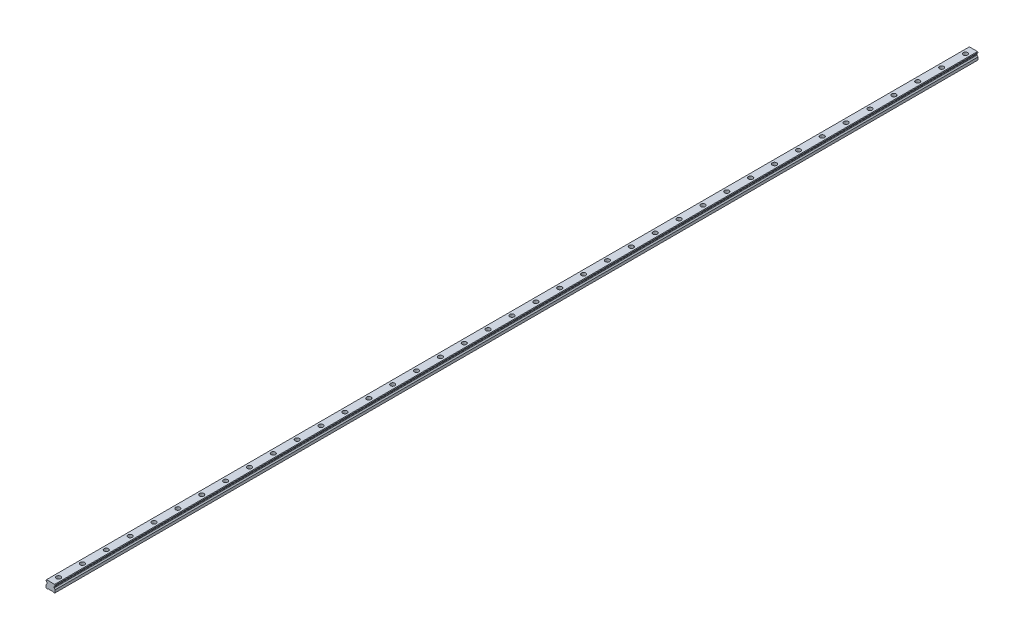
ISO-10303-21;
HEADER;
FILE_DESCRIPTION(('STEP AP214'),'2;1');
FILE_NAME('part.step','',(''),(''),'','','');
FILE_SCHEMA(('AUTOMOTIVE_DESIGN { 1 0 10303 214 1 1 1 1 }'));
ENDSEC;
DATA;
#1=APPLICATION_CONTEXT('core data for automotive mechanical design processes');
#2=APPLICATION_PROTOCOL_DEFINITION('international standard','automotive_design',2000,#1);
#3=PRODUCT_CONTEXT('',#1,'mechanical');
#4=PRODUCT('Part','Part','',(#3));
#5=PRODUCT_RELATED_PRODUCT_CATEGORY('part','',(#4));
#6=PRODUCT_DEFINITION_FORMATION('','',#4);
#7=PRODUCT_DEFINITION_CONTEXT('part definition',#1,'design');
#8=PRODUCT_DEFINITION('design','',#6,#7);
#9=PRODUCT_DEFINITION_SHAPE('','',#8);
#10=(LENGTH_UNIT() NAMED_UNIT(*) SI_UNIT(.MILLI.,.METRE.));
#11=(NAMED_UNIT(*) PLANE_ANGLE_UNIT() SI_UNIT($,.RADIAN.));
#12=(NAMED_UNIT(*) SI_UNIT($,.STERADIAN.) SOLID_ANGLE_UNIT());
#13=UNCERTAINTY_MEASURE_WITH_UNIT(LENGTH_MEASURE(1.E-05),#10,'distance_accuracy_value','');
#14=(GEOMETRIC_REPRESENTATION_CONTEXT(3) GLOBAL_UNCERTAINTY_ASSIGNED_CONTEXT((#13)) GLOBAL_UNIT_ASSIGNED_CONTEXT((#10,
#11,#12)) REPRESENTATION_CONTEXT('',''));
#15=CARTESIAN_POINT('',(0.,0.,0.));
#16=DIRECTION('',(0.,0.,1.));
#17=DIRECTION('',(1.,0.,0.));
#18=AXIS2_PLACEMENT_3D('',#15,#16,#17);
#19=CARTESIAN_POINT('',(0.,10.2,-1140.));
#20=DIRECTION('',(0.,1.,0.));
#21=DIRECTION('',(0.,0.,1.));
#22=AXIS2_PLACEMENT_3D('',#19,#20,#21);
#23=PLANE('',#22);
#24=CARTESIAN_POINT('',(0.,10.2,-1140.));
#25=DIRECTION('',(0.,1.,0.));
#26=DIRECTION('',(0.,0.,1.));
#27=AXIS2_PLACEMENT_3D('',#24,#25,#26);
#28=CIRCLE('',#27,3.49999999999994);
#29=CARTESIAN_POINT('',(0.,10.2,-1136.5));
#30=VERTEX_POINT('',#29);
#31=EDGE_CURVE('E654',#30,#30,#28,.T.);
#32=ORIENTED_EDGE('',*,*,#31,.F.);
#33=EDGE_LOOP('',(#32));
#34=FACE_BOUND('',#33,.T.);
#35=CARTESIAN_POINT('',(0.,10.2,-1140.));
#36=DIRECTION('',(0.,1.,0.));
#37=DIRECTION('',(0.,0.,1.));
#38=AXIS2_PLACEMENT_3D('',#35,#36,#37);
#39=CIRCLE('',#38,5.49999999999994);
#40=CARTESIAN_POINT('',(0.,10.2,-1134.5));
#41=VERTEX_POINT('',#40);
#42=EDGE_CURVE('E11',#41,#41,#39,.T.);
#43=ORIENTED_EDGE('',*,*,#42,.T.);
#44=EDGE_LOOP('',(#43));
#45=FACE_BOUND('',#44,.T.);
#46=ADVANCED_FACE('F39',(#34,#45),#23,.T.);
#47=CARTESIAN_POINT('',(0.,10.2,-1140.));
#48=DIRECTION('',(0.,1.,0.));
#49=DIRECTION('',(0.,0.,1.));
#50=AXIS2_PLACEMENT_3D('',#47,#48,#49);
#51=CYLINDRICAL_SURFACE('',#50,5.49999999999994);
#52=ORIENTED_EDGE('',*,*,#42,.F.);
#53=EDGE_LOOP('',(#52));
#54=FACE_BOUND('',#53,.T.);
#55=CARTESIAN_POINT('',(0.,19.2,-1140.));
#56=DIRECTION('',(0.,1.,0.));
#57=DIRECTION('',(0.,0.,1.));
#58=AXIS2_PLACEMENT_3D('',#55,#56,#57);
#59=CIRCLE('',#58,5.49999999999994);
#60=CARTESIAN_POINT('',(0.,19.2,-1134.5));
#61=VERTEX_POINT('',#60);
#62=EDGE_CURVE('E48',#61,#61,#59,.T.);
#63=ORIENTED_EDGE('',*,*,#62,.T.);
#64=EDGE_LOOP('',(#63));
#65=FACE_BOUND('',#64,.T.);
#66=ADVANCED_FACE('F1196',(#54,#65),#51,.F.);
#67=CARTESIAN_POINT('',(0.,10.2,-1080.));
#68=DIRECTION('',(0.,1.,0.));
#69=DIRECTION('',(0.,0.,1.));
#70=AXIS2_PLACEMENT_3D('',#67,#68,#69);
#71=PLANE('',#70);
#72=CARTESIAN_POINT('',(0.,10.2,-1080.));
#73=DIRECTION('',(0.,1.,0.));
#74=DIRECTION('',(0.,0.,1.));
#75=AXIS2_PLACEMENT_3D('',#72,#73,#74);
#76=CIRCLE('',#75,3.49999999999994);
#77=CARTESIAN_POINT('',(0.,10.2,-1076.5));
#78=VERTEX_POINT('',#77);
#79=EDGE_CURVE('E659',#78,#78,#76,.T.);
#80=ORIENTED_EDGE('',*,*,#79,.F.);
#81=EDGE_LOOP('',(#80));
#82=FACE_BOUND('',#81,.T.);
#83=CARTESIAN_POINT('',(0.,10.2,-1080.));
#84=DIRECTION('',(0.,1.,0.));
#85=DIRECTION('',(0.,0.,1.));
#86=AXIS2_PLACEMENT_3D('',#83,#84,#85);
#87=CIRCLE('',#86,5.49999999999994);
#88=CARTESIAN_POINT('',(0.,10.2,-1074.5));
#89=VERTEX_POINT('',#88);
#90=EDGE_CURVE('E638',#89,#89,#87,.T.);
#91=ORIENTED_EDGE('',*,*,#90,.T.);
#92=EDGE_LOOP('',(#91));
#93=FACE_BOUND('',#92,.T.);
#94=ADVANCED_FACE('F1198',(#82,#93),#71,.T.);
#95=CARTESIAN_POINT('',(0.,10.2,-1080.));
#96=DIRECTION('',(0.,1.,0.));
#97=DIRECTION('',(0.,0.,1.));
#98=AXIS2_PLACEMENT_3D('',#95,#96,#97);
#99=CYLINDRICAL_SURFACE('',#98,5.49999999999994);
#100=ORIENTED_EDGE('',*,*,#90,.F.);
#101=EDGE_LOOP('',(#100));
#102=FACE_BOUND('',#101,.T.);
#103=CARTESIAN_POINT('',(0.,19.2,-1080.));
#104=DIRECTION('',(0.,1.,0.));
#105=DIRECTION('',(0.,0.,1.));
#106=AXIS2_PLACEMENT_3D('',#103,#104,#105);
#107=CIRCLE('',#106,5.49999999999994);
#108=CARTESIAN_POINT('',(0.,19.2,-1074.5));
#109=VERTEX_POINT('',#108);
#110=EDGE_CURVE('E634',#109,#109,#107,.T.);
#111=ORIENTED_EDGE('',*,*,#110,.T.);
#112=EDGE_LOOP('',(#111));
#113=FACE_BOUND('',#112,.T.);
#114=ADVANCED_FACE('F1204',(#102,#113),#99,.F.);
#115=CARTESIAN_POINT('',(0.,10.2,-1020.));
#116=DIRECTION('',(0.,1.,0.));
#117=DIRECTION('',(0.,0.,1.));
#118=AXIS2_PLACEMENT_3D('',#115,#116,#117);
#119=PLANE('',#118);
#120=CARTESIAN_POINT('',(0.,10.2,-1020.));
#121=DIRECTION('',(0.,1.,0.));
#122=DIRECTION('',(0.,0.,1.));
#123=AXIS2_PLACEMENT_3D('',#120,#121,#122);
#124=CIRCLE('',#123,3.49999999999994);
#125=CARTESIAN_POINT('',(0.,10.2,-1016.5));
#126=VERTEX_POINT('',#125);
#127=EDGE_CURVE('E664',#126,#126,#124,.T.);
#128=ORIENTED_EDGE('',*,*,#127,.F.);
#129=EDGE_LOOP('',(#128));
#130=FACE_BOUND('',#129,.T.);
#131=CARTESIAN_POINT('',(0.,10.2,-1020.));
#132=DIRECTION('',(0.,1.,0.));
#133=DIRECTION('',(0.,0.,1.));
#134=AXIS2_PLACEMENT_3D('',#131,#132,#133);
#135=CIRCLE('',#134,5.49999999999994);
#136=CARTESIAN_POINT('',(0.,10.2,-1014.5));
#137=VERTEX_POINT('',#136);
#138=EDGE_CURVE('E630',#137,#137,#135,.T.);
#139=ORIENTED_EDGE('',*,*,#138,.T.);
#140=EDGE_LOOP('',(#139));
#141=FACE_BOUND('',#140,.T.);
#142=ADVANCED_FACE('F1212',(#130,#141),#119,.T.);
#143=CARTESIAN_POINT('',(0.,10.2,-1020.));
#144=DIRECTION('',(0.,1.,0.));
#145=DIRECTION('',(0.,0.,1.));
#146=AXIS2_PLACEMENT_3D('',#143,#144,#145);
#147=CYLINDRICAL_SURFACE('',#146,5.49999999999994);
#148=ORIENTED_EDGE('',*,*,#138,.F.);
#149=EDGE_LOOP('',(#148));
#150=FACE_BOUND('',#149,.T.);
#151=CARTESIAN_POINT('',(0.,19.2,-1020.));
#152=DIRECTION('',(0.,1.,0.));
#153=DIRECTION('',(0.,0.,1.));
#154=AXIS2_PLACEMENT_3D('',#151,#152,#153);
#155=CIRCLE('',#154,5.49999999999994);
#156=CARTESIAN_POINT('',(0.,19.2,-1014.5));
#157=VERTEX_POINT('',#156);
#158=EDGE_CURVE('E626',#157,#157,#155,.T.);
#159=ORIENTED_EDGE('',*,*,#158,.T.);
#160=EDGE_LOOP('',(#159));
#161=FACE_BOUND('',#160,.T.);
#162=ADVANCED_FACE('F1216',(#150,#161),#147,.F.);
#163=CARTESIAN_POINT('',(0.,10.2,-960.));
#164=DIRECTION('',(0.,1.,0.));
#165=DIRECTION('',(0.,0.,1.));
#166=AXIS2_PLACEMENT_3D('',#163,#164,#165);
#167=PLANE('',#166);
#168=CARTESIAN_POINT('',(0.,10.2,-960.));
#169=DIRECTION('',(0.,1.,0.));
#170=DIRECTION('',(0.,0.,1.));
#171=AXIS2_PLACEMENT_3D('',#168,#169,#170);
#172=CIRCLE('',#171,3.49999999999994);
#173=CARTESIAN_POINT('',(0.,10.2,-956.5));
#174=VERTEX_POINT('',#173);
#175=EDGE_CURVE('E669',#174,#174,#172,.T.);
#176=ORIENTED_EDGE('',*,*,#175,.F.);
#177=EDGE_LOOP('',(#176));
#178=FACE_BOUND('',#177,.T.);
#179=CARTESIAN_POINT('',(0.,10.2,-960.));
#180=DIRECTION('',(0.,1.,0.));
#181=DIRECTION('',(0.,0.,1.));
#182=AXIS2_PLACEMENT_3D('',#179,#180,#181);
#183=CIRCLE('',#182,5.49999999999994);
#184=CARTESIAN_POINT('',(0.,10.2,-954.5));
#185=VERTEX_POINT('',#184);
#186=EDGE_CURVE('E622',#185,#185,#183,.T.);
#187=ORIENTED_EDGE('',*,*,#186,.T.);
#188=EDGE_LOOP('',(#187));
#189=FACE_BOUND('',#188,.T.);
#190=ADVANCED_FACE('F1220',(#178,#189),#167,.T.);
#191=CARTESIAN_POINT('',(0.,10.2,-960.));
#192=DIRECTION('',(0.,1.,0.));
#193=DIRECTION('',(0.,0.,1.));
#194=AXIS2_PLACEMENT_3D('',#191,#192,#193);
#195=CYLINDRICAL_SURFACE('',#194,5.49999999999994);
#196=ORIENTED_EDGE('',*,*,#186,.F.);
#197=EDGE_LOOP('',(#196));
#198=FACE_BOUND('',#197,.T.);
#199=CARTESIAN_POINT('',(0.,19.2,-960.));
#200=DIRECTION('',(0.,1.,0.));
#201=DIRECTION('',(0.,0.,1.));
#202=AXIS2_PLACEMENT_3D('',#199,#200,#201);
#203=CIRCLE('',#202,5.49999999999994);
#204=CARTESIAN_POINT('',(0.,19.2,-954.5));
#205=VERTEX_POINT('',#204);
#206=EDGE_CURVE('E618',#205,#205,#203,.T.);
#207=ORIENTED_EDGE('',*,*,#206,.T.);
#208=EDGE_LOOP('',(#207));
#209=FACE_BOUND('',#208,.T.);
#210=ADVANCED_FACE('F1224',(#198,#209),#195,.F.);
#211=CARTESIAN_POINT('',(0.,10.2,-900.));
#212=DIRECTION('',(0.,1.,0.));
#213=DIRECTION('',(0.,0.,1.));
#214=AXIS2_PLACEMENT_3D('',#211,#212,#213);
#215=PLANE('',#214);
#216=CARTESIAN_POINT('',(0.,10.2,-900.));
#217=DIRECTION('',(0.,1.,0.));
#218=DIRECTION('',(0.,0.,1.));
#219=AXIS2_PLACEMENT_3D('',#216,#217,#218);
#220=CIRCLE('',#219,3.49999999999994);
#221=CARTESIAN_POINT('',(0.,10.2,-896.5));
#222=VERTEX_POINT('',#221);
#223=EDGE_CURVE('E674',#222,#222,#220,.T.);
#224=ORIENTED_EDGE('',*,*,#223,.F.);
#225=EDGE_LOOP('',(#224));
#226=FACE_BOUND('',#225,.T.);
#227=CARTESIAN_POINT('',(0.,10.2,-900.));
#228=DIRECTION('',(0.,1.,0.));
#229=DIRECTION('',(0.,0.,1.));
#230=AXIS2_PLACEMENT_3D('',#227,#228,#229);
#231=CIRCLE('',#230,5.49999999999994);
#232=CARTESIAN_POINT('',(0.,10.2,-894.5));
#233=VERTEX_POINT('',#232);
#234=EDGE_CURVE('E614',#233,#233,#231,.T.);
#235=ORIENTED_EDGE('',*,*,#234,.T.);
#236=EDGE_LOOP('',(#235));
#237=FACE_BOUND('',#236,.T.);
#238=ADVANCED_FACE('F1228',(#226,#237),#215,.T.);
#239=CARTESIAN_POINT('',(0.,10.2,-900.));
#240=DIRECTION('',(0.,1.,0.));
#241=DIRECTION('',(0.,0.,1.));
#242=AXIS2_PLACEMENT_3D('',#239,#240,#241);
#243=CYLINDRICAL_SURFACE('',#242,5.49999999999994);
#244=ORIENTED_EDGE('',*,*,#234,.F.);
#245=EDGE_LOOP('',(#244));
#246=FACE_BOUND('',#245,.T.);
#247=CARTESIAN_POINT('',(0.,19.2,-900.));
#248=DIRECTION('',(0.,1.,0.));
#249=DIRECTION('',(0.,0.,1.));
#250=AXIS2_PLACEMENT_3D('',#247,#248,#249);
#251=CIRCLE('',#250,5.49999999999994);
#252=CARTESIAN_POINT('',(0.,19.2,-894.5));
#253=VERTEX_POINT('',#252);
#254=EDGE_CURVE('E610',#253,#253,#251,.T.);
#255=ORIENTED_EDGE('',*,*,#254,.T.);
#256=EDGE_LOOP('',(#255));
#257=FACE_BOUND('',#256,.T.);
#258=ADVANCED_FACE('F1232',(#246,#257),#243,.F.);
#259=CARTESIAN_POINT('',(0.,10.2,-840.));
#260=DIRECTION('',(0.,1.,0.));
#261=DIRECTION('',(0.,0.,1.));
#262=AXIS2_PLACEMENT_3D('',#259,#260,#261);
#263=PLANE('',#262);
#264=CARTESIAN_POINT('',(0.,10.2,-840.));
#265=DIRECTION('',(0.,1.,0.));
#266=DIRECTION('',(0.,0.,1.));
#267=AXIS2_PLACEMENT_3D('',#264,#265,#266);
#268=CIRCLE('',#267,3.49999999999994);
#269=CARTESIAN_POINT('',(0.,10.2,-836.5));
#270=VERTEX_POINT('',#269);
#271=EDGE_CURVE('E679',#270,#270,#268,.T.);
#272=ORIENTED_EDGE('',*,*,#271,.F.);
#273=EDGE_LOOP('',(#272));
#274=FACE_BOUND('',#273,.T.);
#275=CARTESIAN_POINT('',(0.,10.2,-840.));
#276=DIRECTION('',(0.,1.,0.));
#277=DIRECTION('',(0.,0.,1.));
#278=AXIS2_PLACEMENT_3D('',#275,#276,#277);
#279=CIRCLE('',#278,5.49999999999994);
#280=CARTESIAN_POINT('',(0.,10.2,-834.5));
#281=VERTEX_POINT('',#280);
#282=EDGE_CURVE('E606',#281,#281,#279,.T.);
#283=ORIENTED_EDGE('',*,*,#282,.T.);
#284=EDGE_LOOP('',(#283));
#285=FACE_BOUND('',#284,.T.);
#286=ADVANCED_FACE('F1236',(#274,#285),#263,.T.);
#287=CARTESIAN_POINT('',(0.,10.2,-840.));
#288=DIRECTION('',(0.,1.,0.));
#289=DIRECTION('',(0.,0.,1.));
#290=AXIS2_PLACEMENT_3D('',#287,#288,#289);
#291=CYLINDRICAL_SURFACE('',#290,5.49999999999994);
#292=ORIENTED_EDGE('',*,*,#282,.F.);
#293=EDGE_LOOP('',(#292));
#294=FACE_BOUND('',#293,.T.);
#295=CARTESIAN_POINT('',(0.,19.2,-840.));
#296=DIRECTION('',(0.,1.,0.));
#297=DIRECTION('',(0.,0.,1.));
#298=AXIS2_PLACEMENT_3D('',#295,#296,#297);
#299=CIRCLE('',#298,5.49999999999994);
#300=CARTESIAN_POINT('',(0.,19.2,-834.5));
#301=VERTEX_POINT('',#300);
#302=EDGE_CURVE('E602',#301,#301,#299,.T.);
#303=ORIENTED_EDGE('',*,*,#302,.T.);
#304=EDGE_LOOP('',(#303));
#305=FACE_BOUND('',#304,.T.);
#306=ADVANCED_FACE('F1240',(#294,#305),#291,.F.);
#307=CARTESIAN_POINT('',(0.,10.2,-780.));
#308=DIRECTION('',(0.,1.,0.));
#309=DIRECTION('',(0.,0.,1.));
#310=AXIS2_PLACEMENT_3D('',#307,#308,#309);
#311=PLANE('',#310);
#312=CARTESIAN_POINT('',(0.,10.2,-780.));
#313=DIRECTION('',(0.,1.,0.));
#314=DIRECTION('',(0.,0.,1.));
#315=AXIS2_PLACEMENT_3D('',#312,#313,#314);
#316=CIRCLE('',#315,3.49999999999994);
#317=CARTESIAN_POINT('',(0.,10.2,-776.5));
#318=VERTEX_POINT('',#317);
#319=EDGE_CURVE('E684',#318,#318,#316,.T.);
#320=ORIENTED_EDGE('',*,*,#319,.F.);
#321=EDGE_LOOP('',(#320));
#322=FACE_BOUND('',#321,.T.);
#323=CARTESIAN_POINT('',(0.,10.2,-780.));
#324=DIRECTION('',(0.,1.,0.));
#325=DIRECTION('',(0.,0.,1.));
#326=AXIS2_PLACEMENT_3D('',#323,#324,#325);
#327=CIRCLE('',#326,5.49999999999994);
#328=CARTESIAN_POINT('',(0.,10.2,-774.5));
#329=VERTEX_POINT('',#328);
#330=EDGE_CURVE('E598',#329,#329,#327,.T.);
#331=ORIENTED_EDGE('',*,*,#330,.T.);
#332=EDGE_LOOP('',(#331));
#333=FACE_BOUND('',#332,.T.);
#334=ADVANCED_FACE('F1244',(#322,#333),#311,.T.);
#335=CARTESIAN_POINT('',(0.,10.2,-780.));
#336=DIRECTION('',(0.,1.,0.));
#337=DIRECTION('',(0.,0.,1.));
#338=AXIS2_PLACEMENT_3D('',#335,#336,#337);
#339=CYLINDRICAL_SURFACE('',#338,5.49999999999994);
#340=ORIENTED_EDGE('',*,*,#330,.F.);
#341=EDGE_LOOP('',(#340));
#342=FACE_BOUND('',#341,.T.);
#343=CARTESIAN_POINT('',(0.,19.2,-780.));
#344=DIRECTION('',(0.,1.,0.));
#345=DIRECTION('',(0.,0.,1.));
#346=AXIS2_PLACEMENT_3D('',#343,#344,#345);
#347=CIRCLE('',#346,5.49999999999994);
#348=CARTESIAN_POINT('',(0.,19.2,-774.5));
#349=VERTEX_POINT('',#348);
#350=EDGE_CURVE('E594',#349,#349,#347,.T.);
#351=ORIENTED_EDGE('',*,*,#350,.T.);
#352=EDGE_LOOP('',(#351));
#353=FACE_BOUND('',#352,.T.);
#354=ADVANCED_FACE('F1248',(#342,#353),#339,.F.);
#355=CARTESIAN_POINT('',(0.,10.2,-720.));
#356=DIRECTION('',(0.,1.,0.));
#357=DIRECTION('',(0.,0.,1.));
#358=AXIS2_PLACEMENT_3D('',#355,#356,#357);
#359=PLANE('',#358);
#360=CARTESIAN_POINT('',(0.,10.2,-720.));
#361=DIRECTION('',(0.,1.,0.));
#362=DIRECTION('',(0.,0.,1.));
#363=AXIS2_PLACEMENT_3D('',#360,#361,#362);
#364=CIRCLE('',#363,3.49999999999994);
#365=CARTESIAN_POINT('',(0.,10.2,-716.5));
#366=VERTEX_POINT('',#365);
#367=EDGE_CURVE('E689',#366,#366,#364,.T.);
#368=ORIENTED_EDGE('',*,*,#367,.F.);
#369=EDGE_LOOP('',(#368));
#370=FACE_BOUND('',#369,.T.);
#371=CARTESIAN_POINT('',(0.,10.2,-720.));
#372=DIRECTION('',(0.,1.,0.));
#373=DIRECTION('',(0.,0.,1.));
#374=AXIS2_PLACEMENT_3D('',#371,#372,#373);
#375=CIRCLE('',#374,5.49999999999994);
#376=CARTESIAN_POINT('',(0.,10.2,-714.5));
#377=VERTEX_POINT('',#376);
#378=EDGE_CURVE('E590',#377,#377,#375,.T.);
#379=ORIENTED_EDGE('',*,*,#378,.T.);
#380=EDGE_LOOP('',(#379));
#381=FACE_BOUND('',#380,.T.);
#382=ADVANCED_FACE('F1252',(#370,#381),#359,.T.);
#383=CARTESIAN_POINT('',(0.,10.2,-720.));
#384=DIRECTION('',(0.,1.,0.));
#385=DIRECTION('',(0.,0.,1.));
#386=AXIS2_PLACEMENT_3D('',#383,#384,#385);
#387=CYLINDRICAL_SURFACE('',#386,5.49999999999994);
#388=ORIENTED_EDGE('',*,*,#378,.F.);
#389=EDGE_LOOP('',(#388));
#390=FACE_BOUND('',#389,.T.);
#391=CARTESIAN_POINT('',(0.,19.2,-720.));
#392=DIRECTION('',(0.,1.,0.));
#393=DIRECTION('',(0.,0.,1.));
#394=AXIS2_PLACEMENT_3D('',#391,#392,#393);
#395=CIRCLE('',#394,5.49999999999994);
#396=CARTESIAN_POINT('',(0.,19.2,-714.5));
#397=VERTEX_POINT('',#396);
#398=EDGE_CURVE('E586',#397,#397,#395,.T.);
#399=ORIENTED_EDGE('',*,*,#398,.T.);
#400=EDGE_LOOP('',(#399));
#401=FACE_BOUND('',#400,.T.);
#402=ADVANCED_FACE('F1256',(#390,#401),#387,.F.);
#403=CARTESIAN_POINT('',(0.,10.2,-660.));
#404=DIRECTION('',(0.,1.,0.));
#405=DIRECTION('',(0.,0.,1.));
#406=AXIS2_PLACEMENT_3D('',#403,#404,#405);
#407=PLANE('',#406);
#408=CARTESIAN_POINT('',(0.,10.2,-660.));
#409=DIRECTION('',(0.,1.,0.));
#410=DIRECTION('',(0.,0.,1.));
#411=AXIS2_PLACEMENT_3D('',#408,#409,#410);
#412=CIRCLE('',#411,3.49999999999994);
#413=CARTESIAN_POINT('',(0.,10.2,-656.5));
#414=VERTEX_POINT('',#413);
#415=EDGE_CURVE('E694',#414,#414,#412,.T.);
#416=ORIENTED_EDGE('',*,*,#415,.F.);
#417=EDGE_LOOP('',(#416));
#418=FACE_BOUND('',#417,.T.);
#419=CARTESIAN_POINT('',(0.,10.2,-660.));
#420=DIRECTION('',(0.,1.,0.));
#421=DIRECTION('',(0.,0.,1.));
#422=AXIS2_PLACEMENT_3D('',#419,#420,#421);
#423=CIRCLE('',#422,5.49999999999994);
#424=CARTESIAN_POINT('',(0.,10.2,-654.5));
#425=VERTEX_POINT('',#424);
#426=EDGE_CURVE('E582',#425,#425,#423,.T.);
#427=ORIENTED_EDGE('',*,*,#426,.T.);
#428=EDGE_LOOP('',(#427));
#429=FACE_BOUND('',#428,.T.);
#430=ADVANCED_FACE('F1260',(#418,#429),#407,.T.);
#431=CARTESIAN_POINT('',(0.,10.2,-660.));
#432=DIRECTION('',(0.,1.,0.));
#433=DIRECTION('',(0.,0.,1.));
#434=AXIS2_PLACEMENT_3D('',#431,#432,#433);
#435=CYLINDRICAL_SURFACE('',#434,5.49999999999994);
#436=ORIENTED_EDGE('',*,*,#426,.F.);
#437=EDGE_LOOP('',(#436));
#438=FACE_BOUND('',#437,.T.);
#439=CARTESIAN_POINT('',(0.,19.2,-660.));
#440=DIRECTION('',(0.,1.,0.));
#441=DIRECTION('',(0.,0.,1.));
#442=AXIS2_PLACEMENT_3D('',#439,#440,#441);
#443=CIRCLE('',#442,5.49999999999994);
#444=CARTESIAN_POINT('',(0.,19.2,-654.5));
#445=VERTEX_POINT('',#444);
#446=EDGE_CURVE('E578',#445,#445,#443,.T.);
#447=ORIENTED_EDGE('',*,*,#446,.T.);
#448=EDGE_LOOP('',(#447));
#449=FACE_BOUND('',#448,.T.);
#450=ADVANCED_FACE('F1264',(#438,#449),#435,.F.);
#451=CARTESIAN_POINT('',(0.,10.2,-600.));
#452=DIRECTION('',(0.,1.,0.));
#453=DIRECTION('',(0.,0.,1.));
#454=AXIS2_PLACEMENT_3D('',#451,#452,#453);
#455=PLANE('',#454);
#456=CARTESIAN_POINT('',(0.,10.2,-600.));
#457=DIRECTION('',(0.,1.,0.));
#458=DIRECTION('',(0.,0.,1.));
#459=AXIS2_PLACEMENT_3D('',#456,#457,#458);
#460=CIRCLE('',#459,3.49999999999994);
#461=CARTESIAN_POINT('',(0.,10.2,-596.5));
#462=VERTEX_POINT('',#461);
#463=EDGE_CURVE('E699',#462,#462,#460,.T.);
#464=ORIENTED_EDGE('',*,*,#463,.F.);
#465=EDGE_LOOP('',(#464));
#466=FACE_BOUND('',#465,.T.);
#467=CARTESIAN_POINT('',(0.,10.2,-600.));
#468=DIRECTION('',(0.,1.,0.));
#469=DIRECTION('',(0.,0.,1.));
#470=AXIS2_PLACEMENT_3D('',#467,#468,#469);
#471=CIRCLE('',#470,5.49999999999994);
#472=CARTESIAN_POINT('',(0.,10.2,-594.5));
#473=VERTEX_POINT('',#472);
#474=EDGE_CURVE('E574',#473,#473,#471,.T.);
#475=ORIENTED_EDGE('',*,*,#474,.T.);
#476=EDGE_LOOP('',(#475));
#477=FACE_BOUND('',#476,.T.);
#478=ADVANCED_FACE('F1268',(#466,#477),#455,.T.);
#479=CARTESIAN_POINT('',(0.,10.2,-600.));
#480=DIRECTION('',(0.,1.,0.));
#481=DIRECTION('',(0.,0.,1.));
#482=AXIS2_PLACEMENT_3D('',#479,#480,#481);
#483=CYLINDRICAL_SURFACE('',#482,5.49999999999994);
#484=ORIENTED_EDGE('',*,*,#474,.F.);
#485=EDGE_LOOP('',(#484));
#486=FACE_BOUND('',#485,.T.);
#487=CARTESIAN_POINT('',(0.,19.2,-600.));
#488=DIRECTION('',(0.,1.,0.));
#489=DIRECTION('',(0.,0.,1.));
#490=AXIS2_PLACEMENT_3D('',#487,#488,#489);
#491=CIRCLE('',#490,5.49999999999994);
#492=CARTESIAN_POINT('',(0.,19.2,-594.5));
#493=VERTEX_POINT('',#492);
#494=EDGE_CURVE('E570',#493,#493,#491,.T.);
#495=ORIENTED_EDGE('',*,*,#494,.T.);
#496=EDGE_LOOP('',(#495));
#497=FACE_BOUND('',#496,.T.);
#498=ADVANCED_FACE('F1272',(#486,#497),#483,.F.);
#499=CARTESIAN_POINT('',(0.,10.2,-540.));
#500=DIRECTION('',(0.,1.,0.));
#501=DIRECTION('',(0.,0.,1.));
#502=AXIS2_PLACEMENT_3D('',#499,#500,#501);
#503=PLANE('',#502);
#504=CARTESIAN_POINT('',(0.,10.2,-540.));
#505=DIRECTION('',(0.,1.,0.));
#506=DIRECTION('',(0.,0.,1.));
#507=AXIS2_PLACEMENT_3D('',#504,#505,#506);
#508=CIRCLE('',#507,3.49999999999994);
#509=CARTESIAN_POINT('',(0.,10.2,-536.5));
#510=VERTEX_POINT('',#509);
#511=EDGE_CURVE('E704',#510,#510,#508,.T.);
#512=ORIENTED_EDGE('',*,*,#511,.F.);
#513=EDGE_LOOP('',(#512));
#514=FACE_BOUND('',#513,.T.);
#515=CARTESIAN_POINT('',(0.,10.2,-540.));
#516=DIRECTION('',(0.,1.,0.));
#517=DIRECTION('',(0.,0.,1.));
#518=AXIS2_PLACEMENT_3D('',#515,#516,#517);
#519=CIRCLE('',#518,5.49999999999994);
#520=CARTESIAN_POINT('',(0.,10.2,-534.5));
#521=VERTEX_POINT('',#520);
#522=EDGE_CURVE('E566',#521,#521,#519,.T.);
#523=ORIENTED_EDGE('',*,*,#522,.T.);
#524=EDGE_LOOP('',(#523));
#525=FACE_BOUND('',#524,.T.);
#526=ADVANCED_FACE('F1276',(#514,#525),#503,.T.);
#527=CARTESIAN_POINT('',(0.,10.2,-540.));
#528=DIRECTION('',(0.,1.,0.));
#529=DIRECTION('',(0.,0.,1.));
#530=AXIS2_PLACEMENT_3D('',#527,#528,#529);
#531=CYLINDRICAL_SURFACE('',#530,5.49999999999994);
#532=ORIENTED_EDGE('',*,*,#522,.F.);
#533=EDGE_LOOP('',(#532));
#534=FACE_BOUND('',#533,.T.);
#535=CARTESIAN_POINT('',(0.,19.2,-540.));
#536=DIRECTION('',(0.,1.,0.));
#537=DIRECTION('',(0.,0.,1.));
#538=AXIS2_PLACEMENT_3D('',#535,#536,#537);
#539=CIRCLE('',#538,5.49999999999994);
#540=CARTESIAN_POINT('',(0.,19.2,-534.5));
#541=VERTEX_POINT('',#540);
#542=EDGE_CURVE('E562',#541,#541,#539,.T.);
#543=ORIENTED_EDGE('',*,*,#542,.T.);
#544=EDGE_LOOP('',(#543));
#545=FACE_BOUND('',#544,.T.);
#546=ADVANCED_FACE('F1280',(#534,#545),#531,.F.);
#547=CARTESIAN_POINT('',(0.,10.2,-480.));
#548=DIRECTION('',(0.,1.,0.));
#549=DIRECTION('',(0.,0.,1.));
#550=AXIS2_PLACEMENT_3D('',#547,#548,#549);
#551=PLANE('',#550);
#552=CARTESIAN_POINT('',(0.,10.2,-480.));
#553=DIRECTION('',(0.,1.,0.));
#554=DIRECTION('',(0.,0.,1.));
#555=AXIS2_PLACEMENT_3D('',#552,#553,#554);
#556=CIRCLE('',#555,3.49999999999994);
#557=CARTESIAN_POINT('',(0.,10.2,-476.5));
#558=VERTEX_POINT('',#557);
#559=EDGE_CURVE('E709',#558,#558,#556,.T.);
#560=ORIENTED_EDGE('',*,*,#559,.F.);
#561=EDGE_LOOP('',(#560));
#562=FACE_BOUND('',#561,.T.);
#563=CARTESIAN_POINT('',(0.,10.2,-480.));
#564=DIRECTION('',(0.,1.,0.));
#565=DIRECTION('',(0.,0.,1.));
#566=AXIS2_PLACEMENT_3D('',#563,#564,#565);
#567=CIRCLE('',#566,5.49999999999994);
#568=CARTESIAN_POINT('',(0.,10.2,-474.5));
#569=VERTEX_POINT('',#568);
#570=EDGE_CURVE('E558',#569,#569,#567,.T.);
#571=ORIENTED_EDGE('',*,*,#570,.T.);
#572=EDGE_LOOP('',(#571));
#573=FACE_BOUND('',#572,.T.);
#574=ADVANCED_FACE('F1284',(#562,#573),#551,.T.);
#575=CARTESIAN_POINT('',(0.,10.2,-480.));
#576=DIRECTION('',(0.,1.,0.));
#577=DIRECTION('',(0.,0.,1.));
#578=AXIS2_PLACEMENT_3D('',#575,#576,#577);
#579=CYLINDRICAL_SURFACE('',#578,5.49999999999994);
#580=ORIENTED_EDGE('',*,*,#570,.F.);
#581=EDGE_LOOP('',(#580));
#582=FACE_BOUND('',#581,.T.);
#583=CARTESIAN_POINT('',(0.,19.2,-480.));
#584=DIRECTION('',(0.,1.,0.));
#585=DIRECTION('',(0.,0.,1.));
#586=AXIS2_PLACEMENT_3D('',#583,#584,#585);
#587=CIRCLE('',#586,5.49999999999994);
#588=CARTESIAN_POINT('',(0.,19.2,-474.5));
#589=VERTEX_POINT('',#588);
#590=EDGE_CURVE('E554',#589,#589,#587,.T.);
#591=ORIENTED_EDGE('',*,*,#590,.T.);
#592=EDGE_LOOP('',(#591));
#593=FACE_BOUND('',#592,.T.);
#594=ADVANCED_FACE('F1288',(#582,#593),#579,.F.);
#595=CARTESIAN_POINT('',(0.,10.2,-420.));
#596=DIRECTION('',(0.,1.,0.));
#597=DIRECTION('',(0.,0.,1.));
#598=AXIS2_PLACEMENT_3D('',#595,#596,#597);
#599=PLANE('',#598);
#600=CARTESIAN_POINT('',(0.,10.2,-420.));
#601=DIRECTION('',(0.,1.,0.));
#602=DIRECTION('',(0.,0.,1.));
#603=AXIS2_PLACEMENT_3D('',#600,#601,#602);
#604=CIRCLE('',#603,3.49999999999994);
#605=CARTESIAN_POINT('',(0.,10.2,-416.5));
#606=VERTEX_POINT('',#605);
#607=EDGE_CURVE('E714',#606,#606,#604,.T.);
#608=ORIENTED_EDGE('',*,*,#607,.F.);
#609=EDGE_LOOP('',(#608));
#610=FACE_BOUND('',#609,.T.);
#611=CARTESIAN_POINT('',(0.,10.2,-420.));
#612=DIRECTION('',(0.,1.,0.));
#613=DIRECTION('',(0.,0.,1.));
#614=AXIS2_PLACEMENT_3D('',#611,#612,#613);
#615=CIRCLE('',#614,5.49999999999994);
#616=CARTESIAN_POINT('',(0.,10.2,-414.5));
#617=VERTEX_POINT('',#616);
#618=EDGE_CURVE('E550',#617,#617,#615,.T.);
#619=ORIENTED_EDGE('',*,*,#618,.T.);
#620=EDGE_LOOP('',(#619));
#621=FACE_BOUND('',#620,.T.);
#622=ADVANCED_FACE('F1292',(#610,#621),#599,.T.);
#623=CARTESIAN_POINT('',(0.,10.2,-420.));
#624=DIRECTION('',(0.,1.,0.));
#625=DIRECTION('',(0.,0.,1.));
#626=AXIS2_PLACEMENT_3D('',#623,#624,#625);
#627=CYLINDRICAL_SURFACE('',#626,5.49999999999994);
#628=ORIENTED_EDGE('',*,*,#618,.F.);
#629=EDGE_LOOP('',(#628));
#630=FACE_BOUND('',#629,.T.);
#631=CARTESIAN_POINT('',(0.,19.2,-420.));
#632=DIRECTION('',(0.,1.,0.));
#633=DIRECTION('',(0.,0.,1.));
#634=AXIS2_PLACEMENT_3D('',#631,#632,#633);
#635=CIRCLE('',#634,5.49999999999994);
#636=CARTESIAN_POINT('',(0.,19.2,-414.5));
#637=VERTEX_POINT('',#636);
#638=EDGE_CURVE('E546',#637,#637,#635,.T.);
#639=ORIENTED_EDGE('',*,*,#638,.T.);
#640=EDGE_LOOP('',(#639));
#641=FACE_BOUND('',#640,.T.);
#642=ADVANCED_FACE('F1296',(#630,#641),#627,.F.);
#643=CARTESIAN_POINT('',(0.,10.2,-360.));
#644=DIRECTION('',(0.,1.,0.));
#645=DIRECTION('',(0.,0.,1.));
#646=AXIS2_PLACEMENT_3D('',#643,#644,#645);
#647=PLANE('',#646);
#648=CARTESIAN_POINT('',(0.,10.2,-360.));
#649=DIRECTION('',(0.,1.,0.));
#650=DIRECTION('',(0.,0.,1.));
#651=AXIS2_PLACEMENT_3D('',#648,#649,#650);
#652=CIRCLE('',#651,3.49999999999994);
#653=CARTESIAN_POINT('',(0.,10.2,-356.5));
#654=VERTEX_POINT('',#653);
#655=EDGE_CURVE('E719',#654,#654,#652,.T.);
#656=ORIENTED_EDGE('',*,*,#655,.F.);
#657=EDGE_LOOP('',(#656));
#658=FACE_BOUND('',#657,.T.);
#659=CARTESIAN_POINT('',(0.,10.2,-360.));
#660=DIRECTION('',(0.,1.,0.));
#661=DIRECTION('',(0.,0.,1.));
#662=AXIS2_PLACEMENT_3D('',#659,#660,#661);
#663=CIRCLE('',#662,5.49999999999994);
#664=CARTESIAN_POINT('',(0.,10.2,-354.5));
#665=VERTEX_POINT('',#664);
#666=EDGE_CURVE('E542',#665,#665,#663,.T.);
#667=ORIENTED_EDGE('',*,*,#666,.T.);
#668=EDGE_LOOP('',(#667));
#669=FACE_BOUND('',#668,.T.);
#670=ADVANCED_FACE('F1300',(#658,#669),#647,.T.);
#671=CARTESIAN_POINT('',(0.,10.2,-360.));
#672=DIRECTION('',(0.,1.,0.));
#673=DIRECTION('',(0.,0.,1.));
#674=AXIS2_PLACEMENT_3D('',#671,#672,#673);
#675=CYLINDRICAL_SURFACE('',#674,5.49999999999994);
#676=ORIENTED_EDGE('',*,*,#666,.F.);
#677=EDGE_LOOP('',(#676));
#678=FACE_BOUND('',#677,.T.);
#679=CARTESIAN_POINT('',(0.,19.2,-360.));
#680=DIRECTION('',(0.,1.,0.));
#681=DIRECTION('',(0.,0.,1.));
#682=AXIS2_PLACEMENT_3D('',#679,#680,#681);
#683=CIRCLE('',#682,5.49999999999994);
#684=CARTESIAN_POINT('',(0.,19.2,-354.5));
#685=VERTEX_POINT('',#684);
#686=EDGE_CURVE('E538',#685,#685,#683,.T.);
#687=ORIENTED_EDGE('',*,*,#686,.T.);
#688=EDGE_LOOP('',(#687));
#689=FACE_BOUND('',#688,.T.);
#690=ADVANCED_FACE('F1304',(#678,#689),#675,.F.);
#691=CARTESIAN_POINT('',(0.,10.2,-300.));
#692=DIRECTION('',(0.,1.,0.));
#693=DIRECTION('',(0.,0.,1.));
#694=AXIS2_PLACEMENT_3D('',#691,#692,#693);
#695=PLANE('',#694);
#696=CARTESIAN_POINT('',(0.,10.2,-300.));
#697=DIRECTION('',(0.,1.,0.));
#698=DIRECTION('',(0.,0.,1.));
#699=AXIS2_PLACEMENT_3D('',#696,#697,#698);
#700=CIRCLE('',#699,3.49999999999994);
#701=CARTESIAN_POINT('',(0.,10.2,-296.5));
#702=VERTEX_POINT('',#701);
#703=EDGE_CURVE('E724',#702,#702,#700,.T.);
#704=ORIENTED_EDGE('',*,*,#703,.F.);
#705=EDGE_LOOP('',(#704));
#706=FACE_BOUND('',#705,.T.);
#707=CARTESIAN_POINT('',(0.,10.2,-300.));
#708=DIRECTION('',(0.,1.,0.));
#709=DIRECTION('',(0.,0.,1.));
#710=AXIS2_PLACEMENT_3D('',#707,#708,#709);
#711=CIRCLE('',#710,5.49999999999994);
#712=CARTESIAN_POINT('',(0.,10.2,-294.5));
#713=VERTEX_POINT('',#712);
#714=EDGE_CURVE('E534',#713,#713,#711,.T.);
#715=ORIENTED_EDGE('',*,*,#714,.T.);
#716=EDGE_LOOP('',(#715));
#717=FACE_BOUND('',#716,.T.);
#718=ADVANCED_FACE('F1308',(#706,#717),#695,.T.);
#719=CARTESIAN_POINT('',(0.,10.2,-300.));
#720=DIRECTION('',(0.,1.,0.));
#721=DIRECTION('',(0.,0.,1.));
#722=AXIS2_PLACEMENT_3D('',#719,#720,#721);
#723=CYLINDRICAL_SURFACE('',#722,5.49999999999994);
#724=ORIENTED_EDGE('',*,*,#714,.F.);
#725=EDGE_LOOP('',(#724));
#726=FACE_BOUND('',#725,.T.);
#727=CARTESIAN_POINT('',(0.,19.2,-300.));
#728=DIRECTION('',(0.,1.,0.));
#729=DIRECTION('',(0.,0.,1.));
#730=AXIS2_PLACEMENT_3D('',#727,#728,#729);
#731=CIRCLE('',#730,5.49999999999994);
#732=CARTESIAN_POINT('',(0.,19.2,-294.5));
#733=VERTEX_POINT('',#732);
#734=EDGE_CURVE('E530',#733,#733,#731,.T.);
#735=ORIENTED_EDGE('',*,*,#734,.T.);
#736=EDGE_LOOP('',(#735));
#737=FACE_BOUND('',#736,.T.);
#738=ADVANCED_FACE('F1312',(#726,#737),#723,.F.);
#739=CARTESIAN_POINT('',(0.,10.2,-240.));
#740=DIRECTION('',(0.,1.,0.));
#741=DIRECTION('',(0.,0.,1.));
#742=AXIS2_PLACEMENT_3D('',#739,#740,#741);
#743=PLANE('',#742);
#744=CARTESIAN_POINT('',(0.,10.2,-240.));
#745=DIRECTION('',(0.,1.,0.));
#746=DIRECTION('',(0.,0.,1.));
#747=AXIS2_PLACEMENT_3D('',#744,#745,#746);
#748=CIRCLE('',#747,3.49999999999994);
#749=CARTESIAN_POINT('',(0.,10.2,-236.5));
#750=VERTEX_POINT('',#749);
#751=EDGE_CURVE('E729',#750,#750,#748,.T.);
#752=ORIENTED_EDGE('',*,*,#751,.F.);
#753=EDGE_LOOP('',(#752));
#754=FACE_BOUND('',#753,.T.);
#755=CARTESIAN_POINT('',(0.,10.2,-240.));
#756=DIRECTION('',(0.,1.,0.));
#757=DIRECTION('',(0.,0.,1.));
#758=AXIS2_PLACEMENT_3D('',#755,#756,#757);
#759=CIRCLE('',#758,5.49999999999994);
#760=CARTESIAN_POINT('',(0.,10.2,-234.5));
#761=VERTEX_POINT('',#760);
#762=EDGE_CURVE('E526',#761,#761,#759,.T.);
#763=ORIENTED_EDGE('',*,*,#762,.T.);
#764=EDGE_LOOP('',(#763));
#765=FACE_BOUND('',#764,.T.);
#766=ADVANCED_FACE('F1316',(#754,#765),#743,.T.);
#767=CARTESIAN_POINT('',(0.,10.2,-240.));
#768=DIRECTION('',(0.,1.,0.));
#769=DIRECTION('',(0.,0.,1.));
#770=AXIS2_PLACEMENT_3D('',#767,#768,#769);
#771=CYLINDRICAL_SURFACE('',#770,5.49999999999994);
#772=ORIENTED_EDGE('',*,*,#762,.F.);
#773=EDGE_LOOP('',(#772));
#774=FACE_BOUND('',#773,.T.);
#775=CARTESIAN_POINT('',(0.,19.2,-240.));
#776=DIRECTION('',(0.,1.,0.));
#777=DIRECTION('',(0.,0.,1.));
#778=AXIS2_PLACEMENT_3D('',#775,#776,#777);
#779=CIRCLE('',#778,5.49999999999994);
#780=CARTESIAN_POINT('',(0.,19.2,-234.5));
#781=VERTEX_POINT('',#780);
#782=EDGE_CURVE('E522',#781,#781,#779,.T.);
#783=ORIENTED_EDGE('',*,*,#782,.T.);
#784=EDGE_LOOP('',(#783));
#785=FACE_BOUND('',#784,.T.);
#786=ADVANCED_FACE('F1320',(#774,#785),#771,.F.);
#787=CARTESIAN_POINT('',(0.,10.2,-180.));
#788=DIRECTION('',(0.,1.,0.));
#789=DIRECTION('',(0.,0.,1.));
#790=AXIS2_PLACEMENT_3D('',#787,#788,#789);
#791=PLANE('',#790);
#792=CARTESIAN_POINT('',(0.,10.2,-180.));
#793=DIRECTION('',(0.,1.,0.));
#794=DIRECTION('',(0.,0.,1.));
#795=AXIS2_PLACEMENT_3D('',#792,#793,#794);
#796=CIRCLE('',#795,3.49999999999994);
#797=CARTESIAN_POINT('',(0.,10.2,-176.5));
#798=VERTEX_POINT('',#797);
#799=EDGE_CURVE('E734',#798,#798,#796,.T.);
#800=ORIENTED_EDGE('',*,*,#799,.F.);
#801=EDGE_LOOP('',(#800));
#802=FACE_BOUND('',#801,.T.);
#803=CARTESIAN_POINT('',(0.,10.2,-180.));
#804=DIRECTION('',(0.,1.,0.));
#805=DIRECTION('',(0.,0.,1.));
#806=AXIS2_PLACEMENT_3D('',#803,#804,#805);
#807=CIRCLE('',#806,5.49999999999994);
#808=CARTESIAN_POINT('',(0.,10.2,-174.5));
#809=VERTEX_POINT('',#808);
#810=EDGE_CURVE('E518',#809,#809,#807,.T.);
#811=ORIENTED_EDGE('',*,*,#810,.T.);
#812=EDGE_LOOP('',(#811));
#813=FACE_BOUND('',#812,.T.);
#814=ADVANCED_FACE('F1324',(#802,#813),#791,.T.);
#815=CARTESIAN_POINT('',(0.,10.2,-180.));
#816=DIRECTION('',(0.,1.,0.));
#817=DIRECTION('',(0.,0.,1.));
#818=AXIS2_PLACEMENT_3D('',#815,#816,#817);
#819=CYLINDRICAL_SURFACE('',#818,5.49999999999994);
#820=ORIENTED_EDGE('',*,*,#810,.F.);
#821=EDGE_LOOP('',(#820));
#822=FACE_BOUND('',#821,.T.);
#823=CARTESIAN_POINT('',(0.,19.2,-180.));
#824=DIRECTION('',(0.,1.,0.));
#825=DIRECTION('',(0.,0.,1.));
#826=AXIS2_PLACEMENT_3D('',#823,#824,#825);
#827=CIRCLE('',#826,5.49999999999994);
#828=CARTESIAN_POINT('',(0.,19.2,-174.5));
#829=VERTEX_POINT('',#828);
#830=EDGE_CURVE('E514',#829,#829,#827,.T.);
#831=ORIENTED_EDGE('',*,*,#830,.T.);
#832=EDGE_LOOP('',(#831));
#833=FACE_BOUND('',#832,.T.);
#834=ADVANCED_FACE('F1328',(#822,#833),#819,.F.);
#835=CARTESIAN_POINT('',(0.,10.2,-120.));
#836=DIRECTION('',(0.,1.,0.));
#837=DIRECTION('',(0.,0.,1.));
#838=AXIS2_PLACEMENT_3D('',#835,#836,#837);
#839=PLANE('',#838);
#840=CARTESIAN_POINT('',(0.,10.2,-120.));
#841=DIRECTION('',(0.,1.,0.));
#842=DIRECTION('',(0.,0.,1.));
#843=AXIS2_PLACEMENT_3D('',#840,#841,#842);
#844=CIRCLE('',#843,3.49999999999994);
#845=CARTESIAN_POINT('',(0.,10.2,-116.5));
#846=VERTEX_POINT('',#845);
#847=EDGE_CURVE('E739',#846,#846,#844,.T.);
#848=ORIENTED_EDGE('',*,*,#847,.F.);
#849=EDGE_LOOP('',(#848));
#850=FACE_BOUND('',#849,.T.);
#851=CARTESIAN_POINT('',(0.,10.2,-120.));
#852=DIRECTION('',(0.,1.,0.));
#853=DIRECTION('',(0.,0.,1.));
#854=AXIS2_PLACEMENT_3D('',#851,#852,#853);
#855=CIRCLE('',#854,5.49999999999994);
#856=CARTESIAN_POINT('',(0.,10.2,-114.5));
#857=VERTEX_POINT('',#856);
#858=EDGE_CURVE('E510',#857,#857,#855,.T.);
#859=ORIENTED_EDGE('',*,*,#858,.T.);
#860=EDGE_LOOP('',(#859));
#861=FACE_BOUND('',#860,.T.);
#862=ADVANCED_FACE('F1332',(#850,#861),#839,.T.);
#863=CARTESIAN_POINT('',(0.,10.2,-120.));
#864=DIRECTION('',(0.,1.,0.));
#865=DIRECTION('',(0.,0.,1.));
#866=AXIS2_PLACEMENT_3D('',#863,#864,#865);
#867=CYLINDRICAL_SURFACE('',#866,5.49999999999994);
#868=ORIENTED_EDGE('',*,*,#858,.F.);
#869=EDGE_LOOP('',(#868));
#870=FACE_BOUND('',#869,.T.);
#871=CARTESIAN_POINT('',(0.,19.2,-120.));
#872=DIRECTION('',(0.,1.,0.));
#873=DIRECTION('',(0.,0.,1.));
#874=AXIS2_PLACEMENT_3D('',#871,#872,#873);
#875=CIRCLE('',#874,5.49999999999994);
#876=CARTESIAN_POINT('',(0.,19.2,-114.5));
#877=VERTEX_POINT('',#876);
#878=EDGE_CURVE('E506',#877,#877,#875,.T.);
#879=ORIENTED_EDGE('',*,*,#878,.T.);
#880=EDGE_LOOP('',(#879));
#881=FACE_BOUND('',#880,.T.);
#882=ADVANCED_FACE('F1336',(#870,#881),#867,.F.);
#883=CARTESIAN_POINT('',(0.,10.2,-60.0000000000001));
#884=DIRECTION('',(0.,1.,0.));
#885=DIRECTION('',(0.,0.,1.));
#886=AXIS2_PLACEMENT_3D('',#883,#884,#885);
#887=PLANE('',#886);
#888=CARTESIAN_POINT('',(0.,10.2,-60.0000000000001));
#889=DIRECTION('',(0.,1.,0.));
#890=DIRECTION('',(0.,0.,1.));
#891=AXIS2_PLACEMENT_3D('',#888,#889,#890);
#892=CIRCLE('',#891,3.49999999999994);
#893=CARTESIAN_POINT('',(0.,10.2,-56.5000000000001));
#894=VERTEX_POINT('',#893);
#895=EDGE_CURVE('E744',#894,#894,#892,.T.);
#896=ORIENTED_EDGE('',*,*,#895,.F.);
#897=EDGE_LOOP('',(#896));
#898=FACE_BOUND('',#897,.T.);
#899=CARTESIAN_POINT('',(0.,10.2,-60.0000000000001));
#900=DIRECTION('',(0.,1.,0.));
#901=DIRECTION('',(0.,0.,1.));
#902=AXIS2_PLACEMENT_3D('',#899,#900,#901);
#903=CIRCLE('',#902,5.49999999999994);
#904=CARTESIAN_POINT('',(0.,10.2,-54.5000000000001));
#905=VERTEX_POINT('',#904);
#906=EDGE_CURVE('E502',#905,#905,#903,.T.);
#907=ORIENTED_EDGE('',*,*,#906,.T.);
#908=EDGE_LOOP('',(#907));
#909=FACE_BOUND('',#908,.T.);
#910=ADVANCED_FACE('F1340',(#898,#909),#887,.T.);
#911=CARTESIAN_POINT('',(0.,10.2,-60.0000000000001));
#912=DIRECTION('',(0.,1.,0.));
#913=DIRECTION('',(0.,0.,1.));
#914=AXIS2_PLACEMENT_3D('',#911,#912,#913);
#915=CYLINDRICAL_SURFACE('',#914,5.49999999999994);
#916=ORIENTED_EDGE('',*,*,#906,.F.);
#917=EDGE_LOOP('',(#916));
#918=FACE_BOUND('',#917,.T.);
#919=CARTESIAN_POINT('',(0.,19.2,-60.0000000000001));
#920=DIRECTION('',(0.,1.,0.));
#921=DIRECTION('',(0.,0.,1.));
#922=AXIS2_PLACEMENT_3D('',#919,#920,#921);
#923=CIRCLE('',#922,5.49999999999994);
#924=CARTESIAN_POINT('',(0.,19.2,-54.5000000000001));
#925=VERTEX_POINT('',#924);
#926=EDGE_CURVE('E498',#925,#925,#923,.T.);
#927=ORIENTED_EDGE('',*,*,#926,.T.);
#928=EDGE_LOOP('',(#927));
#929=FACE_BOUND('',#928,.T.);
#930=ADVANCED_FACE('F1344',(#918,#929),#915,.F.);
#931=CARTESIAN_POINT('',(0.,10.2,0.));
#932=DIRECTION('',(0.,1.,0.));
#933=DIRECTION('',(0.,0.,1.));
#934=AXIS2_PLACEMENT_3D('',#931,#932,#933);
#935=PLANE('',#934);
#936=CARTESIAN_POINT('',(0.,10.2,0.));
#937=DIRECTION('',(0.,1.,0.));
#938=DIRECTION('',(0.,0.,1.));
#939=AXIS2_PLACEMENT_3D('',#936,#937,#938);
#940=CIRCLE('',#939,3.49999999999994);
#941=CARTESIAN_POINT('',(0.,10.2,3.49999999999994));
#942=VERTEX_POINT('',#941);
#943=EDGE_CURVE('E749',#942,#942,#940,.T.);
#944=ORIENTED_EDGE('',*,*,#943,.F.);
#945=EDGE_LOOP('',(#944));
#946=FACE_BOUND('',#945,.T.);
#947=CARTESIAN_POINT('',(0.,10.2,0.));
#948=DIRECTION('',(0.,1.,0.));
#949=DIRECTION('',(0.,0.,1.));
#950=AXIS2_PLACEMENT_3D('',#947,#948,#949);
#951=CIRCLE('',#950,5.49999999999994);
#952=CARTESIAN_POINT('',(0.,10.2,5.49999999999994));
#953=VERTEX_POINT('',#952);
#954=EDGE_CURVE('E494',#953,#953,#951,.T.);
#955=ORIENTED_EDGE('',*,*,#954,.T.);
#956=EDGE_LOOP('',(#955));
#957=FACE_BOUND('',#956,.T.);
#958=ADVANCED_FACE('F1348',(#946,#957),#935,.T.);
#959=CARTESIAN_POINT('',(0.,10.2,0.));
#960=DIRECTION('',(0.,1.,0.));
#961=DIRECTION('',(0.,0.,1.));
#962=AXIS2_PLACEMENT_3D('',#959,#960,#961);
#963=CYLINDRICAL_SURFACE('',#962,5.49999999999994);
#964=ORIENTED_EDGE('',*,*,#954,.F.);
#965=EDGE_LOOP('',(#964));
#966=FACE_BOUND('',#965,.T.);
#967=CARTESIAN_POINT('',(0.,19.2,0.));
#968=DIRECTION('',(0.,1.,0.));
#969=DIRECTION('',(0.,0.,1.));
#970=AXIS2_PLACEMENT_3D('',#967,#968,#969);
#971=CIRCLE('',#970,5.49999999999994);
#972=CARTESIAN_POINT('',(0.,19.2,5.49999999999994));
#973=VERTEX_POINT('',#972);
#974=EDGE_CURVE('E490',#973,#973,#971,.T.);
#975=ORIENTED_EDGE('',*,*,#974,.T.);
#976=EDGE_LOOP('',(#975));
#977=FACE_BOUND('',#976,.T.);
#978=ADVANCED_FACE('F1352',(#966,#977),#963,.F.);
#979=CARTESIAN_POINT('',(0.,10.2,59.9999999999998));
#980=DIRECTION('',(0.,1.,0.));
#981=DIRECTION('',(0.,0.,1.));
#982=AXIS2_PLACEMENT_3D('',#979,#980,#981);
#983=PLANE('',#982);
#984=CARTESIAN_POINT('',(0.,10.2,59.9999999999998));
#985=DIRECTION('',(0.,1.,0.));
#986=DIRECTION('',(0.,0.,1.));
#987=AXIS2_PLACEMENT_3D('',#984,#985,#986);
#988=CIRCLE('',#987,3.49999999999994);
#989=CARTESIAN_POINT('',(0.,10.2,63.4999999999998));
#990=VERTEX_POINT('',#989);
#991=EDGE_CURVE('E754',#990,#990,#988,.T.);
#992=ORIENTED_EDGE('',*,*,#991,.F.);
#993=EDGE_LOOP('',(#992));
#994=FACE_BOUND('',#993,.T.);
#995=CARTESIAN_POINT('',(0.,10.2,59.9999999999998));
#996=DIRECTION('',(0.,1.,0.));
#997=DIRECTION('',(0.,0.,1.));
#998=AXIS2_PLACEMENT_3D('',#995,#996,#997);
#999=CIRCLE('',#998,5.49999999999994);
#1000=CARTESIAN_POINT('',(0.,10.2,65.4999999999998));
#1001=VERTEX_POINT('',#1000);
#1002=EDGE_CURVE('E486',#1001,#1001,#999,.T.);
#1003=ORIENTED_EDGE('',*,*,#1002,.T.);
#1004=EDGE_LOOP('',(#1003));
#1005=FACE_BOUND('',#1004,.T.);
#1006=ADVANCED_FACE('F1356',(#994,#1005),#983,.T.);
#1007=CARTESIAN_POINT('',(0.,10.2,59.9999999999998));
#1008=DIRECTION('',(0.,1.,0.));
#1009=DIRECTION('',(0.,0.,1.));
#1010=AXIS2_PLACEMENT_3D('',#1007,#1008,#1009);
#1011=CYLINDRICAL_SURFACE('',#1010,5.49999999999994);
#1012=ORIENTED_EDGE('',*,*,#1002,.F.);
#1013=EDGE_LOOP('',(#1012));
#1014=FACE_BOUND('',#1013,.T.);
#1015=CARTESIAN_POINT('',(0.,19.2,59.9999999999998));
#1016=DIRECTION('',(0.,1.,0.));
#1017=DIRECTION('',(0.,0.,1.));
#1018=AXIS2_PLACEMENT_3D('',#1015,#1016,#1017);
#1019=CIRCLE('',#1018,5.49999999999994);
#1020=CARTESIAN_POINT('',(0.,19.2,65.4999999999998));
#1021=VERTEX_POINT('',#1020);
#1022=EDGE_CURVE('E482',#1021,#1021,#1019,.T.);
#1023=ORIENTED_EDGE('',*,*,#1022,.T.);
#1024=EDGE_LOOP('',(#1023));
#1025=FACE_BOUND('',#1024,.T.);
#1026=ADVANCED_FACE('F1360',(#1014,#1025),#1011,.F.);
#1027=CARTESIAN_POINT('',(0.,10.2,120.));
#1028=DIRECTION('',(0.,1.,0.));
#1029=DIRECTION('',(0.,0.,1.));
#1030=AXIS2_PLACEMENT_3D('',#1027,#1028,#1029);
#1031=PLANE('',#1030);
#1032=CARTESIAN_POINT('',(0.,10.2,120.));
#1033=DIRECTION('',(0.,1.,0.));
#1034=DIRECTION('',(0.,0.,1.));
#1035=AXIS2_PLACEMENT_3D('',#1032,#1033,#1034);
#1036=CIRCLE('',#1035,3.49999999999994);
#1037=CARTESIAN_POINT('',(0.,10.2,123.5));
#1038=VERTEX_POINT('',#1037);
#1039=EDGE_CURVE('E759',#1038,#1038,#1036,.T.);
#1040=ORIENTED_EDGE('',*,*,#1039,.F.);
#1041=EDGE_LOOP('',(#1040));
#1042=FACE_BOUND('',#1041,.T.);
#1043=CARTESIAN_POINT('',(0.,10.2,120.));
#1044=DIRECTION('',(0.,1.,0.));
#1045=DIRECTION('',(0.,0.,1.));
#1046=AXIS2_PLACEMENT_3D('',#1043,#1044,#1045);
#1047=CIRCLE('',#1046,5.49999999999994);
#1048=CARTESIAN_POINT('',(0.,10.2,125.5));
#1049=VERTEX_POINT('',#1048);
#1050=EDGE_CURVE('E478',#1049,#1049,#1047,.T.);
#1051=ORIENTED_EDGE('',*,*,#1050,.T.);
#1052=EDGE_LOOP('',(#1051));
#1053=FACE_BOUND('',#1052,.T.);
#1054=ADVANCED_FACE('F1364',(#1042,#1053),#1031,.T.);
#1055=CARTESIAN_POINT('',(0.,10.2,120.));
#1056=DIRECTION('',(0.,1.,0.));
#1057=DIRECTION('',(0.,0.,1.));
#1058=AXIS2_PLACEMENT_3D('',#1055,#1056,#1057);
#1059=CYLINDRICAL_SURFACE('',#1058,5.49999999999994);
#1060=ORIENTED_EDGE('',*,*,#1050,.F.);
#1061=EDGE_LOOP('',(#1060));
#1062=FACE_BOUND('',#1061,.T.);
#1063=CARTESIAN_POINT('',(0.,19.2,120.));
#1064=DIRECTION('',(0.,1.,0.));
#1065=DIRECTION('',(0.,0.,1.));
#1066=AXIS2_PLACEMENT_3D('',#1063,#1064,#1065);
#1067=CIRCLE('',#1066,5.49999999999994);
#1068=CARTESIAN_POINT('',(0.,19.2,125.5));
#1069=VERTEX_POINT('',#1068);
#1070=EDGE_CURVE('E474',#1069,#1069,#1067,.T.);
#1071=ORIENTED_EDGE('',*,*,#1070,.T.);
#1072=EDGE_LOOP('',(#1071));
#1073=FACE_BOUND('',#1072,.T.);
#1074=ADVANCED_FACE('F1368',(#1062,#1073),#1059,.F.);
#1075=CARTESIAN_POINT('',(0.,10.2,180.));
#1076=DIRECTION('',(0.,1.,0.));
#1077=DIRECTION('',(0.,0.,1.));
#1078=AXIS2_PLACEMENT_3D('',#1075,#1076,#1077);
#1079=PLANE('',#1078);
#1080=CARTESIAN_POINT('',(0.,10.2,180.));
#1081=DIRECTION('',(0.,1.,0.));
#1082=DIRECTION('',(0.,0.,1.));
#1083=AXIS2_PLACEMENT_3D('',#1080,#1081,#1082);
#1084=CIRCLE('',#1083,3.49999999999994);
#1085=CARTESIAN_POINT('',(0.,10.2,183.5));
#1086=VERTEX_POINT('',#1085);
#1087=EDGE_CURVE('E764',#1086,#1086,#1084,.T.);
#1088=ORIENTED_EDGE('',*,*,#1087,.F.);
#1089=EDGE_LOOP('',(#1088));
#1090=FACE_BOUND('',#1089,.T.);
#1091=CARTESIAN_POINT('',(0.,10.2,180.));
#1092=DIRECTION('',(0.,1.,0.));
#1093=DIRECTION('',(0.,0.,1.));
#1094=AXIS2_PLACEMENT_3D('',#1091,#1092,#1093);
#1095=CIRCLE('',#1094,5.49999999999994);
#1096=CARTESIAN_POINT('',(0.,10.2,185.5));
#1097=VERTEX_POINT('',#1096);
#1098=EDGE_CURVE('E470',#1097,#1097,#1095,.T.);
#1099=ORIENTED_EDGE('',*,*,#1098,.T.);
#1100=EDGE_LOOP('',(#1099));
#1101=FACE_BOUND('',#1100,.T.);
#1102=ADVANCED_FACE('F1372',(#1090,#1101),#1079,.T.);
#1103=CARTESIAN_POINT('',(0.,10.2,180.));
#1104=DIRECTION('',(0.,1.,0.));
#1105=DIRECTION('',(0.,0.,1.));
#1106=AXIS2_PLACEMENT_3D('',#1103,#1104,#1105);
#1107=CYLINDRICAL_SURFACE('',#1106,5.49999999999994);
#1108=ORIENTED_EDGE('',*,*,#1098,.F.);
#1109=EDGE_LOOP('',(#1108));
#1110=FACE_BOUND('',#1109,.T.);
#1111=CARTESIAN_POINT('',(0.,19.2,180.));
#1112=DIRECTION('',(0.,1.,0.));
#1113=DIRECTION('',(0.,0.,1.));
#1114=AXIS2_PLACEMENT_3D('',#1111,#1112,#1113);
#1115=CIRCLE('',#1114,5.49999999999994);
#1116=CARTESIAN_POINT('',(0.,19.2,185.5));
#1117=VERTEX_POINT('',#1116);
#1118=EDGE_CURVE('E466',#1117,#1117,#1115,.T.);
#1119=ORIENTED_EDGE('',*,*,#1118,.T.);
#1120=EDGE_LOOP('',(#1119));
#1121=FACE_BOUND('',#1120,.T.);
#1122=ADVANCED_FACE('F1376',(#1110,#1121),#1107,.F.);
#1123=CARTESIAN_POINT('',(0.,10.2,240.));
#1124=DIRECTION('',(0.,1.,0.));
#1125=DIRECTION('',(0.,0.,1.));
#1126=AXIS2_PLACEMENT_3D('',#1123,#1124,#1125);
#1127=PLANE('',#1126);
#1128=CARTESIAN_POINT('',(0.,10.2,240.));
#1129=DIRECTION('',(0.,1.,0.));
#1130=DIRECTION('',(0.,0.,1.));
#1131=AXIS2_PLACEMENT_3D('',#1128,#1129,#1130);
#1132=CIRCLE('',#1131,3.49999999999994);
#1133=CARTESIAN_POINT('',(0.,10.2,243.5));
#1134=VERTEX_POINT('',#1133);
#1135=EDGE_CURVE('E769',#1134,#1134,#1132,.T.);
#1136=ORIENTED_EDGE('',*,*,#1135,.F.);
#1137=EDGE_LOOP('',(#1136));
#1138=FACE_BOUND('',#1137,.T.);
#1139=CARTESIAN_POINT('',(0.,10.2,240.));
#1140=DIRECTION('',(0.,1.,0.));
#1141=DIRECTION('',(0.,0.,1.));
#1142=AXIS2_PLACEMENT_3D('',#1139,#1140,#1141);
#1143=CIRCLE('',#1142,5.49999999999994);
#1144=CARTESIAN_POINT('',(0.,10.2,245.5));
#1145=VERTEX_POINT('',#1144);
#1146=EDGE_CURVE('E462',#1145,#1145,#1143,.T.);
#1147=ORIENTED_EDGE('',*,*,#1146,.T.);
#1148=EDGE_LOOP('',(#1147));
#1149=FACE_BOUND('',#1148,.T.);
#1150=ADVANCED_FACE('F1380',(#1138,#1149),#1127,.T.);
#1151=CARTESIAN_POINT('',(0.,10.2,240.));
#1152=DIRECTION('',(0.,1.,0.));
#1153=DIRECTION('',(0.,0.,1.));
#1154=AXIS2_PLACEMENT_3D('',#1151,#1152,#1153);
#1155=CYLINDRICAL_SURFACE('',#1154,5.49999999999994);
#1156=ORIENTED_EDGE('',*,*,#1146,.F.);
#1157=EDGE_LOOP('',(#1156));
#1158=FACE_BOUND('',#1157,.T.);
#1159=CARTESIAN_POINT('',(0.,19.2,240.));
#1160=DIRECTION('',(0.,1.,0.));
#1161=DIRECTION('',(0.,0.,1.));
#1162=AXIS2_PLACEMENT_3D('',#1159,#1160,#1161);
#1163=CIRCLE('',#1162,5.49999999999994);
#1164=CARTESIAN_POINT('',(0.,19.2,245.5));
#1165=VERTEX_POINT('',#1164);
#1166=EDGE_CURVE('E458',#1165,#1165,#1163,.T.);
#1167=ORIENTED_EDGE('',*,*,#1166,.T.);
#1168=EDGE_LOOP('',(#1167));
#1169=FACE_BOUND('',#1168,.T.);
#1170=ADVANCED_FACE('F1384',(#1158,#1169),#1155,.F.);
#1171=CARTESIAN_POINT('',(0.,10.2,300.));
#1172=DIRECTION('',(0.,1.,0.));
#1173=DIRECTION('',(0.,0.,1.));
#1174=AXIS2_PLACEMENT_3D('',#1171,#1172,#1173);
#1175=PLANE('',#1174);
#1176=CARTESIAN_POINT('',(0.,10.2,300.));
#1177=DIRECTION('',(0.,1.,0.));
#1178=DIRECTION('',(0.,0.,1.));
#1179=AXIS2_PLACEMENT_3D('',#1176,#1177,#1178);
#1180=CIRCLE('',#1179,3.49999999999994);
#1181=CARTESIAN_POINT('',(0.,10.2,303.5));
#1182=VERTEX_POINT('',#1181);
#1183=EDGE_CURVE('E774',#1182,#1182,#1180,.T.);
#1184=ORIENTED_EDGE('',*,*,#1183,.F.);
#1185=EDGE_LOOP('',(#1184));
#1186=FACE_BOUND('',#1185,.T.);
#1187=CARTESIAN_POINT('',(0.,10.2,300.));
#1188=DIRECTION('',(0.,1.,0.));
#1189=DIRECTION('',(0.,0.,1.));
#1190=AXIS2_PLACEMENT_3D('',#1187,#1188,#1189);
#1191=CIRCLE('',#1190,5.49999999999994);
#1192=CARTESIAN_POINT('',(0.,10.2,305.5));
#1193=VERTEX_POINT('',#1192);
#1194=EDGE_CURVE('E454',#1193,#1193,#1191,.T.);
#1195=ORIENTED_EDGE('',*,*,#1194,.T.);
#1196=EDGE_LOOP('',(#1195));
#1197=FACE_BOUND('',#1196,.T.);
#1198=ADVANCED_FACE('F1388',(#1186,#1197),#1175,.T.);
#1199=CARTESIAN_POINT('',(0.,10.2,300.));
#1200=DIRECTION('',(0.,1.,0.));
#1201=DIRECTION('',(0.,0.,1.));
#1202=AXIS2_PLACEMENT_3D('',#1199,#1200,#1201);
#1203=CYLINDRICAL_SURFACE('',#1202,5.49999999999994);
#1204=ORIENTED_EDGE('',*,*,#1194,.F.);
#1205=EDGE_LOOP('',(#1204));
#1206=FACE_BOUND('',#1205,.T.);
#1207=CARTESIAN_POINT('',(0.,19.2,300.));
#1208=DIRECTION('',(0.,1.,0.));
#1209=DIRECTION('',(0.,0.,1.));
#1210=AXIS2_PLACEMENT_3D('',#1207,#1208,#1209);
#1211=CIRCLE('',#1210,5.49999999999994);
#1212=CARTESIAN_POINT('',(0.,19.2,305.5));
#1213=VERTEX_POINT('',#1212);
#1214=EDGE_CURVE('E450',#1213,#1213,#1211,.T.);
#1215=ORIENTED_EDGE('',*,*,#1214,.T.);
#1216=EDGE_LOOP('',(#1215));
#1217=FACE_BOUND('',#1216,.T.);
#1218=ADVANCED_FACE('F1392',(#1206,#1217),#1203,.F.);
#1219=CARTESIAN_POINT('',(0.,10.2,360.));
#1220=DIRECTION('',(0.,1.,0.));
#1221=DIRECTION('',(0.,0.,1.));
#1222=AXIS2_PLACEMENT_3D('',#1219,#1220,#1221);
#1223=PLANE('',#1222);
#1224=CARTESIAN_POINT('',(0.,10.2,360.));
#1225=DIRECTION('',(0.,1.,0.));
#1226=DIRECTION('',(0.,0.,1.));
#1227=AXIS2_PLACEMENT_3D('',#1224,#1225,#1226);
#1228=CIRCLE('',#1227,3.49999999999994);
#1229=CARTESIAN_POINT('',(0.,10.2,363.5));
#1230=VERTEX_POINT('',#1229);
#1231=EDGE_CURVE('E779',#1230,#1230,#1228,.T.);
#1232=ORIENTED_EDGE('',*,*,#1231,.F.);
#1233=EDGE_LOOP('',(#1232));
#1234=FACE_BOUND('',#1233,.T.);
#1235=CARTESIAN_POINT('',(0.,10.2,360.));
#1236=DIRECTION('',(0.,1.,0.));
#1237=DIRECTION('',(0.,0.,1.));
#1238=AXIS2_PLACEMENT_3D('',#1235,#1236,#1237);
#1239=CIRCLE('',#1238,5.49999999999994);
#1240=CARTESIAN_POINT('',(0.,10.2,365.5));
#1241=VERTEX_POINT('',#1240);
#1242=EDGE_CURVE('E446',#1241,#1241,#1239,.T.);
#1243=ORIENTED_EDGE('',*,*,#1242,.T.);
#1244=EDGE_LOOP('',(#1243));
#1245=FACE_BOUND('',#1244,.T.);
#1246=ADVANCED_FACE('F1396',(#1234,#1245),#1223,.T.);
#1247=CARTESIAN_POINT('',(0.,10.2,360.));
#1248=DIRECTION('',(0.,1.,0.));
#1249=DIRECTION('',(0.,0.,1.));
#1250=AXIS2_PLACEMENT_3D('',#1247,#1248,#1249);
#1251=CYLINDRICAL_SURFACE('',#1250,5.49999999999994);
#1252=ORIENTED_EDGE('',*,*,#1242,.F.);
#1253=EDGE_LOOP('',(#1252));
#1254=FACE_BOUND('',#1253,.T.);
#1255=CARTESIAN_POINT('',(0.,19.2,360.));
#1256=DIRECTION('',(0.,1.,0.));
#1257=DIRECTION('',(0.,0.,1.));
#1258=AXIS2_PLACEMENT_3D('',#1255,#1256,#1257);
#1259=CIRCLE('',#1258,5.49999999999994);
#1260=CARTESIAN_POINT('',(0.,19.2,365.5));
#1261=VERTEX_POINT('',#1260);
#1262=EDGE_CURVE('E442',#1261,#1261,#1259,.T.);
#1263=ORIENTED_EDGE('',*,*,#1262,.T.);
#1264=EDGE_LOOP('',(#1263));
#1265=FACE_BOUND('',#1264,.T.);
#1266=ADVANCED_FACE('F1400',(#1254,#1265),#1251,.F.);
#1267=CARTESIAN_POINT('',(0.,10.2,420.));
#1268=DIRECTION('',(0.,1.,0.));
#1269=DIRECTION('',(0.,0.,1.));
#1270=AXIS2_PLACEMENT_3D('',#1267,#1268,#1269);
#1271=PLANE('',#1270);
#1272=CARTESIAN_POINT('',(0.,10.2,420.));
#1273=DIRECTION('',(0.,1.,0.));
#1274=DIRECTION('',(0.,0.,1.));
#1275=AXIS2_PLACEMENT_3D('',#1272,#1273,#1274);
#1276=CIRCLE('',#1275,3.49999999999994);
#1277=CARTESIAN_POINT('',(0.,10.2,423.5));
#1278=VERTEX_POINT('',#1277);
#1279=EDGE_CURVE('E784',#1278,#1278,#1276,.T.);
#1280=ORIENTED_EDGE('',*,*,#1279,.F.);
#1281=EDGE_LOOP('',(#1280));
#1282=FACE_BOUND('',#1281,.T.);
#1283=CARTESIAN_POINT('',(0.,10.2,420.));
#1284=DIRECTION('',(0.,1.,0.));
#1285=DIRECTION('',(0.,0.,1.));
#1286=AXIS2_PLACEMENT_3D('',#1283,#1284,#1285);
#1287=CIRCLE('',#1286,5.49999999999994);
#1288=CARTESIAN_POINT('',(0.,10.2,425.5));
#1289=VERTEX_POINT('',#1288);
#1290=EDGE_CURVE('E438',#1289,#1289,#1287,.T.);
#1291=ORIENTED_EDGE('',*,*,#1290,.T.);
#1292=EDGE_LOOP('',(#1291));
#1293=FACE_BOUND('',#1292,.T.);
#1294=ADVANCED_FACE('F1404',(#1282,#1293),#1271,.T.);
#1295=CARTESIAN_POINT('',(0.,10.2,420.));
#1296=DIRECTION('',(0.,1.,0.));
#1297=DIRECTION('',(0.,0.,1.));
#1298=AXIS2_PLACEMENT_3D('',#1295,#1296,#1297);
#1299=CYLINDRICAL_SURFACE('',#1298,5.49999999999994);
#1300=ORIENTED_EDGE('',*,*,#1290,.F.);
#1301=EDGE_LOOP('',(#1300));
#1302=FACE_BOUND('',#1301,.T.);
#1303=CARTESIAN_POINT('',(0.,19.2,420.));
#1304=DIRECTION('',(0.,1.,0.));
#1305=DIRECTION('',(0.,0.,1.));
#1306=AXIS2_PLACEMENT_3D('',#1303,#1304,#1305);
#1307=CIRCLE('',#1306,5.49999999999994);
#1308=CARTESIAN_POINT('',(0.,19.2,425.5));
#1309=VERTEX_POINT('',#1308);
#1310=EDGE_CURVE('E434',#1309,#1309,#1307,.T.);
#1311=ORIENTED_EDGE('',*,*,#1310,.T.);
#1312=EDGE_LOOP('',(#1311));
#1313=FACE_BOUND('',#1312,.T.);
#1314=ADVANCED_FACE('F1408',(#1302,#1313),#1299,.F.);
#1315=CARTESIAN_POINT('',(0.,10.2,480.));
#1316=DIRECTION('',(0.,1.,0.));
#1317=DIRECTION('',(0.,0.,1.));
#1318=AXIS2_PLACEMENT_3D('',#1315,#1316,#1317);
#1319=PLANE('',#1318);
#1320=CARTESIAN_POINT('',(0.,10.2,480.));
#1321=DIRECTION('',(0.,1.,0.));
#1322=DIRECTION('',(0.,0.,1.));
#1323=AXIS2_PLACEMENT_3D('',#1320,#1321,#1322);
#1324=CIRCLE('',#1323,3.49999999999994);
#1325=CARTESIAN_POINT('',(0.,10.2,483.5));
#1326=VERTEX_POINT('',#1325);
#1327=EDGE_CURVE('E789',#1326,#1326,#1324,.T.);
#1328=ORIENTED_EDGE('',*,*,#1327,.F.);
#1329=EDGE_LOOP('',(#1328));
#1330=FACE_BOUND('',#1329,.T.);
#1331=CARTESIAN_POINT('',(0.,10.2,480.));
#1332=DIRECTION('',(0.,1.,0.));
#1333=DIRECTION('',(0.,0.,1.));
#1334=AXIS2_PLACEMENT_3D('',#1331,#1332,#1333);
#1335=CIRCLE('',#1334,5.49999999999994);
#1336=CARTESIAN_POINT('',(0.,10.2,485.5));
#1337=VERTEX_POINT('',#1336);
#1338=EDGE_CURVE('E430',#1337,#1337,#1335,.T.);
#1339=ORIENTED_EDGE('',*,*,#1338,.T.);
#1340=EDGE_LOOP('',(#1339));
#1341=FACE_BOUND('',#1340,.T.);
#1342=ADVANCED_FACE('F1412',(#1330,#1341),#1319,.T.);
#1343=CARTESIAN_POINT('',(0.,10.2,480.));
#1344=DIRECTION('',(0.,1.,0.));
#1345=DIRECTION('',(0.,0.,1.));
#1346=AXIS2_PLACEMENT_3D('',#1343,#1344,#1345);
#1347=CYLINDRICAL_SURFACE('',#1346,5.49999999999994);
#1348=ORIENTED_EDGE('',*,*,#1338,.F.);
#1349=EDGE_LOOP('',(#1348));
#1350=FACE_BOUND('',#1349,.T.);
#1351=CARTESIAN_POINT('',(0.,19.2,480.));
#1352=DIRECTION('',(0.,1.,0.));
#1353=DIRECTION('',(0.,0.,1.));
#1354=AXIS2_PLACEMENT_3D('',#1351,#1352,#1353);
#1355=CIRCLE('',#1354,5.49999999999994);
#1356=CARTESIAN_POINT('',(0.,19.2,485.5));
#1357=VERTEX_POINT('',#1356);
#1358=EDGE_CURVE('E426',#1357,#1357,#1355,.T.);
#1359=ORIENTED_EDGE('',*,*,#1358,.T.);
#1360=EDGE_LOOP('',(#1359));
#1361=FACE_BOUND('',#1360,.T.);
#1362=ADVANCED_FACE('F1124',(#1350,#1361),#1347,.F.);
#1363=CARTESIAN_POINT('',(0.,10.2,540.));
#1364=DIRECTION('',(0.,1.,0.));
#1365=DIRECTION('',(0.,0.,1.));
#1366=AXIS2_PLACEMENT_3D('',#1363,#1364,#1365);
#1367=PLANE('',#1366);
#1368=CARTESIAN_POINT('',(0.,10.2,540.));
#1369=DIRECTION('',(0.,1.,0.));
#1370=DIRECTION('',(0.,0.,1.));
#1371=AXIS2_PLACEMENT_3D('',#1368,#1369,#1370);
#1372=CIRCLE('',#1371,3.49999999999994);
#1373=CARTESIAN_POINT('',(0.,10.2,543.5));
#1374=VERTEX_POINT('',#1373);
#1375=EDGE_CURVE('E794',#1374,#1374,#1372,.T.);
#1376=ORIENTED_EDGE('',*,*,#1375,.F.);
#1377=EDGE_LOOP('',(#1376));
#1378=FACE_BOUND('',#1377,.T.);
#1379=CARTESIAN_POINT('',(0.,10.2,540.));
#1380=DIRECTION('',(0.,1.,0.));
#1381=DIRECTION('',(0.,0.,1.));
#1382=AXIS2_PLACEMENT_3D('',#1379,#1380,#1381);
#1383=CIRCLE('',#1382,5.49999999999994);
#1384=CARTESIAN_POINT('',(0.,10.2,545.5));
#1385=VERTEX_POINT('',#1384);
#1386=EDGE_CURVE('E422',#1385,#1385,#1383,.T.);
#1387=ORIENTED_EDGE('',*,*,#1386,.T.);
#1388=EDGE_LOOP('',(#1387));
#1389=FACE_BOUND('',#1388,.T.);
#1390=ADVANCED_FACE('F1120',(#1378,#1389),#1367,.T.);
#1391=CARTESIAN_POINT('',(0.,10.2,540.));
#1392=DIRECTION('',(0.,1.,0.));
#1393=DIRECTION('',(0.,0.,1.));
#1394=AXIS2_PLACEMENT_3D('',#1391,#1392,#1393);
#1395=CYLINDRICAL_SURFACE('',#1394,5.49999999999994);
#1396=ORIENTED_EDGE('',*,*,#1386,.F.);
#1397=EDGE_LOOP('',(#1396));
#1398=FACE_BOUND('',#1397,.T.);
#1399=CARTESIAN_POINT('',(0.,19.2,540.));
#1400=DIRECTION('',(0.,1.,0.));
#1401=DIRECTION('',(0.,0.,1.));
#1402=AXIS2_PLACEMENT_3D('',#1399,#1400,#1401);
#1403=CIRCLE('',#1402,5.49999999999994);
#1404=CARTESIAN_POINT('',(0.,19.2,545.5));
#1405=VERTEX_POINT('',#1404);
#1406=EDGE_CURVE('E418',#1405,#1405,#1403,.T.);
#1407=ORIENTED_EDGE('',*,*,#1406,.T.);
#1408=EDGE_LOOP('',(#1407));
#1409=FACE_BOUND('',#1408,.T.);
#1410=ADVANCED_FACE('F1123',(#1398,#1409),#1395,.F.);
#1411=CARTESIAN_POINT('',(0.,10.2,600.));
#1412=DIRECTION('',(0.,1.,0.));
#1413=DIRECTION('',(0.,0.,1.));
#1414=AXIS2_PLACEMENT_3D('',#1411,#1412,#1413);
#1415=PLANE('',#1414);
#1416=CARTESIAN_POINT('',(0.,10.2,600.));
#1417=DIRECTION('',(0.,1.,0.));
#1418=DIRECTION('',(0.,0.,1.));
#1419=AXIS2_PLACEMENT_3D('',#1416,#1417,#1418);
#1420=CIRCLE('',#1419,3.49999999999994);
#1421=CARTESIAN_POINT('',(0.,10.2,603.5));
#1422=VERTEX_POINT('',#1421);
#1423=EDGE_CURVE('E799',#1422,#1422,#1420,.T.);
#1424=ORIENTED_EDGE('',*,*,#1423,.F.);
#1425=EDGE_LOOP('',(#1424));
#1426=FACE_BOUND('',#1425,.T.);
#1427=CARTESIAN_POINT('',(0.,10.2,600.));
#1428=DIRECTION('',(0.,1.,0.));
#1429=DIRECTION('',(0.,0.,1.));
#1430=AXIS2_PLACEMENT_3D('',#1427,#1428,#1429);
#1431=CIRCLE('',#1430,5.49999999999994);
#1432=CARTESIAN_POINT('',(0.,10.2,605.5));
#1433=VERTEX_POINT('',#1432);
#1434=EDGE_CURVE('E414',#1433,#1433,#1431,.T.);
#1435=ORIENTED_EDGE('',*,*,#1434,.T.);
#1436=EDGE_LOOP('',(#1435));
#1437=FACE_BOUND('',#1436,.T.);
#1438=ADVANCED_FACE('F1130',(#1426,#1437),#1415,.T.);
#1439=CARTESIAN_POINT('',(0.,10.2,600.));
#1440=DIRECTION('',(0.,1.,0.));
#1441=DIRECTION('',(0.,0.,1.));
#1442=AXIS2_PLACEMENT_3D('',#1439,#1440,#1441);
#1443=CYLINDRICAL_SURFACE('',#1442,5.49999999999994);
#1444=ORIENTED_EDGE('',*,*,#1434,.F.);
#1445=EDGE_LOOP('',(#1444));
#1446=FACE_BOUND('',#1445,.T.);
#1447=CARTESIAN_POINT('',(0.,19.2,600.));
#1448=DIRECTION('',(0.,1.,0.));
#1449=DIRECTION('',(0.,0.,1.));
#1450=AXIS2_PLACEMENT_3D('',#1447,#1448,#1449);
#1451=CIRCLE('',#1450,5.49999999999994);
#1452=CARTESIAN_POINT('',(0.,19.2,605.5));
#1453=VERTEX_POINT('',#1452);
#1454=EDGE_CURVE('E410',#1453,#1453,#1451,.T.);
#1455=ORIENTED_EDGE('',*,*,#1454,.T.);
#1456=EDGE_LOOP('',(#1455));
#1457=FACE_BOUND('',#1456,.T.);
#1458=ADVANCED_FACE('F1422',(#1446,#1457),#1443,.F.);
#1459=CARTESIAN_POINT('',(0.,10.2,660.));
#1460=DIRECTION('',(0.,1.,0.));
#1461=DIRECTION('',(0.,0.,1.));
#1462=AXIS2_PLACEMENT_3D('',#1459,#1460,#1461);
#1463=PLANE('',#1462);
#1464=CARTESIAN_POINT('',(0.,10.2,660.));
#1465=DIRECTION('',(0.,1.,0.));
#1466=DIRECTION('',(0.,0.,1.));
#1467=AXIS2_PLACEMENT_3D('',#1464,#1465,#1466);
#1468=CIRCLE('',#1467,3.49999999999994);
#1469=CARTESIAN_POINT('',(0.,10.2,663.5));
#1470=VERTEX_POINT('',#1469);
#1471=EDGE_CURVE('E804',#1470,#1470,#1468,.T.);
#1472=ORIENTED_EDGE('',*,*,#1471,.F.);
#1473=EDGE_LOOP('',(#1472));
#1474=FACE_BOUND('',#1473,.T.);
#1475=CARTESIAN_POINT('',(0.,10.2,660.));
#1476=DIRECTION('',(0.,1.,0.));
#1477=DIRECTION('',(0.,0.,1.));
#1478=AXIS2_PLACEMENT_3D('',#1475,#1476,#1477);
#1479=CIRCLE('',#1478,5.49999999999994);
#1480=CARTESIAN_POINT('',(0.,10.2,665.5));
#1481=VERTEX_POINT('',#1480);
#1482=EDGE_CURVE('E406',#1481,#1481,#1479,.T.);
#1483=ORIENTED_EDGE('',*,*,#1482,.T.);
#1484=EDGE_LOOP('',(#1483));
#1485=FACE_BOUND('',#1484,.T.);
#1486=ADVANCED_FACE('F1426',(#1474,#1485),#1463,.T.);
#1487=CARTESIAN_POINT('',(0.,10.2,660.));
#1488=DIRECTION('',(0.,1.,0.));
#1489=DIRECTION('',(0.,0.,1.));
#1490=AXIS2_PLACEMENT_3D('',#1487,#1488,#1489);
#1491=CYLINDRICAL_SURFACE('',#1490,5.49999999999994);
#1492=ORIENTED_EDGE('',*,*,#1482,.F.);
#1493=EDGE_LOOP('',(#1492));
#1494=FACE_BOUND('',#1493,.T.);
#1495=CARTESIAN_POINT('',(0.,19.2,660.));
#1496=DIRECTION('',(0.,1.,0.));
#1497=DIRECTION('',(0.,0.,1.));
#1498=AXIS2_PLACEMENT_3D('',#1495,#1496,#1497);
#1499=CIRCLE('',#1498,5.49999999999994);
#1500=CARTESIAN_POINT('',(0.,19.2,665.5));
#1501=VERTEX_POINT('',#1500);
#1502=EDGE_CURVE('E402',#1501,#1501,#1499,.T.);
#1503=ORIENTED_EDGE('',*,*,#1502,.T.);
#1504=EDGE_LOOP('',(#1503));
#1505=FACE_BOUND('',#1504,.T.);
#1506=ADVANCED_FACE('F1430',(#1494,#1505),#1491,.F.);
#1507=CARTESIAN_POINT('',(0.,10.2,720.));
#1508=DIRECTION('',(0.,1.,0.));
#1509=DIRECTION('',(0.,0.,1.));
#1510=AXIS2_PLACEMENT_3D('',#1507,#1508,#1509);
#1511=PLANE('',#1510);
#1512=CARTESIAN_POINT('',(0.,10.2,720.));
#1513=DIRECTION('',(0.,1.,0.));
#1514=DIRECTION('',(0.,0.,1.));
#1515=AXIS2_PLACEMENT_3D('',#1512,#1513,#1514);
#1516=CIRCLE('',#1515,3.49999999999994);
#1517=CARTESIAN_POINT('',(0.,10.2,723.5));
#1518=VERTEX_POINT('',#1517);
#1519=EDGE_CURVE('E809',#1518,#1518,#1516,.T.);
#1520=ORIENTED_EDGE('',*,*,#1519,.F.);
#1521=EDGE_LOOP('',(#1520));
#1522=FACE_BOUND('',#1521,.T.);
#1523=CARTESIAN_POINT('',(0.,10.2,720.));
#1524=DIRECTION('',(0.,1.,0.));
#1525=DIRECTION('',(0.,0.,1.));
#1526=AXIS2_PLACEMENT_3D('',#1523,#1524,#1525);
#1527=CIRCLE('',#1526,5.49999999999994);
#1528=CARTESIAN_POINT('',(0.,10.2,725.5));
#1529=VERTEX_POINT('',#1528);
#1530=EDGE_CURVE('E398',#1529,#1529,#1527,.T.);
#1531=ORIENTED_EDGE('',*,*,#1530,.T.);
#1532=EDGE_LOOP('',(#1531));
#1533=FACE_BOUND('',#1532,.T.);
#1534=ADVANCED_FACE('F1434',(#1522,#1533),#1511,.T.);
#1535=CARTESIAN_POINT('',(0.,10.2,720.));
#1536=DIRECTION('',(0.,1.,0.));
#1537=DIRECTION('',(0.,0.,1.));
#1538=AXIS2_PLACEMENT_3D('',#1535,#1536,#1537);
#1539=CYLINDRICAL_SURFACE('',#1538,5.49999999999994);
#1540=ORIENTED_EDGE('',*,*,#1530,.F.);
#1541=EDGE_LOOP('',(#1540));
#1542=FACE_BOUND('',#1541,.T.);
#1543=CARTESIAN_POINT('',(0.,19.2,720.));
#1544=DIRECTION('',(0.,1.,0.));
#1545=DIRECTION('',(0.,0.,1.));
#1546=AXIS2_PLACEMENT_3D('',#1543,#1544,#1545);
#1547=CIRCLE('',#1546,5.49999999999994);
#1548=CARTESIAN_POINT('',(0.,19.2,725.5));
#1549=VERTEX_POINT('',#1548);
#1550=EDGE_CURVE('E394',#1549,#1549,#1547,.T.);
#1551=ORIENTED_EDGE('',*,*,#1550,.T.);
#1552=EDGE_LOOP('',(#1551));
#1553=FACE_BOUND('',#1552,.T.);
#1554=ADVANCED_FACE('F1438',(#1542,#1553),#1539,.F.);
#1555=CARTESIAN_POINT('',(0.,10.2,780.));
#1556=DIRECTION('',(0.,1.,0.));
#1557=DIRECTION('',(0.,0.,1.));
#1558=AXIS2_PLACEMENT_3D('',#1555,#1556,#1557);
#1559=PLANE('',#1558);
#1560=CARTESIAN_POINT('',(0.,10.2,780.));
#1561=DIRECTION('',(0.,1.,0.));
#1562=DIRECTION('',(0.,0.,1.));
#1563=AXIS2_PLACEMENT_3D('',#1560,#1561,#1562);
#1564=CIRCLE('',#1563,3.49999999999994);
#1565=CARTESIAN_POINT('',(0.,10.2,783.5));
#1566=VERTEX_POINT('',#1565);
#1567=EDGE_CURVE('E814',#1566,#1566,#1564,.T.);
#1568=ORIENTED_EDGE('',*,*,#1567,.F.);
#1569=EDGE_LOOP('',(#1568));
#1570=FACE_BOUND('',#1569,.T.);
#1571=CARTESIAN_POINT('',(0.,10.2,780.));
#1572=DIRECTION('',(0.,1.,0.));
#1573=DIRECTION('',(0.,0.,1.));
#1574=AXIS2_PLACEMENT_3D('',#1571,#1572,#1573);
#1575=CIRCLE('',#1574,5.49999999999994);
#1576=CARTESIAN_POINT('',(0.,10.2,785.5));
#1577=VERTEX_POINT('',#1576);
#1578=EDGE_CURVE('E390',#1577,#1577,#1575,.T.);
#1579=ORIENTED_EDGE('',*,*,#1578,.T.);
#1580=EDGE_LOOP('',(#1579));
#1581=FACE_BOUND('',#1580,.T.);
#1582=ADVANCED_FACE('F1442',(#1570,#1581),#1559,.T.);
#1583=CARTESIAN_POINT('',(0.,10.2,780.));
#1584=DIRECTION('',(0.,1.,0.));
#1585=DIRECTION('',(0.,0.,1.));
#1586=AXIS2_PLACEMENT_3D('',#1583,#1584,#1585);
#1587=CYLINDRICAL_SURFACE('',#1586,5.49999999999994);
#1588=ORIENTED_EDGE('',*,*,#1578,.F.);
#1589=EDGE_LOOP('',(#1588));
#1590=FACE_BOUND('',#1589,.T.);
#1591=CARTESIAN_POINT('',(0.,19.2,780.));
#1592=DIRECTION('',(0.,1.,0.));
#1593=DIRECTION('',(0.,0.,1.));
#1594=AXIS2_PLACEMENT_3D('',#1591,#1592,#1593);
#1595=CIRCLE('',#1594,5.49999999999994);
#1596=CARTESIAN_POINT('',(0.,19.2,785.5));
#1597=VERTEX_POINT('',#1596);
#1598=EDGE_CURVE('E386',#1597,#1597,#1595,.T.);
#1599=ORIENTED_EDGE('',*,*,#1598,.T.);
#1600=EDGE_LOOP('',(#1599));
#1601=FACE_BOUND('',#1600,.T.);
#1602=ADVANCED_FACE('F1446',(#1590,#1601),#1587,.F.);
#1603=CARTESIAN_POINT('',(0.,10.2,840.));
#1604=DIRECTION('',(0.,1.,0.));
#1605=DIRECTION('',(0.,0.,1.));
#1606=AXIS2_PLACEMENT_3D('',#1603,#1604,#1605);
#1607=PLANE('',#1606);
#1608=CARTESIAN_POINT('',(0.,10.2,840.));
#1609=DIRECTION('',(0.,1.,0.));
#1610=DIRECTION('',(0.,0.,1.));
#1611=AXIS2_PLACEMENT_3D('',#1608,#1609,#1610);
#1612=CIRCLE('',#1611,3.49999999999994);
#1613=CARTESIAN_POINT('',(0.,10.2,843.5));
#1614=VERTEX_POINT('',#1613);
#1615=EDGE_CURVE('E819',#1614,#1614,#1612,.T.);
#1616=ORIENTED_EDGE('',*,*,#1615,.F.);
#1617=EDGE_LOOP('',(#1616));
#1618=FACE_BOUND('',#1617,.T.);
#1619=CARTESIAN_POINT('',(0.,10.2,840.));
#1620=DIRECTION('',(0.,1.,0.));
#1621=DIRECTION('',(0.,0.,1.));
#1622=AXIS2_PLACEMENT_3D('',#1619,#1620,#1621);
#1623=CIRCLE('',#1622,5.49999999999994);
#1624=CARTESIAN_POINT('',(0.,10.2,845.5));
#1625=VERTEX_POINT('',#1624);
#1626=EDGE_CURVE('E382',#1625,#1625,#1623,.T.);
#1627=ORIENTED_EDGE('',*,*,#1626,.T.);
#1628=EDGE_LOOP('',(#1627));
#1629=FACE_BOUND('',#1628,.T.);
#1630=ADVANCED_FACE('F1450',(#1618,#1629),#1607,.T.);
#1631=CARTESIAN_POINT('',(0.,10.2,840.));
#1632=DIRECTION('',(0.,1.,0.));
#1633=DIRECTION('',(0.,0.,1.));
#1634=AXIS2_PLACEMENT_3D('',#1631,#1632,#1633);
#1635=CYLINDRICAL_SURFACE('',#1634,5.49999999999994);
#1636=ORIENTED_EDGE('',*,*,#1626,.F.);
#1637=EDGE_LOOP('',(#1636));
#1638=FACE_BOUND('',#1637,.T.);
#1639=CARTESIAN_POINT('',(0.,19.2,840.));
#1640=DIRECTION('',(0.,1.,0.));
#1641=DIRECTION('',(0.,0.,1.));
#1642=AXIS2_PLACEMENT_3D('',#1639,#1640,#1641);
#1643=CIRCLE('',#1642,5.49999999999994);
#1644=CARTESIAN_POINT('',(0.,19.2,845.5));
#1645=VERTEX_POINT('',#1644);
#1646=EDGE_CURVE('E378',#1645,#1645,#1643,.T.);
#1647=ORIENTED_EDGE('',*,*,#1646,.T.);
#1648=EDGE_LOOP('',(#1647));
#1649=FACE_BOUND('',#1648,.T.);
#1650=ADVANCED_FACE('F1454',(#1638,#1649),#1635,.F.);
#1651=CARTESIAN_POINT('',(0.,10.2,900.));
#1652=DIRECTION('',(0.,1.,0.));
#1653=DIRECTION('',(0.,0.,1.));
#1654=AXIS2_PLACEMENT_3D('',#1651,#1652,#1653);
#1655=PLANE('',#1654);
#1656=CARTESIAN_POINT('',(0.,10.2,900.));
#1657=DIRECTION('',(0.,1.,0.));
#1658=DIRECTION('',(0.,0.,1.));
#1659=AXIS2_PLACEMENT_3D('',#1656,#1657,#1658);
#1660=CIRCLE('',#1659,3.49999999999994);
#1661=CARTESIAN_POINT('',(0.,10.2,903.5));
#1662=VERTEX_POINT('',#1661);
#1663=EDGE_CURVE('E823',#1662,#1662,#1660,.T.);
#1664=ORIENTED_EDGE('',*,*,#1663,.F.);
#1665=EDGE_LOOP('',(#1664));
#1666=FACE_BOUND('',#1665,.T.);
#1667=CARTESIAN_POINT('',(0.,10.2,900.));
#1668=DIRECTION('',(0.,1.,0.));
#1669=DIRECTION('',(0.,0.,1.));
#1670=AXIS2_PLACEMENT_3D('',#1667,#1668,#1669);
#1671=CIRCLE('',#1670,5.49999999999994);
#1672=CARTESIAN_POINT('',(0.,10.2,905.5));
#1673=VERTEX_POINT('',#1672);
#1674=EDGE_CURVE('E374',#1673,#1673,#1671,.T.);
#1675=ORIENTED_EDGE('',*,*,#1674,.T.);
#1676=EDGE_LOOP('',(#1675));
#1677=FACE_BOUND('',#1676,.T.);
#1678=ADVANCED_FACE('F1458',(#1666,#1677),#1655,.T.);
#1679=CARTESIAN_POINT('',(0.,10.2,900.));
#1680=DIRECTION('',(0.,1.,0.));
#1681=DIRECTION('',(0.,0.,1.));
#1682=AXIS2_PLACEMENT_3D('',#1679,#1680,#1681);
#1683=CYLINDRICAL_SURFACE('',#1682,5.49999999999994);
#1684=ORIENTED_EDGE('',*,*,#1674,.F.);
#1685=EDGE_LOOP('',(#1684));
#1686=FACE_BOUND('',#1685,.T.);
#1687=CARTESIAN_POINT('',(0.,19.2,900.));
#1688=DIRECTION('',(0.,1.,0.));
#1689=DIRECTION('',(0.,0.,1.));
#1690=AXIS2_PLACEMENT_3D('',#1687,#1688,#1689);
#1691=CIRCLE('',#1690,5.49999999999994);
#1692=CARTESIAN_POINT('',(0.,19.2,905.5));
#1693=VERTEX_POINT('',#1692);
#1694=EDGE_CURVE('E370',#1693,#1693,#1691,.T.);
#1695=ORIENTED_EDGE('',*,*,#1694,.T.);
#1696=EDGE_LOOP('',(#1695));
#1697=FACE_BOUND('',#1696,.T.);
#1698=ADVANCED_FACE('F1462',(#1686,#1697),#1683,.F.);
#1699=CARTESIAN_POINT('',(0.,10.2,960.));
#1700=DIRECTION('',(0.,1.,0.));
#1701=DIRECTION('',(0.,0.,1.));
#1702=AXIS2_PLACEMENT_3D('',#1699,#1700,#1701);
#1703=PLANE('',#1702);
#1704=CARTESIAN_POINT('',(0.,10.2,960.));
#1705=DIRECTION('',(0.,1.,0.));
#1706=DIRECTION('',(0.,0.,1.));
#1707=AXIS2_PLACEMENT_3D('',#1704,#1705,#1706);
#1708=CIRCLE('',#1707,3.49999999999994);
#1709=CARTESIAN_POINT('',(0.,10.2,963.5));
#1710=VERTEX_POINT('',#1709);
#1711=EDGE_CURVE('E827',#1710,#1710,#1708,.T.);
#1712=ORIENTED_EDGE('',*,*,#1711,.F.);
#1713=EDGE_LOOP('',(#1712));
#1714=FACE_BOUND('',#1713,.T.);
#1715=CARTESIAN_POINT('',(0.,10.2,960.));
#1716=DIRECTION('',(0.,1.,0.));
#1717=DIRECTION('',(0.,0.,1.));
#1718=AXIS2_PLACEMENT_3D('',#1715,#1716,#1717);
#1719=CIRCLE('',#1718,5.49999999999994);
#1720=CARTESIAN_POINT('',(0.,10.2,965.5));
#1721=VERTEX_POINT('',#1720);
#1722=EDGE_CURVE('E366',#1721,#1721,#1719,.T.);
#1723=ORIENTED_EDGE('',*,*,#1722,.T.);
#1724=EDGE_LOOP('',(#1723));
#1725=FACE_BOUND('',#1724,.T.);
#1726=ADVANCED_FACE('F1466',(#1714,#1725),#1703,.T.);
#1727=CARTESIAN_POINT('',(0.,10.2,960.));
#1728=DIRECTION('',(0.,1.,0.));
#1729=DIRECTION('',(0.,0.,1.));
#1730=AXIS2_PLACEMENT_3D('',#1727,#1728,#1729);
#1731=CYLINDRICAL_SURFACE('',#1730,5.49999999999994);
#1732=ORIENTED_EDGE('',*,*,#1722,.F.);
#1733=EDGE_LOOP('',(#1732));
#1734=FACE_BOUND('',#1733,.T.);
#1735=CARTESIAN_POINT('',(0.,19.2,960.));
#1736=DIRECTION('',(0.,1.,0.));
#1737=DIRECTION('',(0.,0.,1.));
#1738=AXIS2_PLACEMENT_3D('',#1735,#1736,#1737);
#1739=CIRCLE('',#1738,5.49999999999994);
#1740=CARTESIAN_POINT('',(0.,19.2,965.5));
#1741=VERTEX_POINT('',#1740);
#1742=EDGE_CURVE('E362',#1741,#1741,#1739,.T.);
#1743=ORIENTED_EDGE('',*,*,#1742,.T.);
#1744=EDGE_LOOP('',(#1743));
#1745=FACE_BOUND('',#1744,.T.);
#1746=ADVANCED_FACE('F1470',(#1734,#1745),#1731,.F.);
#1747=CARTESIAN_POINT('',(0.,10.2,1020.));
#1748=DIRECTION('',(0.,1.,0.));
#1749=DIRECTION('',(0.,0.,1.));
#1750=AXIS2_PLACEMENT_3D('',#1747,#1748,#1749);
#1751=PLANE('',#1750);
#1752=CARTESIAN_POINT('',(0.,10.2,1020.));
#1753=DIRECTION('',(0.,1.,0.));
#1754=DIRECTION('',(0.,0.,1.));
#1755=AXIS2_PLACEMENT_3D('',#1752,#1753,#1754);
#1756=CIRCLE('',#1755,3.49999999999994);
#1757=CARTESIAN_POINT('',(0.,10.2,1023.5));
#1758=VERTEX_POINT('',#1757);
#1759=EDGE_CURVE('E844',#1758,#1758,#1756,.T.);
#1760=ORIENTED_EDGE('',*,*,#1759,.F.);
#1761=EDGE_LOOP('',(#1760));
#1762=FACE_BOUND('',#1761,.T.);
#1763=CARTESIAN_POINT('',(0.,10.2,1020.));
#1764=DIRECTION('',(0.,1.,0.));
#1765=DIRECTION('',(0.,0.,1.));
#1766=AXIS2_PLACEMENT_3D('',#1763,#1764,#1765);
#1767=CIRCLE('',#1766,5.49999999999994);
#1768=CARTESIAN_POINT('',(0.,10.2,1025.5));
#1769=VERTEX_POINT('',#1768);
#1770=EDGE_CURVE('E358',#1769,#1769,#1767,.T.);
#1771=ORIENTED_EDGE('',*,*,#1770,.T.);
#1772=EDGE_LOOP('',(#1771));
#1773=FACE_BOUND('',#1772,.T.);
#1774=ADVANCED_FACE('F1474',(#1762,#1773),#1751,.T.);
#1775=CARTESIAN_POINT('',(0.,10.2,1020.));
#1776=DIRECTION('',(0.,1.,0.));
#1777=DIRECTION('',(0.,0.,1.));
#1778=AXIS2_PLACEMENT_3D('',#1775,#1776,#1777);
#1779=CYLINDRICAL_SURFACE('',#1778,5.49999999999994);
#1780=ORIENTED_EDGE('',*,*,#1770,.F.);
#1781=EDGE_LOOP('',(#1780));
#1782=FACE_BOUND('',#1781,.T.);
#1783=CARTESIAN_POINT('',(0.,19.2,1020.));
#1784=DIRECTION('',(0.,1.,0.));
#1785=DIRECTION('',(0.,0.,1.));
#1786=AXIS2_PLACEMENT_3D('',#1783,#1784,#1785);
#1787=CIRCLE('',#1786,5.49999999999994);
#1788=CARTESIAN_POINT('',(0.,19.2,1025.5));
#1789=VERTEX_POINT('',#1788);
#1790=EDGE_CURVE('E354',#1789,#1789,#1787,.T.);
#1791=ORIENTED_EDGE('',*,*,#1790,.T.);
#1792=EDGE_LOOP('',(#1791));
#1793=FACE_BOUND('',#1792,.T.);
#1794=ADVANCED_FACE('F1478',(#1782,#1793),#1779,.F.);
#1795=CARTESIAN_POINT('',(11.5,0.,1160.));
#1796=DIRECTION('',(0.,1.,0.));
#1797=DIRECTION('',(-1.,0.,0.));
#1798=AXIS2_PLACEMENT_3D('',#1795,#1796,#1797);
#1799=PLANE('',#1798);
#1800=DIRECTION('',(1.,0.,0.));
#1801=VECTOR('',#1800,1.);
#1802=CARTESIAN_POINT('',(11.5,0.,-1160.));
#1803=LINE('',#1802,#1801);
#1804=CARTESIAN_POINT('',(-10.2500000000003,0.,-1160.));
#1805=VERTEX_POINT('',#1804);
#1806=CARTESIAN_POINT('',(-6.99999999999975,0.,-1160.));
#1807=VERTEX_POINT('',#1806);
#1808=EDGE_CURVE('E229',#1805,#1807,#1803,.T.);
#1809=ORIENTED_EDGE('',*,*,#1808,.T.);
#1810=DIRECTION('',(0.,0.,1.));
#1811=VECTOR('',#1810,1.);
#1812=CARTESIAN_POINT('',(-6.99999999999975,0.,-1160.));
#1813=LINE('',#1812,#1811);
#1814=CARTESIAN_POINT('',(-6.99999999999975,0.,1160.));
#1815=VERTEX_POINT('',#1814);
#1816=EDGE_CURVE('E885',#1807,#1815,#1813,.T.);
#1817=ORIENTED_EDGE('',*,*,#1816,.T.);
#1818=DIRECTION('',(1.,0.,0.));
#1819=VECTOR('',#1818,1.);
#1820=CARTESIAN_POINT('',(11.5,0.,1160.));
#1821=LINE('',#1820,#1819);
#1822=CARTESIAN_POINT('',(-10.2500000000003,0.,1160.));
#1823=VERTEX_POINT('',#1822);
#1824=EDGE_CURVE('E953',#1823,#1815,#1821,.T.);
#1825=ORIENTED_EDGE('',*,*,#1824,.F.);
#1826=DIRECTION('',(0.,0.,-1.));
#1827=VECTOR('',#1826,1.);
#1828=CARTESIAN_POINT('',(-10.2500000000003,0.,1160.));
#1829=LINE('',#1828,#1827);
#1830=EDGE_CURVE('E289',#1823,#1805,#1829,.T.);
#1831=ORIENTED_EDGE('',*,*,#1830,.T.);
#1832=EDGE_LOOP('',(#1809,#1817,#1825,#1831));
#1833=FACE_BOUND('',#1832,.T.);
#1834=ADVANCED_FACE('F1482',(#1833),#1799,.F.);
#1835=CARTESIAN_POINT('',(-11.5,19.2,1160.));
#1836=DIRECTION('',(1.,0.,0.));
#1837=DIRECTION('',(0.,1.,0.));
#1838=AXIS2_PLACEMENT_3D('',#1835,#1836,#1837);
#1839=PLANE('',#1838);
#1840=DIRECTION('',(0.,-1.,0.));
#1841=VECTOR('',#1840,1.);
#1842=CARTESIAN_POINT('',(-11.5,19.2,1160.));
#1843=LINE('',#1842,#1841);
#1844=CARTESIAN_POINT('',(-11.5,17.95,1160.));
#1845=VERTEX_POINT('',#1844);
#1846=CARTESIAN_POINT('',(-11.5,16.7,1160.));
#1847=VERTEX_POINT('',#1846);
#1848=EDGE_CURVE('E949',#1845,#1847,#1843,.T.);
#1849=ORIENTED_EDGE('',*,*,#1848,.F.);
#1850=DIRECTION('',(0.,0.,-1.));
#1851=VECTOR('',#1850,1.);
#1852=CARTESIAN_POINT('',(-11.5,17.95,1160.));
#1853=LINE('',#1852,#1851);
#1854=CARTESIAN_POINT('',(-11.5,17.95,-1160.));
#1855=VERTEX_POINT('',#1854);
#1856=EDGE_CURVE('E252',#1845,#1855,#1853,.T.);
#1857=ORIENTED_EDGE('',*,*,#1856,.T.);
#1858=DIRECTION('',(0.,-1.,0.));
#1859=VECTOR('',#1858,1.);
#1860=CARTESIAN_POINT('',(-11.5,19.2,-1160.));
#1861=LINE('',#1860,#1859);
#1862=CARTESIAN_POINT('',(-11.5,16.7,-1160.));
#1863=VERTEX_POINT('',#1862);
#1864=EDGE_CURVE('E230',#1855,#1863,#1861,.T.);
#1865=ORIENTED_EDGE('',*,*,#1864,.T.);
#1866=DIRECTION('',(0.,0.,1.));
#1867=VECTOR('',#1866,1.);
#1868=CARTESIAN_POINT('',(-11.5,16.7,-1160.));
#1869=LINE('',#1868,#1867);
#1870=EDGE_CURVE('E906',#1863,#1847,#1869,.T.);
#1871=ORIENTED_EDGE('',*,*,#1870,.T.);
#1872=EDGE_LOOP('',(#1849,#1857,#1865,#1871));
#1873=FACE_BOUND('',#1872,.T.);
#1874=ADVANCED_FACE('F978',(#1873),#1839,.F.);
#1875=CARTESIAN_POINT('',(11.5,19.2,1160.));
#1876=DIRECTION('',(-1.,0.,0.));
#1877=DIRECTION('',(0.,0.,1.));
#1878=AXIS2_PLACEMENT_3D('',#1875,#1876,#1877);
#1879=PLANE('',#1878);
#1880=DIRECTION('',(0.,1.,0.));
#1881=VECTOR('',#1880,1.);
#1882=CARTESIAN_POINT('',(11.5,19.2,1160.));
#1883=LINE('',#1882,#1881);
#1884=CARTESIAN_POINT('',(11.5,1.24999999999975,1160.));
#1885=VERTEX_POINT('',#1884);
#1886=CARTESIAN_POINT('',(11.5,7.95,1160.));
#1887=VERTEX_POINT('',#1886);
#1888=EDGE_CURVE('E958',#1885,#1887,#1883,.T.);
#1889=ORIENTED_EDGE('',*,*,#1888,.F.);
#1890=DIRECTION('',(0.,0.,-1.));
#1891=VECTOR('',#1890,1.);
#1892=CARTESIAN_POINT('',(11.5,1.24999999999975,1160.));
#1893=LINE('',#1892,#1891);
#1894=CARTESIAN_POINT('',(11.5,1.24999999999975,-1160.));
#1895=VERTEX_POINT('',#1894);
#1896=EDGE_CURVE('E296',#1885,#1895,#1893,.T.);
#1897=ORIENTED_EDGE('',*,*,#1896,.T.);
#1898=DIRECTION('',(0.,1.,0.));
#1899=VECTOR('',#1898,1.);
#1900=CARTESIAN_POINT('',(11.5,19.2,-1160.));
#1901=LINE('',#1900,#1899);
#1902=CARTESIAN_POINT('',(11.5,7.95,-1160.));
#1903=VERTEX_POINT('',#1902);
#1904=EDGE_CURVE('E243',#1895,#1903,#1901,.T.);
#1905=ORIENTED_EDGE('',*,*,#1904,.T.);
#1906=DIRECTION('',(0.,0.,1.));
#1907=VECTOR('',#1906,1.);
#1908=CARTESIAN_POINT('',(11.5,7.95,-1160.));
#1909=LINE('',#1908,#1907);
#1910=EDGE_CURVE('E935',#1903,#1887,#1909,.T.);
#1911=ORIENTED_EDGE('',*,*,#1910,.T.);
#1912=EDGE_LOOP('',(#1889,#1897,#1905,#1911));
#1913=FACE_BOUND('',#1912,.T.);
#1914=ADVANCED_FACE('F1513',(#1913),#1879,.F.);
#1915=CARTESIAN_POINT('',(-11.5,7.95,-1160.));
#1916=VERTEX_POINT('',#1915);
#1917=CARTESIAN_POINT('',(-11.5,1.24999999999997,-1160.));
#1918=VERTEX_POINT('',#1917);
#1919=EDGE_CURVE('E239',#1916,#1918,#1861,.T.);
#1920=ORIENTED_EDGE('',*,*,#1919,.T.);
#1921=DIRECTION('',(0.,0.,1.));
#1922=VECTOR('',#1921,1.);
#1923=CARTESIAN_POINT('',(-11.5,1.24999999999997,1160.));
#1924=LINE('',#1923,#1922);
#1925=CARTESIAN_POINT('',(-11.5,1.24999999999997,1160.));
#1926=VERTEX_POINT('',#1925);
#1927=EDGE_CURVE('E293',#1918,#1926,#1924,.T.);
#1928=ORIENTED_EDGE('',*,*,#1927,.T.);
#1929=CARTESIAN_POINT('',(-11.5,7.95,1160.));
#1930=VERTEX_POINT('',#1929);
#1931=EDGE_CURVE('E251',#1930,#1926,#1843,.T.);
#1932=ORIENTED_EDGE('',*,*,#1931,.F.);
#1933=DIRECTION('',(0.,0.,1.));
#1934=VECTOR('',#1933,1.);
#1935=CARTESIAN_POINT('',(-11.5,7.95,-1160.));
#1936=LINE('',#1935,#1934);
#1937=EDGE_CURVE('E918',#1916,#1930,#1936,.T.);
#1938=ORIENTED_EDGE('',*,*,#1937,.F.);
#1939=EDGE_LOOP('',(#1920,#1928,#1932,#1938));
#1940=FACE_BOUND('',#1939,.T.);
#1941=ADVANCED_FACE('F1006',(#1940),#1839,.F.);
#1942=CARTESIAN_POINT('',(6.99999999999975,0.,1160.));
#1943=VERTEX_POINT('',#1942);
#1944=CARTESIAN_POINT('',(10.25,0.,1160.));
#1945=VERTEX_POINT('',#1944);
#1946=EDGE_CURVE('E219',#1943,#1945,#1821,.T.);
#1947=ORIENTED_EDGE('',*,*,#1946,.F.);
#1948=DIRECTION('',(0.,0.,1.));
#1949=VECTOR('',#1948,1.);
#1950=CARTESIAN_POINT('',(6.99999999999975,0.,-1160.));
#1951=LINE('',#1950,#1949);
#1952=CARTESIAN_POINT('',(6.99999999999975,0.,-1160.));
#1953=VERTEX_POINT('',#1952);
#1954=EDGE_CURVE('E206',#1953,#1943,#1951,.T.);
#1955=ORIENTED_EDGE('',*,*,#1954,.F.);
#1956=CARTESIAN_POINT('',(10.25,0.,-1160.));
#1957=VERTEX_POINT('',#1956);
#1958=EDGE_CURVE('E217',#1953,#1957,#1803,.T.);
#1959=ORIENTED_EDGE('',*,*,#1958,.T.);
#1960=DIRECTION('',(0.,0.,1.));
#1961=VECTOR('',#1960,1.);
#1962=CARTESIAN_POINT('',(10.25,0.,1160.));
#1963=LINE('',#1962,#1961);
#1964=EDGE_CURVE('E286',#1957,#1945,#1963,.T.);
#1965=ORIENTED_EDGE('',*,*,#1964,.T.);
#1966=EDGE_LOOP('',(#1947,#1955,#1959,#1965));
#1967=FACE_BOUND('',#1966,.T.);
#1968=ADVANCED_FACE('F215',(#1967),#1799,.F.);
#1969=CARTESIAN_POINT('',(11.5,16.7,-1160.));
#1970=VERTEX_POINT('',#1969);
#1971=CARTESIAN_POINT('',(11.5,17.9499999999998,-1160.));
#1972=VERTEX_POINT('',#1971);
#1973=EDGE_CURVE('E236',#1970,#1972,#1901,.T.);
#1974=ORIENTED_EDGE('',*,*,#1973,.T.);
#1975=DIRECTION('',(0.,0.,1.));
#1976=VECTOR('',#1975,1.);
#1977=CARTESIAN_POINT('',(11.5,17.9499999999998,1160.));
#1978=LINE('',#1977,#1976);
#1979=CARTESIAN_POINT('',(11.5,17.9499999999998,1160.));
#1980=VERTEX_POINT('',#1979);
#1981=EDGE_CURVE('E300',#1972,#1980,#1978,.T.);
#1982=ORIENTED_EDGE('',*,*,#1981,.T.);
#1983=CARTESIAN_POINT('',(11.5,16.7,1160.));
#1984=VERTEX_POINT('',#1983);
#1985=EDGE_CURVE('E957',#1984,#1980,#1883,.T.);
#1986=ORIENTED_EDGE('',*,*,#1985,.F.);
#1987=DIRECTION('',(0.,0.,1.));
#1988=VECTOR('',#1987,1.);
#1989=CARTESIAN_POINT('',(11.5,16.7,-1160.));
#1990=LINE('',#1989,#1988);
#1991=EDGE_CURVE('E911',#1970,#1984,#1990,.T.);
#1992=ORIENTED_EDGE('',*,*,#1991,.F.);
#1993=EDGE_LOOP('',(#1974,#1982,#1986,#1992));
#1994=FACE_BOUND('',#1993,.T.);
#1995=ADVANCED_FACE('F1137',(#1994),#1879,.F.);
#1996=CARTESIAN_POINT('',(11.5,19.2,1160.));
#1997=DIRECTION('',(0.,-1.,0.));
#1998=DIRECTION('',(0.,0.,-1.));
#1999=AXIS2_PLACEMENT_3D('',#1996,#1997,#1998);
#2000=PLANE('',#1999);
#2001=CARTESIAN_POINT('',(0.,19.2,1080.));
#2002=DIRECTION('',(0.,1.,0.));
#2003=DIRECTION('',(0.,0.,1.));
#2004=AXIS2_PLACEMENT_3D('',#2001,#2002,#2003);
#2005=CIRCLE('',#2004,5.49999999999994);
#2006=CARTESIAN_POINT('',(0.,19.2,1085.5));
#2007=VERTEX_POINT('',#2006);
#2008=EDGE_CURVE('E848',#2007,#2007,#2005,.T.);
#2009=ORIENTED_EDGE('',*,*,#2008,.F.);
#2010=EDGE_LOOP('',(#2009));
#2011=FACE_BOUND('',#2010,.T.);
#2012=CARTESIAN_POINT('',(0.,19.2,1140.));
#2013=DIRECTION('',(0.,1.,0.));
#2014=DIRECTION('',(0.,0.,1.));
#2015=AXIS2_PLACEMENT_3D('',#2012,#2013,#2014);
#2016=CIRCLE('',#2015,5.49999999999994);
#2017=CARTESIAN_POINT('',(0.,19.2,1145.5));
#2018=VERTEX_POINT('',#2017);
#2019=EDGE_CURVE('E864',#2018,#2018,#2016,.T.);
#2020=ORIENTED_EDGE('',*,*,#2019,.F.);
#2021=EDGE_LOOP('',(#2020));
#2022=FACE_BOUND('',#2021,.T.);
#2023=DIRECTION('',(-1.,0.,0.));
#2024=VECTOR('',#2023,1.);
#2025=CARTESIAN_POINT('',(11.5,19.2,-1160.));
#2026=LINE('',#2025,#2024);
#2027=CARTESIAN_POINT('',(10.2499999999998,19.2,-1160.));
#2028=VERTEX_POINT('',#2027);
#2029=CARTESIAN_POINT('',(-10.2499999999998,19.2,-1160.));
#2030=VERTEX_POINT('',#2029);
#2031=EDGE_CURVE('E247',#2028,#2030,#2026,.T.);
#2032=ORIENTED_EDGE('',*,*,#2031,.T.);
#2033=DIRECTION('',(0.,0.,1.));
#2034=VECTOR('',#2033,1.);
#2035=CARTESIAN_POINT('',(-10.2499999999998,19.2,1160.));
#2036=LINE('',#2035,#2034);
#2037=CARTESIAN_POINT('',(-10.2499999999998,19.2,1160.));
#2038=VERTEX_POINT('',#2037);
#2039=EDGE_CURVE('E272',#2030,#2038,#2036,.T.);
#2040=ORIENTED_EDGE('',*,*,#2039,.T.);
#2041=DIRECTION('',(-1.,0.,0.));
#2042=VECTOR('',#2041,1.);
#2043=CARTESIAN_POINT('',(11.5,19.2,1160.));
#2044=LINE('',#2043,#2042);
#2045=CARTESIAN_POINT('',(10.2499999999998,19.2,1160.));
#2046=VERTEX_POINT('',#2045);
#2047=EDGE_CURVE('E257',#2046,#2038,#2044,.T.);
#2048=ORIENTED_EDGE('',*,*,#2047,.F.);
#2049=DIRECTION('',(0.,0.,-1.));
#2050=VECTOR('',#2049,1.);
#2051=CARTESIAN_POINT('',(10.2499999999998,19.2,1160.));
#2052=LINE('',#2051,#2050);
#2053=EDGE_CURVE('E268',#2046,#2028,#2052,.T.);
#2054=ORIENTED_EDGE('',*,*,#2053,.T.);
#2055=EDGE_LOOP('',(#2032,#2040,#2048,#2054));
#2056=FACE_BOUND('',#2055,.T.);
#2057=ORIENTED_EDGE('',*,*,#1790,.F.);
#2058=EDGE_LOOP('',(#2057));
#2059=FACE_BOUND('',#2058,.T.);
#2060=ORIENTED_EDGE('',*,*,#1742,.F.);
#2061=EDGE_LOOP('',(#2060));
#2062=FACE_BOUND('',#2061,.T.);
#2063=ORIENTED_EDGE('',*,*,#1694,.F.);
#2064=EDGE_LOOP('',(#2063));
#2065=FACE_BOUND('',#2064,.T.);
#2066=ORIENTED_EDGE('',*,*,#1646,.F.);
#2067=EDGE_LOOP('',(#2066));
#2068=FACE_BOUND('',#2067,.T.);
#2069=ORIENTED_EDGE('',*,*,#1598,.F.);
#2070=EDGE_LOOP('',(#2069));
#2071=FACE_BOUND('',#2070,.T.);
#2072=ORIENTED_EDGE('',*,*,#1550,.F.);
#2073=EDGE_LOOP('',(#2072));
#2074=FACE_BOUND('',#2073,.T.);
#2075=ORIENTED_EDGE('',*,*,#1502,.F.);
#2076=EDGE_LOOP('',(#2075));
#2077=FACE_BOUND('',#2076,.T.);
#2078=ORIENTED_EDGE('',*,*,#1454,.F.);
#2079=EDGE_LOOP('',(#2078));
#2080=FACE_BOUND('',#2079,.T.);
#2081=ORIENTED_EDGE('',*,*,#1406,.F.);
#2082=EDGE_LOOP('',(#2081));
#2083=FACE_BOUND('',#2082,.T.);
#2084=ORIENTED_EDGE('',*,*,#1358,.F.);
#2085=EDGE_LOOP('',(#2084));
#2086=FACE_BOUND('',#2085,.T.);
#2087=ORIENTED_EDGE('',*,*,#1310,.F.);
#2088=EDGE_LOOP('',(#2087));
#2089=FACE_BOUND('',#2088,.T.);
#2090=ORIENTED_EDGE('',*,*,#1262,.F.);
#2091=EDGE_LOOP('',(#2090));
#2092=FACE_BOUND('',#2091,.T.);
#2093=ORIENTED_EDGE('',*,*,#1214,.F.);
#2094=EDGE_LOOP('',(#2093));
#2095=FACE_BOUND('',#2094,.T.);
#2096=ORIENTED_EDGE('',*,*,#1166,.F.);
#2097=EDGE_LOOP('',(#2096));
#2098=FACE_BOUND('',#2097,.T.);
#2099=ORIENTED_EDGE('',*,*,#1118,.F.);
#2100=EDGE_LOOP('',(#2099));
#2101=FACE_BOUND('',#2100,.T.);
#2102=ORIENTED_EDGE('',*,*,#1070,.F.);
#2103=EDGE_LOOP('',(#2102));
#2104=FACE_BOUND('',#2103,.T.);
#2105=ORIENTED_EDGE('',*,*,#1022,.F.);
#2106=EDGE_LOOP('',(#2105));
#2107=FACE_BOUND('',#2106,.T.);
#2108=ORIENTED_EDGE('',*,*,#974,.F.);
#2109=EDGE_LOOP('',(#2108));
#2110=FACE_BOUND('',#2109,.T.);
#2111=ORIENTED_EDGE('',*,*,#926,.F.);
#2112=EDGE_LOOP('',(#2111));
#2113=FACE_BOUND('',#2112,.T.);
#2114=ORIENTED_EDGE('',*,*,#878,.F.);
#2115=EDGE_LOOP('',(#2114));
#2116=FACE_BOUND('',#2115,.T.);
#2117=ORIENTED_EDGE('',*,*,#830,.F.);
#2118=EDGE_LOOP('',(#2117));
#2119=FACE_BOUND('',#2118,.T.);
#2120=ORIENTED_EDGE('',*,*,#782,.F.);
#2121=EDGE_LOOP('',(#2120));
#2122=FACE_BOUND('',#2121,.T.);
#2123=ORIENTED_EDGE('',*,*,#734,.F.);
#2124=EDGE_LOOP('',(#2123));
#2125=FACE_BOUND('',#2124,.T.);
#2126=ORIENTED_EDGE('',*,*,#686,.F.);
#2127=EDGE_LOOP('',(#2126));
#2128=FACE_BOUND('',#2127,.T.);
#2129=ORIENTED_EDGE('',*,*,#638,.F.);
#2130=EDGE_LOOP('',(#2129));
#2131=FACE_BOUND('',#2130,.T.);
#2132=ORIENTED_EDGE('',*,*,#590,.F.);
#2133=EDGE_LOOP('',(#2132));
#2134=FACE_BOUND('',#2133,.T.);
#2135=ORIENTED_EDGE('',*,*,#542,.F.);
#2136=EDGE_LOOP('',(#2135));
#2137=FACE_BOUND('',#2136,.T.);
#2138=ORIENTED_EDGE('',*,*,#494,.F.);
#2139=EDGE_LOOP('',(#2138));
#2140=FACE_BOUND('',#2139,.T.);
#2141=ORIENTED_EDGE('',*,*,#446,.F.);
#2142=EDGE_LOOP('',(#2141));
#2143=FACE_BOUND('',#2142,.T.);
#2144=ORIENTED_EDGE('',*,*,#398,.F.);
#2145=EDGE_LOOP('',(#2144));
#2146=FACE_BOUND('',#2145,.T.);
#2147=ORIENTED_EDGE('',*,*,#350,.F.);
#2148=EDGE_LOOP('',(#2147));
#2149=FACE_BOUND('',#2148,.T.);
#2150=ORIENTED_EDGE('',*,*,#302,.F.);
#2151=EDGE_LOOP('',(#2150));
#2152=FACE_BOUND('',#2151,.T.);
#2153=ORIENTED_EDGE('',*,*,#254,.F.);
#2154=EDGE_LOOP('',(#2153));
#2155=FACE_BOUND('',#2154,.T.);
#2156=ORIENTED_EDGE('',*,*,#206,.F.);
#2157=EDGE_LOOP('',(#2156));
#2158=FACE_BOUND('',#2157,.T.);
#2159=ORIENTED_EDGE('',*,*,#158,.F.);
#2160=EDGE_LOOP('',(#2159));
#2161=FACE_BOUND('',#2160,.T.);
#2162=ORIENTED_EDGE('',*,*,#110,.F.);
#2163=EDGE_LOOP('',(#2162));
#2164=FACE_BOUND('',#2163,.T.);
#2165=ORIENTED_EDGE('',*,*,#62,.F.);
#2166=EDGE_LOOP('',(#2165));
#2167=FACE_BOUND('',#2166,.T.);
#2168=ADVANCED_FACE('F1134',(#2011,#2022,#2056,#2059,#2062,#2065,#2068,#2071,#2074,#2077,#2080,
#2083,#2086,#2089,#2092,#2095,#2098,#2101,#2104,#2107,#2110,#2113,#2116,#2119,#2122,#2125,#2128,
#2131,#2134,#2137,#2140,#2143,#2146,#2149,#2152,#2155,#2158,#2161,#2164,#2167),#2000,.F.);
#2169=CARTESIAN_POINT('',(0.,0.,1160.));
#2170=DIRECTION('',(0.,0.,-1.));
#2171=DIRECTION('',(-1.,0.,0.));
#2172=AXIS2_PLACEMENT_3D('',#2169,#2170,#2171);
#2173=PLANE('',#2172);
#2174=ORIENTED_EDGE('',*,*,#1824,.T.);
#2175=DIRECTION('',(-0.707106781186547,-0.707106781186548,0.));
#2176=VECTOR('',#2175,1.);
#2177=CARTESIAN_POINT('',(-6.99999999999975,0.,1160.));
#2178=LINE('',#2177,#2176);
#2179=CARTESIAN_POINT('',(-5.75,1.24999999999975,1160.));
#2180=VERTEX_POINT('',#2179);
#2181=EDGE_CURVE('E211',#2180,#1815,#2178,.T.);
#2182=ORIENTED_EDGE('',*,*,#2181,.F.);
#2183=DIRECTION('',(-1.,0.,0.));
#2184=VECTOR('',#2183,1.);
#2185=CARTESIAN_POINT('',(-5.75,1.24999999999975,1160.));
#2186=LINE('',#2185,#2184);
#2187=CARTESIAN_POINT('',(5.75,1.24999999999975,1160.));
#2188=VERTEX_POINT('',#2187);
#2189=EDGE_CURVE('E879',#2188,#2180,#2186,.T.);
#2190=ORIENTED_EDGE('',*,*,#2189,.F.);
#2191=DIRECTION('',(-0.707106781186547,0.707106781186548,0.));
#2192=VECTOR('',#2191,1.);
#2193=CARTESIAN_POINT('',(5.75,1.24999999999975,1160.));
#2194=LINE('',#2193,#2192);
#2195=EDGE_CURVE('E869',#1943,#2188,#2194,.T.);
#2196=ORIENTED_EDGE('',*,*,#2195,.F.);
#2197=ORIENTED_EDGE('',*,*,#1946,.T.);
#2198=DIRECTION('',(-0.707106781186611,-0.707106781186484,0.));
#2199=VECTOR('',#2198,1.);
#2200=CARTESIAN_POINT('',(11.5,1.24999999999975,1160.));
#2201=LINE('',#2200,#2199);
#2202=EDGE_CURVE('E277',#1945,#1885,#2201,.F.);
#2203=ORIENTED_EDGE('',*,*,#2202,.T.);
#2204=ORIENTED_EDGE('',*,*,#1888,.T.);
#2205=DIRECTION('',(0.707106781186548,-0.707106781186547,0.));
#2206=VECTOR('',#2205,1.);
#2207=CARTESIAN_POINT('',(11.5,7.95,1160.));
#2208=LINE('',#2207,#2206);
#2209=CARTESIAN_POINT('',(8.94944985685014,10.5005501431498,1160.));
#2210=VERTEX_POINT('',#2209);
#2211=EDGE_CURVE('E889',#2210,#1887,#2208,.T.);
#2212=ORIENTED_EDGE('',*,*,#2211,.F.);
#2213=CARTESIAN_POINT('',(9.83333333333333,11.384433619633,1160.));
#2214=DIRECTION('',(0.,0.,-1.));
#2215=DIRECTION('',(-1.,0.,0.));
#2216=AXIS2_PLACEMENT_3D('',#2213,#2214,#2215);
#2217=CIRCLE('',#2216,1.25);
#2218=CARTESIAN_POINT('',(8.58333333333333,11.384433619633,1160.));
#2219=VERTEX_POINT('',#2218);
#2220=EDGE_CURVE('E331',#2210,#2219,#2217,.T.);
#2221=ORIENTED_EDGE('',*,*,#2220,.T.);
#2222=DIRECTION('',(0.,-1.,0.));
#2223=VECTOR('',#2222,1.);
#2224=CARTESIAN_POINT('',(8.58333333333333,10.8666666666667,1160.));
#2225=LINE('',#2224,#2223);
#2226=CARTESIAN_POINT('',(8.58333333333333,13.265566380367,1160.));
#2227=VERTEX_POINT('',#2226);
#2228=EDGE_CURVE('E928',#2227,#2219,#2225,.T.);
#2229=ORIENTED_EDGE('',*,*,#2228,.F.);
#2230=CARTESIAN_POINT('',(9.83333333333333,13.265566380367,1160.));
#2231=DIRECTION('',(0.,0.,-1.));
#2232=DIRECTION('',(-1.,0.,0.));
#2233=AXIS2_PLACEMENT_3D('',#2230,#2231,#2232);
#2234=CIRCLE('',#2233,1.25);
#2235=CARTESIAN_POINT('',(8.94944985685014,14.1494498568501,1160.));
#2236=VERTEX_POINT('',#2235);
#2237=EDGE_CURVE('E337',#2227,#2236,#2234,.T.);
#2238=ORIENTED_EDGE('',*,*,#2237,.T.);
#2239=DIRECTION('',(-0.707106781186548,-0.707106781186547,0.));
#2240=VECTOR('',#2239,1.);
#2241=CARTESIAN_POINT('',(8.58333333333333,13.7833333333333,1160.));
#2242=LINE('',#2241,#2240);
#2243=EDGE_CURVE('E938',#1984,#2236,#2242,.T.);
#2244=ORIENTED_EDGE('',*,*,#2243,.F.);
#2245=ORIENTED_EDGE('',*,*,#1985,.T.);
#2246=DIRECTION('',(0.707106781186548,-0.707106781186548,0.));
#2247=VECTOR('',#2246,1.);
#2248=CARTESIAN_POINT('',(10.2499999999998,19.2,1160.));
#2249=LINE('',#2248,#2247);
#2250=EDGE_CURVE('E275',#1980,#2046,#2249,.F.);
#2251=ORIENTED_EDGE('',*,*,#2250,.T.);
#2252=ORIENTED_EDGE('',*,*,#2047,.T.);
#2253=DIRECTION('',(0.70710678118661,0.707106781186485,0.));
#2254=VECTOR('',#2253,1.);
#2255=CARTESIAN_POINT('',(-11.5,17.95,1160.));
#2256=LINE('',#2255,#2254);
#2257=EDGE_CURVE('E283',#2038,#1845,#2256,.F.);
#2258=ORIENTED_EDGE('',*,*,#2257,.T.);
#2259=ORIENTED_EDGE('',*,*,#1848,.T.);
#2260=DIRECTION('',(-0.707106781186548,0.707106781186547,0.));
#2261=VECTOR('',#2260,1.);
#2262=CARTESIAN_POINT('',(-8.58333333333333,13.7833333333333,1160.));
#2263=LINE('',#2262,#2261);
#2264=CARTESIAN_POINT('',(-8.94944985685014,14.1494498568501,1160.));
#2265=VERTEX_POINT('',#2264);
#2266=EDGE_CURVE('E907',#2265,#1847,#2263,.T.);
#2267=ORIENTED_EDGE('',*,*,#2266,.F.);
#2268=CARTESIAN_POINT('',(-9.83333333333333,13.265566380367,1160.));
#2269=DIRECTION('',(0.,0.,-1.));
#2270=DIRECTION('',(-1.,0.,0.));
#2271=AXIS2_PLACEMENT_3D('',#2268,#2269,#2270);
#2272=CIRCLE('',#2271,1.25);
#2273=CARTESIAN_POINT('',(-8.58333333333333,13.265566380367,1160.));
#2274=VERTEX_POINT('',#2273);
#2275=EDGE_CURVE('E349',#2265,#2274,#2272,.T.);
#2276=ORIENTED_EDGE('',*,*,#2275,.T.);
#2277=DIRECTION('',(0.,1.,0.));
#2278=VECTOR('',#2277,1.);
#2279=CARTESIAN_POINT('',(-8.58333333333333,10.8666666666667,1160.));
#2280=LINE('',#2279,#2278);
#2281=CARTESIAN_POINT('',(-8.58333333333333,11.384433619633,1160.));
#2282=VERTEX_POINT('',#2281);
#2283=EDGE_CURVE('E899',#2282,#2274,#2280,.T.);
#2284=ORIENTED_EDGE('',*,*,#2283,.F.);
#2285=CARTESIAN_POINT('',(-9.83333333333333,11.384433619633,1160.));
#2286=DIRECTION('',(0.,0.,-1.));
#2287=DIRECTION('',(-1.,0.,0.));
#2288=AXIS2_PLACEMENT_3D('',#2285,#2286,#2287);
#2289=CIRCLE('',#2288,1.25);
#2290=CARTESIAN_POINT('',(-8.94944985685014,10.5005501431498,1160.));
#2291=VERTEX_POINT('',#2290);
#2292=EDGE_CURVE('E343',#2282,#2291,#2289,.T.);
#2293=ORIENTED_EDGE('',*,*,#2292,.T.);
#2294=DIRECTION('',(0.707106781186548,0.707106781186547,0.));
#2295=VECTOR('',#2294,1.);
#2296=CARTESIAN_POINT('',(-11.5,7.95,1160.));
#2297=LINE('',#2296,#2295);
#2298=EDGE_CURVE('E910',#1930,#2291,#2297,.T.);
#2299=ORIENTED_EDGE('',*,*,#2298,.F.);
#2300=ORIENTED_EDGE('',*,*,#1931,.T.);
#2301=DIRECTION('',(-0.707106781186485,0.707106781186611,0.));
#2302=VECTOR('',#2301,1.);
#2303=CARTESIAN_POINT('',(-10.2500000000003,0.,1160.));
#2304=LINE('',#2303,#2302);
#2305=EDGE_CURVE('E280',#1926,#1823,#2304,.F.);
#2306=ORIENTED_EDGE('',*,*,#2305,.T.);
#2307=EDGE_LOOP('',(#2174,#2182,#2190,#2196,#2197,#2203,#2204,#2212,#2221,#2229,#2238,#2244,
#2245,#2251,#2252,#2258,#2259,#2267,#2276,#2284,#2293,#2299,#2300,#2306));
#2308=FACE_BOUND('',#2307,.T.);
#2309=ADVANCED_FACE('F966',(#2308),#2173,.F.);
#2310=CARTESIAN_POINT('',(0.,0.,-1160.));
#2311=DIRECTION('',(0.,0.,-1.));
#2312=DIRECTION('',(-1.,0.,0.));
#2313=AXIS2_PLACEMENT_3D('',#2310,#2311,#2312);
#2314=PLANE('',#2313);
#2315=DIRECTION('',(-0.707106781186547,-0.707106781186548,0.));
#2316=VECTOR('',#2315,1.);
#2317=CARTESIAN_POINT('',(-6.99999999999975,0.,-1160.));
#2318=LINE('',#2317,#2316);
#2319=CARTESIAN_POINT('',(-5.75,1.24999999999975,-1160.));
#2320=VERTEX_POINT('',#2319);
#2321=EDGE_CURVE('E221',#2320,#1807,#2318,.T.);
#2322=ORIENTED_EDGE('',*,*,#2321,.T.);
#2323=ORIENTED_EDGE('',*,*,#1808,.F.);
#2324=DIRECTION('',(0.707106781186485,-0.707106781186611,0.));
#2325=VECTOR('',#2324,1.);
#2326=CARTESIAN_POINT('',(-5.12500000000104,-5.12500000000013,-1160.));
#2327=LINE('',#2326,#2325);
#2328=EDGE_CURVE('E262',#1805,#1918,#2327,.F.);
#2329=ORIENTED_EDGE('',*,*,#2328,.T.);
#2330=ORIENTED_EDGE('',*,*,#1919,.F.);
#2331=DIRECTION('',(0.707106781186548,0.707106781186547,0.));
#2332=VECTOR('',#2331,1.);
#2333=CARTESIAN_POINT('',(-11.5,7.95,-1160.));
#2334=LINE('',#2333,#2332);
#2335=CARTESIAN_POINT('',(-8.94944985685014,10.5005501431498,-1160.));
#2336=VERTEX_POINT('',#2335);
#2337=EDGE_CURVE('E898',#1916,#2336,#2334,.T.);
#2338=ORIENTED_EDGE('',*,*,#2337,.T.);
#2339=CARTESIAN_POINT('',(-9.83333333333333,11.384433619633,-1160.));
#2340=DIRECTION('',(0.,0.,-1.));
#2341=DIRECTION('',(-1.,0.,0.));
#2342=AXIS2_PLACEMENT_3D('',#2339,#2340,#2341);
#2343=CIRCLE('',#2342,1.25);
#2344=CARTESIAN_POINT('',(-8.58333333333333,11.384433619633,-1160.));
#2345=VERTEX_POINT('',#2344);
#2346=EDGE_CURVE('E346',#2336,#2345,#2343,.F.);
#2347=ORIENTED_EDGE('',*,*,#2346,.T.);
#2348=DIRECTION('',(0.,1.,0.));
#2349=VECTOR('',#2348,1.);
#2350=CARTESIAN_POINT('',(-8.58333333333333,10.8666666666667,-1160.));
#2351=LINE('',#2350,#2349);
#2352=CARTESIAN_POINT('',(-8.58333333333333,13.265566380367,-1160.));
#2353=VERTEX_POINT('',#2352);
#2354=EDGE_CURVE('E903',#2345,#2353,#2351,.T.);
#2355=ORIENTED_EDGE('',*,*,#2354,.T.);
#2356=CARTESIAN_POINT('',(-9.83333333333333,13.265566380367,-1160.));
#2357=DIRECTION('',(0.,0.,-1.));
#2358=DIRECTION('',(-1.,0.,0.));
#2359=AXIS2_PLACEMENT_3D('',#2356,#2357,#2358);
#2360=CIRCLE('',#2359,1.25);
#2361=CARTESIAN_POINT('',(-8.94944985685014,14.1494498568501,-1160.));
#2362=VERTEX_POINT('',#2361);
#2363=EDGE_CURVE('E64',#2353,#2362,#2360,.F.);
#2364=ORIENTED_EDGE('',*,*,#2363,.T.);
#2365=DIRECTION('',(-0.707106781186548,0.707106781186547,0.));
#2366=VECTOR('',#2365,1.);
#2367=CARTESIAN_POINT('',(-8.58333333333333,13.7833333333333,-1160.));
#2368=LINE('',#2367,#2366);
#2369=EDGE_CURVE('E895',#2362,#1863,#2368,.T.);
#2370=ORIENTED_EDGE('',*,*,#2369,.T.);
#2371=ORIENTED_EDGE('',*,*,#1864,.F.);
#2372=DIRECTION('',(-0.70710678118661,-0.707106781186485,0.));
#2373=VECTOR('',#2372,1.);
#2374=CARTESIAN_POINT('',(-14.724999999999,14.7250000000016,-1160.));
#2375=LINE('',#2374,#2373);
#2376=EDGE_CURVE('E265',#1855,#2030,#2375,.F.);
#2377=ORIENTED_EDGE('',*,*,#2376,.T.);
#2378=ORIENTED_EDGE('',*,*,#2031,.F.);
#2379=DIRECTION('',(-0.707106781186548,0.707106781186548,0.));
#2380=VECTOR('',#2379,1.);
#2381=CARTESIAN_POINT('',(14.7249999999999,14.7249999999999,-1160.));
#2382=LINE('',#2381,#2380);
#2383=EDGE_CURVE('E256',#2028,#1972,#2382,.F.);
#2384=ORIENTED_EDGE('',*,*,#2383,.T.);
#2385=ORIENTED_EDGE('',*,*,#1973,.F.);
#2386=DIRECTION('',(-0.707106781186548,-0.707106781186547,0.));
#2387=VECTOR('',#2386,1.);
#2388=CARTESIAN_POINT('',(8.58333333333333,13.7833333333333,-1160.));
#2389=LINE('',#2388,#2387);
#2390=CARTESIAN_POINT('',(8.94944985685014,14.1494498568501,-1160.));
#2391=VERTEX_POINT('',#2390);
#2392=EDGE_CURVE('E927',#1970,#2391,#2389,.T.);
#2393=ORIENTED_EDGE('',*,*,#2392,.T.);
#2394=CARTESIAN_POINT('',(9.83333333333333,13.265566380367,-1160.));
#2395=DIRECTION('',(0.,0.,-1.));
#2396=DIRECTION('',(-1.,0.,0.));
#2397=AXIS2_PLACEMENT_3D('',#2394,#2395,#2396);
#2398=CIRCLE('',#2397,1.25);
#2399=CARTESIAN_POINT('',(8.58333333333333,13.265566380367,-1160.));
#2400=VERTEX_POINT('',#2399);
#2401=EDGE_CURVE('E340',#2391,#2400,#2398,.F.);
#2402=ORIENTED_EDGE('',*,*,#2401,.T.);
#2403=DIRECTION('',(0.,-1.,0.));
#2404=VECTOR('',#2403,1.);
#2405=CARTESIAN_POINT('',(8.58333333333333,10.8666666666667,-1160.));
#2406=LINE('',#2405,#2404);
#2407=CARTESIAN_POINT('',(8.58333333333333,11.384433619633,-1160.));
#2408=VERTEX_POINT('',#2407);
#2409=EDGE_CURVE('E931',#2400,#2408,#2406,.T.);
#2410=ORIENTED_EDGE('',*,*,#2409,.T.);
#2411=CARTESIAN_POINT('',(9.83333333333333,11.384433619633,-1160.));
#2412=DIRECTION('',(0.,0.,-1.));
#2413=DIRECTION('',(-1.,0.,0.));
#2414=AXIS2_PLACEMENT_3D('',#2411,#2412,#2413);
#2415=CIRCLE('',#2414,1.25);
#2416=CARTESIAN_POINT('',(8.94944985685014,10.5005501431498,-1160.));
#2417=VERTEX_POINT('',#2416);
#2418=EDGE_CURVE('E334',#2408,#2417,#2415,.F.);
#2419=ORIENTED_EDGE('',*,*,#2418,.T.);
#2420=DIRECTION('',(0.707106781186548,-0.707106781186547,0.));
#2421=VECTOR('',#2420,1.);
#2422=CARTESIAN_POINT('',(11.5,7.95,-1160.));
#2423=LINE('',#2422,#2421);
#2424=EDGE_CURVE('E924',#2417,#1903,#2423,.T.);
#2425=ORIENTED_EDGE('',*,*,#2424,.T.);
#2426=ORIENTED_EDGE('',*,*,#1904,.F.);
#2427=DIRECTION('',(0.707106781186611,0.707106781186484,0.));
#2428=VECTOR('',#2427,1.);
#2429=CARTESIAN_POINT('',(5.12499999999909,-5.12500000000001,-1160.));
#2430=LINE('',#2429,#2428);
#2431=EDGE_CURVE('E226',#1895,#1957,#2430,.F.);
#2432=ORIENTED_EDGE('',*,*,#2431,.T.);
#2433=ORIENTED_EDGE('',*,*,#1958,.F.);
#2434=DIRECTION('',(-0.707106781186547,0.707106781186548,0.));
#2435=VECTOR('',#2434,1.);
#2436=CARTESIAN_POINT('',(5.75,1.24999999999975,-1160.));
#2437=LINE('',#2436,#2435);
#2438=CARTESIAN_POINT('',(5.75,1.24999999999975,-1160.));
#2439=VERTEX_POINT('',#2438);
#2440=EDGE_CURVE('E202',#1953,#2439,#2437,.T.);
#2441=ORIENTED_EDGE('',*,*,#2440,.T.);
#2442=DIRECTION('',(-1.,0.,0.));
#2443=VECTOR('',#2442,1.);
#2444=CARTESIAN_POINT('',(-5.75,1.24999999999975,-1160.));
#2445=LINE('',#2444,#2443);
#2446=EDGE_CURVE('E56',#2439,#2320,#2445,.T.);
#2447=ORIENTED_EDGE('',*,*,#2446,.T.);
#2448=EDGE_LOOP('',(#2322,#2323,#2329,#2330,#2338,#2347,#2355,#2364,#2370,#2371,#2377,#2378,
#2384,#2385,#2393,#2402,#2410,#2419,#2425,#2426,#2432,#2433,#2441,#2447));
#2449=FACE_BOUND('',#2448,.T.);
#2450=ADVANCED_FACE('F224',(#2449),#2314,.T.);
#2451=CARTESIAN_POINT('',(11.5,7.95,-1160.));
#2452=DIRECTION('',(-0.707106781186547,-0.707106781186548,0.));
#2453=DIRECTION('',(0.707106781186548,-0.707106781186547,0.));
#2454=AXIS2_PLACEMENT_3D('',#2451,#2452,#2453);
#2455=PLANE('',#2454);
#2456=ORIENTED_EDGE('',*,*,#2424,.F.);
#2457=DIRECTION('',(0.,0.,1.));
#2458=VECTOR('',#2457,1.);
#2459=CARTESIAN_POINT('',(8.94944985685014,10.5005501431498,1160.));
#2460=LINE('',#2459,#2458);
#2461=EDGE_CURVE('E303',#2417,#2210,#2460,.T.);
#2462=ORIENTED_EDGE('',*,*,#2461,.T.);
#2463=ORIENTED_EDGE('',*,*,#2211,.T.);
#2464=ORIENTED_EDGE('',*,*,#1910,.F.);
#2465=EDGE_LOOP('',(#2456,#2462,#2463,#2464));
#2466=FACE_BOUND('',#2465,.T.);
#2467=ADVANCED_FACE('F1521',(#2466),#2455,.F.);
#2468=CARTESIAN_POINT('',(8.58333333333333,10.8666666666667,-1160.));
#2469=DIRECTION('',(-1.,0.,0.));
#2470=DIRECTION('',(0.,0.,1.));
#2471=AXIS2_PLACEMENT_3D('',#2468,#2469,#2470);
#2472=PLANE('',#2471);
#2473=ORIENTED_EDGE('',*,*,#2228,.T.);
#2474=DIRECTION('',(0.,0.,1.));
#2475=VECTOR('',#2474,1.);
#2476=CARTESIAN_POINT('',(8.58333333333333,11.384433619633,-1160.));
#2477=LINE('',#2476,#2475);
#2478=EDGE_CURVE('E311',#2219,#2408,#2477,.F.);
#2479=ORIENTED_EDGE('',*,*,#2478,.T.);
#2480=ORIENTED_EDGE('',*,*,#2409,.F.);
#2481=DIRECTION('',(0.,0.,1.));
#2482=VECTOR('',#2481,1.);
#2483=CARTESIAN_POINT('',(8.58333333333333,13.265566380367,1160.));
#2484=LINE('',#2483,#2482);
#2485=EDGE_CURVE('E307',#2400,#2227,#2484,.T.);
#2486=ORIENTED_EDGE('',*,*,#2485,.T.);
#2487=EDGE_LOOP('',(#2473,#2479,#2480,#2486));
#2488=FACE_BOUND('',#2487,.T.);
#2489=ADVANCED_FACE('F1526',(#2488),#2472,.F.);
#2490=CARTESIAN_POINT('',(8.58333333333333,13.7833333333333,-1160.));
#2491=DIRECTION('',(-0.707106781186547,0.707106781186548,0.));
#2492=DIRECTION('',(-0.707106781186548,-0.707106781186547,0.));
#2493=AXIS2_PLACEMENT_3D('',#2490,#2491,#2492);
#2494=PLANE('',#2493);
#2495=ORIENTED_EDGE('',*,*,#2243,.T.);
#2496=DIRECTION('',(0.,0.,1.));
#2497=VECTOR('',#2496,1.);
#2498=CARTESIAN_POINT('',(8.94944985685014,14.1494498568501,-1160.));
#2499=LINE('',#2498,#2497);
#2500=EDGE_CURVE('E314',#2236,#2391,#2499,.F.);
#2501=ORIENTED_EDGE('',*,*,#2500,.T.);
#2502=ORIENTED_EDGE('',*,*,#2392,.F.);
#2503=ORIENTED_EDGE('',*,*,#1991,.T.);
#2504=EDGE_LOOP('',(#2495,#2501,#2502,#2503));
#2505=FACE_BOUND('',#2504,.T.);
#2506=ADVANCED_FACE('F1528',(#2505),#2494,.F.);
#2507=CARTESIAN_POINT('',(-8.58333333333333,13.7833333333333,-1160.));
#2508=DIRECTION('',(0.707106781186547,0.707106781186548,0.));
#2509=DIRECTION('',(-0.707106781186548,0.707106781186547,0.));
#2510=AXIS2_PLACEMENT_3D('',#2507,#2508,#2509);
#2511=PLANE('',#2510);
#2512=ORIENTED_EDGE('',*,*,#2369,.F.);
#2513=DIRECTION('',(0.,0.,1.));
#2514=VECTOR('',#2513,1.);
#2515=CARTESIAN_POINT('',(-8.94944985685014,14.1494498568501,1160.));
#2516=LINE('',#2515,#2514);
#2517=EDGE_CURVE('E327',#2362,#2265,#2516,.T.);
#2518=ORIENTED_EDGE('',*,*,#2517,.T.);
#2519=ORIENTED_EDGE('',*,*,#2266,.T.);
#2520=ORIENTED_EDGE('',*,*,#1870,.F.);
#2521=EDGE_LOOP('',(#2512,#2518,#2519,#2520));
#2522=FACE_BOUND('',#2521,.T.);
#2523=ADVANCED_FACE('F983',(#2522),#2511,.F.);
#2524=CARTESIAN_POINT('',(-8.58333333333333,10.8666666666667,-1160.));
#2525=DIRECTION('',(1.,0.,0.));
#2526=DIRECTION('',(0.,0.,-1.));
#2527=AXIS2_PLACEMENT_3D('',#2524,#2525,#2526);
#2528=PLANE('',#2527);
#2529=ORIENTED_EDGE('',*,*,#2354,.F.);
#2530=DIRECTION('',(0.,0.,1.));
#2531=VECTOR('',#2530,1.);
#2532=CARTESIAN_POINT('',(-8.58333333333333,11.384433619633,1160.));
#2533=LINE('',#2532,#2531);
#2534=EDGE_CURVE('E320',#2345,#2282,#2533,.T.);
#2535=ORIENTED_EDGE('',*,*,#2534,.T.);
#2536=ORIENTED_EDGE('',*,*,#2283,.T.);
#2537=DIRECTION('',(0.,0.,1.));
#2538=VECTOR('',#2537,1.);
#2539=CARTESIAN_POINT('',(-8.58333333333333,13.265566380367,-1160.));
#2540=LINE('',#2539,#2538);
#2541=EDGE_CURVE('E317',#2274,#2353,#2540,.F.);
#2542=ORIENTED_EDGE('',*,*,#2541,.T.);
#2543=EDGE_LOOP('',(#2529,#2535,#2536,#2542));
#2544=FACE_BOUND('',#2543,.T.);
#2545=ADVANCED_FACE('F991',(#2544),#2528,.F.);
#2546=CARTESIAN_POINT('',(-11.5,7.95,-1160.));
#2547=DIRECTION('',(0.707106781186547,-0.707106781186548,0.));
#2548=DIRECTION('',(0.707106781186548,0.707106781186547,0.));
#2549=AXIS2_PLACEMENT_3D('',#2546,#2547,#2548);
#2550=PLANE('',#2549);
#2551=ORIENTED_EDGE('',*,*,#2298,.T.);
#2552=DIRECTION('',(0.,0.,1.));
#2553=VECTOR('',#2552,1.);
#2554=CARTESIAN_POINT('',(-8.94944985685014,10.5005501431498,-1160.));
#2555=LINE('',#2554,#2553);
#2556=EDGE_CURVE('E324',#2291,#2336,#2555,.F.);
#2557=ORIENTED_EDGE('',*,*,#2556,.T.);
#2558=ORIENTED_EDGE('',*,*,#2337,.F.);
#2559=ORIENTED_EDGE('',*,*,#1937,.T.);
#2560=EDGE_LOOP('',(#2551,#2557,#2558,#2559));
#2561=FACE_BOUND('',#2560,.T.);
#2562=ADVANCED_FACE('F1001',(#2561),#2550,.F.);
#2563=CARTESIAN_POINT('',(-11.5,17.95,1160.));
#2564=DIRECTION('',(0.707106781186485,-0.70710678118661,0.));
#2565=DIRECTION('',(0.,0.,-1.));
#2566=AXIS2_PLACEMENT_3D('',#2563,#2564,#2565);
#2567=PLANE('',#2566);
#2568=ORIENTED_EDGE('',*,*,#2257,.F.);
#2569=ORIENTED_EDGE('',*,*,#2039,.F.);
#2570=ORIENTED_EDGE('',*,*,#2376,.F.);
#2571=ORIENTED_EDGE('',*,*,#1856,.F.);
#2572=EDGE_LOOP('',(#2568,#2569,#2570,#2571));
#2573=FACE_BOUND('',#2572,.T.);
#2574=ADVANCED_FACE('F975',(#2573),#2567,.F.);
#2575=CARTESIAN_POINT('',(-10.2500000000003,0.,1160.));
#2576=DIRECTION('',(0.70710678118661,0.707106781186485,0.));
#2577=DIRECTION('',(0.,0.,-1.));
#2578=AXIS2_PLACEMENT_3D('',#2575,#2576,#2577);
#2579=PLANE('',#2578);
#2580=ORIENTED_EDGE('',*,*,#2305,.F.);
#2581=ORIENTED_EDGE('',*,*,#1927,.F.);
#2582=ORIENTED_EDGE('',*,*,#2328,.F.);
#2583=ORIENTED_EDGE('',*,*,#1830,.F.);
#2584=EDGE_LOOP('',(#2580,#2581,#2582,#2583));
#2585=FACE_BOUND('',#2584,.T.);
#2586=ADVANCED_FACE('F1504',(#2585),#2579,.F.);
#2587=CARTESIAN_POINT('',(11.5,1.24999999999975,1160.));
#2588=DIRECTION('',(-0.707106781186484,0.707106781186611,0.));
#2589=DIRECTION('',(0.,0.,-1.));
#2590=AXIS2_PLACEMENT_3D('',#2587,#2588,#2589);
#2591=PLANE('',#2590);
#2592=ORIENTED_EDGE('',*,*,#2202,.F.);
#2593=ORIENTED_EDGE('',*,*,#1964,.F.);
#2594=ORIENTED_EDGE('',*,*,#2431,.F.);
#2595=ORIENTED_EDGE('',*,*,#1896,.F.);
#2596=EDGE_LOOP('',(#2592,#2593,#2594,#2595));
#2597=FACE_BOUND('',#2596,.T.);
#2598=ADVANCED_FACE('F1500',(#2597),#2591,.F.);
#2599=CARTESIAN_POINT('',(10.2499999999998,19.2,1160.));
#2600=DIRECTION('',(-0.707106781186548,-0.707106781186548,0.));
#2601=DIRECTION('',(0.,0.,-1.));
#2602=AXIS2_PLACEMENT_3D('',#2599,#2600,#2601);
#2603=PLANE('',#2602);
#2604=ORIENTED_EDGE('',*,*,#2250,.F.);
#2605=ORIENTED_EDGE('',*,*,#1981,.F.);
#2606=ORIENTED_EDGE('',*,*,#2383,.F.);
#2607=ORIENTED_EDGE('',*,*,#2053,.F.);
#2608=EDGE_LOOP('',(#2604,#2605,#2606,#2607));
#2609=FACE_BOUND('',#2608,.T.);
#2610=ADVANCED_FACE('F1496',(#2609),#2603,.F.);
#2611=CARTESIAN_POINT('',(9.83333333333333,11.384433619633,-1160.));
#2612=DIRECTION('',(0.,0.,-1.));
#2613=DIRECTION('',(-1.,0.,0.));
#2614=AXIS2_PLACEMENT_3D('',#2611,#2612,#2613);
#2615=CYLINDRICAL_SURFACE('',#2614,1.25);
#2616=ORIENTED_EDGE('',*,*,#2418,.F.);
#2617=ORIENTED_EDGE('',*,*,#2478,.F.);
#2618=ORIENTED_EDGE('',*,*,#2220,.F.);
#2619=ORIENTED_EDGE('',*,*,#2461,.F.);
#2620=EDGE_LOOP('',(#2616,#2617,#2618,#2619));
#2621=FACE_BOUND('',#2620,.T.);
#2622=ADVANCED_FACE('F1492',(#2621),#2615,.F.);
#2623=CARTESIAN_POINT('',(9.83333333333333,13.265566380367,-1160.));
#2624=DIRECTION('',(0.,0.,-1.));
#2625=DIRECTION('',(-1.,0.,0.));
#2626=AXIS2_PLACEMENT_3D('',#2623,#2624,#2625);
#2627=CYLINDRICAL_SURFACE('',#2626,1.25);
#2628=ORIENTED_EDGE('',*,*,#2401,.F.);
#2629=ORIENTED_EDGE('',*,*,#2500,.F.);
#2630=ORIENTED_EDGE('',*,*,#2237,.F.);
#2631=ORIENTED_EDGE('',*,*,#2485,.F.);
#2632=EDGE_LOOP('',(#2628,#2629,#2630,#2631));
#2633=FACE_BOUND('',#2632,.T.);
#2634=ADVANCED_FACE('F1489',(#2633),#2627,.F.);
#2635=CARTESIAN_POINT('',(-9.83333333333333,11.384433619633,-1160.));
#2636=DIRECTION('',(0.,0.,-1.));
#2637=DIRECTION('',(-1.,0.,0.));
#2638=AXIS2_PLACEMENT_3D('',#2635,#2636,#2637);
#2639=CYLINDRICAL_SURFACE('',#2638,1.25);
#2640=ORIENTED_EDGE('',*,*,#2346,.F.);
#2641=ORIENTED_EDGE('',*,*,#2556,.F.);
#2642=ORIENTED_EDGE('',*,*,#2292,.F.);
#2643=ORIENTED_EDGE('',*,*,#2534,.F.);
#2644=EDGE_LOOP('',(#2640,#2641,#2642,#2643));
#2645=FACE_BOUND('',#2644,.T.);
#2646=ADVANCED_FACE('F995',(#2645),#2639,.F.);
#2647=CARTESIAN_POINT('',(-9.83333333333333,13.265566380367,-1160.));
#2648=DIRECTION('',(0.,0.,-1.));
#2649=DIRECTION('',(-1.,0.,0.));
#2650=AXIS2_PLACEMENT_3D('',#2647,#2648,#2649);
#2651=CYLINDRICAL_SURFACE('',#2650,1.25);
#2652=ORIENTED_EDGE('',*,*,#2363,.F.);
#2653=ORIENTED_EDGE('',*,*,#2541,.F.);
#2654=ORIENTED_EDGE('',*,*,#2275,.F.);
#2655=ORIENTED_EDGE('',*,*,#2517,.F.);
#2656=EDGE_LOOP('',(#2652,#2653,#2654,#2655));
#2657=FACE_BOUND('',#2656,.T.);
#2658=ADVANCED_FACE('F986',(#2657),#2651,.F.);
#2659=CARTESIAN_POINT('',(-6.99999999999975,0.,-1160.));
#2660=DIRECTION('',(-0.707106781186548,0.707106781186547,0.));
#2661=DIRECTION('',(-0.707106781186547,-0.707106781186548,0.));
#2662=AXIS2_PLACEMENT_3D('',#2659,#2660,#2661);
#2663=PLANE('',#2662);
#2664=ORIENTED_EDGE('',*,*,#2181,.T.);
#2665=ORIENTED_EDGE('',*,*,#1816,.F.);
#2666=ORIENTED_EDGE('',*,*,#2321,.F.);
#2667=DIRECTION('',(0.,0.,1.));
#2668=VECTOR('',#2667,1.);
#2669=CARTESIAN_POINT('',(-5.75,1.24999999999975,-1160.));
#2670=LINE('',#2669,#2668);
#2671=EDGE_CURVE('E890',#2320,#2180,#2670,.T.);
#2672=ORIENTED_EDGE('',*,*,#2671,.T.);
#2673=EDGE_LOOP('',(#2664,#2665,#2666,#2672));
#2674=FACE_BOUND('',#2673,.T.);
#2675=ADVANCED_FACE('F1486',(#2674),#2663,.F.);
#2676=CARTESIAN_POINT('',(-5.75,1.24999999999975,-1160.));
#2677=DIRECTION('',(0.,1.,0.));
#2678=DIRECTION('',(0.,0.,1.));
#2679=AXIS2_PLACEMENT_3D('',#2676,#2677,#2678);
#2680=PLANE('',#2679);
#2681=CARTESIAN_POINT('',(0.,1.24999999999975,1080.));
#2682=DIRECTION('',(0.,1.,0.));
#2683=DIRECTION('',(0.,0.,1.));
#2684=AXIS2_PLACEMENT_3D('',#2681,#2682,#2683);
#2685=CIRCLE('',#2684,3.49999999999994);
#2686=CARTESIAN_POINT('',(0.,1.24999999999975,1083.5));
#2687=VERTEX_POINT('',#2686);
#2688=EDGE_CURVE('E649',#2687,#2687,#2685,.T.);
#2689=ORIENTED_EDGE('',*,*,#2688,.T.);
#2690=EDGE_LOOP('',(#2689));
#2691=FACE_BOUND('',#2690,.T.);
#2692=CARTESIAN_POINT('',(0.,1.24999999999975,1020.));
#2693=DIRECTION('',(0.,1.,0.));
#2694=DIRECTION('',(0.,0.,1.));
#2695=AXIS2_PLACEMENT_3D('',#2692,#2693,#2694);
#2696=CIRCLE('',#2695,3.49999999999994);
#2697=CARTESIAN_POINT('',(0.,1.24999999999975,1023.5));
#2698=VERTEX_POINT('',#2697);
#2699=EDGE_CURVE('E42',#2698,#2698,#2696,.T.);
#2700=ORIENTED_EDGE('',*,*,#2699,.T.);
#2701=EDGE_LOOP('',(#2700));
#2702=FACE_BOUND('',#2701,.T.);
#2703=CARTESIAN_POINT('',(0.,1.24999999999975,960.));
#2704=DIRECTION('',(0.,1.,0.));
#2705=DIRECTION('',(0.,0.,1.));
#2706=AXIS2_PLACEMENT_3D('',#2703,#2704,#2705);
#2707=CIRCLE('',#2706,3.49999999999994);
#2708=CARTESIAN_POINT('',(0.,1.24999999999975,963.5));
#2709=VERTEX_POINT('',#2708);
#2710=EDGE_CURVE('E824',#2709,#2709,#2707,.T.);
#2711=ORIENTED_EDGE('',*,*,#2710,.T.);
#2712=EDGE_LOOP('',(#2711));
#2713=FACE_BOUND('',#2712,.T.);
#2714=CARTESIAN_POINT('',(0.,1.24999999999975,900.));
#2715=DIRECTION('',(0.,1.,0.));
#2716=DIRECTION('',(0.,0.,1.));
#2717=AXIS2_PLACEMENT_3D('',#2714,#2715,#2716);
#2718=CIRCLE('',#2717,3.49999999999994);
#2719=CARTESIAN_POINT('',(0.,1.24999999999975,903.5));
#2720=VERTEX_POINT('',#2719);
#2721=EDGE_CURVE('E820',#2720,#2720,#2718,.T.);
#2722=ORIENTED_EDGE('',*,*,#2721,.T.);
#2723=EDGE_LOOP('',(#2722));
#2724=FACE_BOUND('',#2723,.T.);
#2725=CARTESIAN_POINT('',(0.,1.24999999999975,840.));
#2726=DIRECTION('',(0.,1.,0.));
#2727=DIRECTION('',(0.,0.,1.));
#2728=AXIS2_PLACEMENT_3D('',#2725,#2726,#2727);
#2729=CIRCLE('',#2728,3.49999999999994);
#2730=CARTESIAN_POINT('',(0.,1.24999999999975,843.5));
#2731=VERTEX_POINT('',#2730);
#2732=EDGE_CURVE('E815',#2731,#2731,#2729,.T.);
#2733=ORIENTED_EDGE('',*,*,#2732,.T.);
#2734=EDGE_LOOP('',(#2733));
#2735=FACE_BOUND('',#2734,.T.);
#2736=CARTESIAN_POINT('',(0.,1.24999999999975,780.));
#2737=DIRECTION('',(0.,1.,0.));
#2738=DIRECTION('',(0.,0.,1.));
#2739=AXIS2_PLACEMENT_3D('',#2736,#2737,#2738);
#2740=CIRCLE('',#2739,3.49999999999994);
#2741=CARTESIAN_POINT('',(0.,1.24999999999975,783.5));
#2742=VERTEX_POINT('',#2741);
#2743=EDGE_CURVE('E810',#2742,#2742,#2740,.T.);
#2744=ORIENTED_EDGE('',*,*,#2743,.T.);
#2745=EDGE_LOOP('',(#2744));
#2746=FACE_BOUND('',#2745,.T.);
#2747=CARTESIAN_POINT('',(0.,1.24999999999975,720.));
#2748=DIRECTION('',(0.,1.,0.));
#2749=DIRECTION('',(0.,0.,1.));
#2750=AXIS2_PLACEMENT_3D('',#2747,#2748,#2749);
#2751=CIRCLE('',#2750,3.49999999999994);
#2752=CARTESIAN_POINT('',(0.,1.24999999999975,723.5));
#2753=VERTEX_POINT('',#2752);
#2754=EDGE_CURVE('E805',#2753,#2753,#2751,.T.);
#2755=ORIENTED_EDGE('',*,*,#2754,.T.);
#2756=EDGE_LOOP('',(#2755));
#2757=FACE_BOUND('',#2756,.T.);
#2758=CARTESIAN_POINT('',(0.,1.24999999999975,660.));
#2759=DIRECTION('',(0.,1.,0.));
#2760=DIRECTION('',(0.,0.,1.));
#2761=AXIS2_PLACEMENT_3D('',#2758,#2759,#2760);
#2762=CIRCLE('',#2761,3.49999999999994);
#2763=CARTESIAN_POINT('',(0.,1.24999999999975,663.5));
#2764=VERTEX_POINT('',#2763);
#2765=EDGE_CURVE('E800',#2764,#2764,#2762,.T.);
#2766=ORIENTED_EDGE('',*,*,#2765,.T.);
#2767=EDGE_LOOP('',(#2766));
#2768=FACE_BOUND('',#2767,.T.);
#2769=CARTESIAN_POINT('',(0.,1.24999999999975,600.));
#2770=DIRECTION('',(0.,1.,0.));
#2771=DIRECTION('',(0.,0.,1.));
#2772=AXIS2_PLACEMENT_3D('',#2769,#2770,#2771);
#2773=CIRCLE('',#2772,3.49999999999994);
#2774=CARTESIAN_POINT('',(0.,1.24999999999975,603.5));
#2775=VERTEX_POINT('',#2774);
#2776=EDGE_CURVE('E795',#2775,#2775,#2773,.T.);
#2777=ORIENTED_EDGE('',*,*,#2776,.T.);
#2778=EDGE_LOOP('',(#2777));
#2779=FACE_BOUND('',#2778,.T.);
#2780=CARTESIAN_POINT('',(0.,1.24999999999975,540.));
#2781=DIRECTION('',(0.,1.,0.));
#2782=DIRECTION('',(0.,0.,1.));
#2783=AXIS2_PLACEMENT_3D('',#2780,#2781,#2782);
#2784=CIRCLE('',#2783,3.49999999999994);
#2785=CARTESIAN_POINT('',(0.,1.24999999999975,543.5));
#2786=VERTEX_POINT('',#2785);
#2787=EDGE_CURVE('E790',#2786,#2786,#2784,.T.);
#2788=ORIENTED_EDGE('',*,*,#2787,.T.);
#2789=EDGE_LOOP('',(#2788));
#2790=FACE_BOUND('',#2789,.T.);
#2791=CARTESIAN_POINT('',(0.,1.24999999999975,480.));
#2792=DIRECTION('',(0.,1.,0.));
#2793=DIRECTION('',(0.,0.,1.));
#2794=AXIS2_PLACEMENT_3D('',#2791,#2792,#2793);
#2795=CIRCLE('',#2794,3.49999999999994);
#2796=CARTESIAN_POINT('',(0.,1.24999999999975,483.5));
#2797=VERTEX_POINT('',#2796);
#2798=EDGE_CURVE('E785',#2797,#2797,#2795,.T.);
#2799=ORIENTED_EDGE('',*,*,#2798,.T.);
#2800=EDGE_LOOP('',(#2799));
#2801=FACE_BOUND('',#2800,.T.);
#2802=CARTESIAN_POINT('',(0.,1.24999999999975,420.));
#2803=DIRECTION('',(0.,1.,0.));
#2804=DIRECTION('',(0.,0.,1.));
#2805=AXIS2_PLACEMENT_3D('',#2802,#2803,#2804);
#2806=CIRCLE('',#2805,3.49999999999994);
#2807=CARTESIAN_POINT('',(0.,1.24999999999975,423.5));
#2808=VERTEX_POINT('',#2807);
#2809=EDGE_CURVE('E780',#2808,#2808,#2806,.T.);
#2810=ORIENTED_EDGE('',*,*,#2809,.T.);
#2811=EDGE_LOOP('',(#2810));
#2812=FACE_BOUND('',#2811,.T.);
#2813=CARTESIAN_POINT('',(0.,1.24999999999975,360.));
#2814=DIRECTION('',(0.,1.,0.));
#2815=DIRECTION('',(0.,0.,1.));
#2816=AXIS2_PLACEMENT_3D('',#2813,#2814,#2815);
#2817=CIRCLE('',#2816,3.49999999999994);
#2818=CARTESIAN_POINT('',(0.,1.24999999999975,363.5));
#2819=VERTEX_POINT('',#2818);
#2820=EDGE_CURVE('E775',#2819,#2819,#2817,.T.);
#2821=ORIENTED_EDGE('',*,*,#2820,.T.);
#2822=EDGE_LOOP('',(#2821));
#2823=FACE_BOUND('',#2822,.T.);
#2824=CARTESIAN_POINT('',(0.,1.24999999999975,300.));
#2825=DIRECTION('',(0.,1.,0.));
#2826=DIRECTION('',(0.,0.,1.));
#2827=AXIS2_PLACEMENT_3D('',#2824,#2825,#2826);
#2828=CIRCLE('',#2827,3.49999999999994);
#2829=CARTESIAN_POINT('',(0.,1.24999999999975,303.5));
#2830=VERTEX_POINT('',#2829);
#2831=EDGE_CURVE('E770',#2830,#2830,#2828,.T.);
#2832=ORIENTED_EDGE('',*,*,#2831,.T.);
#2833=EDGE_LOOP('',(#2832));
#2834=FACE_BOUND('',#2833,.T.);
#2835=CARTESIAN_POINT('',(0.,1.24999999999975,240.));
#2836=DIRECTION('',(0.,1.,0.));
#2837=DIRECTION('',(0.,0.,1.));
#2838=AXIS2_PLACEMENT_3D('',#2835,#2836,#2837);
#2839=CIRCLE('',#2838,3.49999999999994);
#2840=CARTESIAN_POINT('',(0.,1.24999999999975,243.5));
#2841=VERTEX_POINT('',#2840);
#2842=EDGE_CURVE('E765',#2841,#2841,#2839,.T.);
#2843=ORIENTED_EDGE('',*,*,#2842,.T.);
#2844=EDGE_LOOP('',(#2843));
#2845=FACE_BOUND('',#2844,.T.);
#2846=CARTESIAN_POINT('',(0.,1.24999999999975,180.));
#2847=DIRECTION('',(0.,1.,0.));
#2848=DIRECTION('',(0.,0.,1.));
#2849=AXIS2_PLACEMENT_3D('',#2846,#2847,#2848);
#2850=CIRCLE('',#2849,3.49999999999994);
#2851=CARTESIAN_POINT('',(0.,1.24999999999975,183.5));
#2852=VERTEX_POINT('',#2851);
#2853=EDGE_CURVE('E760',#2852,#2852,#2850,.T.);
#2854=ORIENTED_EDGE('',*,*,#2853,.T.);
#2855=EDGE_LOOP('',(#2854));
#2856=FACE_BOUND('',#2855,.T.);
#2857=CARTESIAN_POINT('',(0.,1.24999999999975,120.));
#2858=DIRECTION('',(0.,1.,0.));
#2859=DIRECTION('',(0.,0.,1.));
#2860=AXIS2_PLACEMENT_3D('',#2857,#2858,#2859);
#2861=CIRCLE('',#2860,3.49999999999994);
#2862=CARTESIAN_POINT('',(0.,1.24999999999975,123.5));
#2863=VERTEX_POINT('',#2862);
#2864=EDGE_CURVE('E755',#2863,#2863,#2861,.T.);
#2865=ORIENTED_EDGE('',*,*,#2864,.T.);
#2866=EDGE_LOOP('',(#2865));
#2867=FACE_BOUND('',#2866,.T.);
#2868=CARTESIAN_POINT('',(0.,1.24999999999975,59.9999999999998));
#2869=DIRECTION('',(0.,1.,0.));
#2870=DIRECTION('',(0.,0.,1.));
#2871=AXIS2_PLACEMENT_3D('',#2868,#2869,#2870);
#2872=CIRCLE('',#2871,3.49999999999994);
#2873=CARTESIAN_POINT('',(0.,1.24999999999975,63.4999999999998));
#2874=VERTEX_POINT('',#2873);
#2875=EDGE_CURVE('E750',#2874,#2874,#2872,.T.);
#2876=ORIENTED_EDGE('',*,*,#2875,.T.);
#2877=EDGE_LOOP('',(#2876));
#2878=FACE_BOUND('',#2877,.T.);
#2879=CARTESIAN_POINT('',(0.,1.24999999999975,0.));
#2880=DIRECTION('',(0.,1.,0.));
#2881=DIRECTION('',(0.,0.,1.));
#2882=AXIS2_PLACEMENT_3D('',#2879,#2880,#2881);
#2883=CIRCLE('',#2882,3.49999999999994);
#2884=CARTESIAN_POINT('',(0.,1.24999999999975,3.49999999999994));
#2885=VERTEX_POINT('',#2884);
#2886=EDGE_CURVE('E745',#2885,#2885,#2883,.T.);
#2887=ORIENTED_EDGE('',*,*,#2886,.T.);
#2888=EDGE_LOOP('',(#2887));
#2889=FACE_BOUND('',#2888,.T.);
#2890=CARTESIAN_POINT('',(0.,1.24999999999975,-60.0000000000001));
#2891=DIRECTION('',(0.,1.,0.));
#2892=DIRECTION('',(0.,0.,1.));
#2893=AXIS2_PLACEMENT_3D('',#2890,#2891,#2892);
#2894=CIRCLE('',#2893,3.49999999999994);
#2895=CARTESIAN_POINT('',(0.,1.24999999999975,-56.5000000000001));
#2896=VERTEX_POINT('',#2895);
#2897=EDGE_CURVE('E740',#2896,#2896,#2894,.T.);
#2898=ORIENTED_EDGE('',*,*,#2897,.T.);
#2899=EDGE_LOOP('',(#2898));
#2900=FACE_BOUND('',#2899,.T.);
#2901=CARTESIAN_POINT('',(0.,1.24999999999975,-120.));
#2902=DIRECTION('',(0.,1.,0.));
#2903=DIRECTION('',(0.,0.,1.));
#2904=AXIS2_PLACEMENT_3D('',#2901,#2902,#2903);
#2905=CIRCLE('',#2904,3.49999999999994);
#2906=CARTESIAN_POINT('',(0.,1.24999999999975,-116.5));
#2907=VERTEX_POINT('',#2906);
#2908=EDGE_CURVE('E735',#2907,#2907,#2905,.T.);
#2909=ORIENTED_EDGE('',*,*,#2908,.T.);
#2910=EDGE_LOOP('',(#2909));
#2911=FACE_BOUND('',#2910,.T.);
#2912=CARTESIAN_POINT('',(0.,1.24999999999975,-180.));
#2913=DIRECTION('',(0.,1.,0.));
#2914=DIRECTION('',(0.,0.,1.));
#2915=AXIS2_PLACEMENT_3D('',#2912,#2913,#2914);
#2916=CIRCLE('',#2915,3.49999999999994);
#2917=CARTESIAN_POINT('',(0.,1.24999999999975,-176.5));
#2918=VERTEX_POINT('',#2917);
#2919=EDGE_CURVE('E730',#2918,#2918,#2916,.T.);
#2920=ORIENTED_EDGE('',*,*,#2919,.T.);
#2921=EDGE_LOOP('',(#2920));
#2922=FACE_BOUND('',#2921,.T.);
#2923=CARTESIAN_POINT('',(0.,1.24999999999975,-240.));
#2924=DIRECTION('',(0.,1.,0.));
#2925=DIRECTION('',(0.,0.,1.));
#2926=AXIS2_PLACEMENT_3D('',#2923,#2924,#2925);
#2927=CIRCLE('',#2926,3.49999999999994);
#2928=CARTESIAN_POINT('',(0.,1.24999999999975,-236.5));
#2929=VERTEX_POINT('',#2928);
#2930=EDGE_CURVE('E725',#2929,#2929,#2927,.T.);
#2931=ORIENTED_EDGE('',*,*,#2930,.T.);
#2932=EDGE_LOOP('',(#2931));
#2933=FACE_BOUND('',#2932,.T.);
#2934=CARTESIAN_POINT('',(0.,1.24999999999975,-300.));
#2935=DIRECTION('',(0.,1.,0.));
#2936=DIRECTION('',(0.,0.,1.));
#2937=AXIS2_PLACEMENT_3D('',#2934,#2935,#2936);
#2938=CIRCLE('',#2937,3.49999999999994);
#2939=CARTESIAN_POINT('',(0.,1.24999999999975,-296.5));
#2940=VERTEX_POINT('',#2939);
#2941=EDGE_CURVE('E720',#2940,#2940,#2938,.T.);
#2942=ORIENTED_EDGE('',*,*,#2941,.T.);
#2943=EDGE_LOOP('',(#2942));
#2944=FACE_BOUND('',#2943,.T.);
#2945=CARTESIAN_POINT('',(0.,1.24999999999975,-360.));
#2946=DIRECTION('',(0.,1.,0.));
#2947=DIRECTION('',(0.,0.,1.));
#2948=AXIS2_PLACEMENT_3D('',#2945,#2946,#2947);
#2949=CIRCLE('',#2948,3.49999999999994);
#2950=CARTESIAN_POINT('',(0.,1.24999999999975,-356.5));
#2951=VERTEX_POINT('',#2950);
#2952=EDGE_CURVE('E715',#2951,#2951,#2949,.T.);
#2953=ORIENTED_EDGE('',*,*,#2952,.T.);
#2954=EDGE_LOOP('',(#2953));
#2955=FACE_BOUND('',#2954,.T.);
#2956=CARTESIAN_POINT('',(0.,1.24999999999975,-420.));
#2957=DIRECTION('',(0.,1.,0.));
#2958=DIRECTION('',(0.,0.,1.));
#2959=AXIS2_PLACEMENT_3D('',#2956,#2957,#2958);
#2960=CIRCLE('',#2959,3.49999999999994);
#2961=CARTESIAN_POINT('',(0.,1.24999999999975,-416.5));
#2962=VERTEX_POINT('',#2961);
#2963=EDGE_CURVE('E710',#2962,#2962,#2960,.T.);
#2964=ORIENTED_EDGE('',*,*,#2963,.T.);
#2965=EDGE_LOOP('',(#2964));
#2966=FACE_BOUND('',#2965,.T.);
#2967=CARTESIAN_POINT('',(0.,1.24999999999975,-480.));
#2968=DIRECTION('',(0.,1.,0.));
#2969=DIRECTION('',(0.,0.,1.));
#2970=AXIS2_PLACEMENT_3D('',#2967,#2968,#2969);
#2971=CIRCLE('',#2970,3.49999999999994);
#2972=CARTESIAN_POINT('',(0.,1.24999999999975,-476.5));
#2973=VERTEX_POINT('',#2972);
#2974=EDGE_CURVE('E705',#2973,#2973,#2971,.T.);
#2975=ORIENTED_EDGE('',*,*,#2974,.T.);
#2976=EDGE_LOOP('',(#2975));
#2977=FACE_BOUND('',#2976,.T.);
#2978=CARTESIAN_POINT('',(0.,1.24999999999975,-540.));
#2979=DIRECTION('',(0.,1.,0.));
#2980=DIRECTION('',(0.,0.,1.));
#2981=AXIS2_PLACEMENT_3D('',#2978,#2979,#2980);
#2982=CIRCLE('',#2981,3.49999999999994);
#2983=CARTESIAN_POINT('',(0.,1.24999999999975,-536.5));
#2984=VERTEX_POINT('',#2983);
#2985=EDGE_CURVE('E700',#2984,#2984,#2982,.T.);
#2986=ORIENTED_EDGE('',*,*,#2985,.T.);
#2987=EDGE_LOOP('',(#2986));
#2988=FACE_BOUND('',#2987,.T.);
#2989=CARTESIAN_POINT('',(0.,1.24999999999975,-600.));
#2990=DIRECTION('',(0.,1.,0.));
#2991=DIRECTION('',(0.,0.,1.));
#2992=AXIS2_PLACEMENT_3D('',#2989,#2990,#2991);
#2993=CIRCLE('',#2992,3.49999999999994);
#2994=CARTESIAN_POINT('',(0.,1.24999999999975,-596.5));
#2995=VERTEX_POINT('',#2994);
#2996=EDGE_CURVE('E695',#2995,#2995,#2993,.T.);
#2997=ORIENTED_EDGE('',*,*,#2996,.T.);
#2998=EDGE_LOOP('',(#2997));
#2999=FACE_BOUND('',#2998,.T.);
#3000=CARTESIAN_POINT('',(0.,1.24999999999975,-660.));
#3001=DIRECTION('',(0.,1.,0.));
#3002=DIRECTION('',(0.,0.,1.));
#3003=AXIS2_PLACEMENT_3D('',#3000,#3001,#3002);
#3004=CIRCLE('',#3003,3.49999999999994);
#3005=CARTESIAN_POINT('',(0.,1.24999999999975,-656.5));
#3006=VERTEX_POINT('',#3005);
#3007=EDGE_CURVE('E690',#3006,#3006,#3004,.T.);
#3008=ORIENTED_EDGE('',*,*,#3007,.T.);
#3009=EDGE_LOOP('',(#3008));
#3010=FACE_BOUND('',#3009,.T.);
#3011=CARTESIAN_POINT('',(0.,1.24999999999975,-720.));
#3012=DIRECTION('',(0.,1.,0.));
#3013=DIRECTION('',(0.,0.,1.));
#3014=AXIS2_PLACEMENT_3D('',#3011,#3012,#3013);
#3015=CIRCLE('',#3014,3.49999999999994);
#3016=CARTESIAN_POINT('',(0.,1.24999999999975,-716.5));
#3017=VERTEX_POINT('',#3016);
#3018=EDGE_CURVE('E685',#3017,#3017,#3015,.T.);
#3019=ORIENTED_EDGE('',*,*,#3018,.T.);
#3020=EDGE_LOOP('',(#3019));
#3021=FACE_BOUND('',#3020,.T.);
#3022=CARTESIAN_POINT('',(0.,1.24999999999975,-780.));
#3023=DIRECTION('',(0.,1.,0.));
#3024=DIRECTION('',(0.,0.,1.));
#3025=AXIS2_PLACEMENT_3D('',#3022,#3023,#3024);
#3026=CIRCLE('',#3025,3.49999999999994);
#3027=CARTESIAN_POINT('',(0.,1.24999999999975,-776.5));
#3028=VERTEX_POINT('',#3027);
#3029=EDGE_CURVE('E680',#3028,#3028,#3026,.T.);
#3030=ORIENTED_EDGE('',*,*,#3029,.T.);
#3031=EDGE_LOOP('',(#3030));
#3032=FACE_BOUND('',#3031,.T.);
#3033=CARTESIAN_POINT('',(0.,1.24999999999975,-840.));
#3034=DIRECTION('',(0.,1.,0.));
#3035=DIRECTION('',(0.,0.,1.));
#3036=AXIS2_PLACEMENT_3D('',#3033,#3034,#3035);
#3037=CIRCLE('',#3036,3.49999999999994);
#3038=CARTESIAN_POINT('',(0.,1.24999999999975,-836.5));
#3039=VERTEX_POINT('',#3038);
#3040=EDGE_CURVE('E675',#3039,#3039,#3037,.T.);
#3041=ORIENTED_EDGE('',*,*,#3040,.T.);
#3042=EDGE_LOOP('',(#3041));
#3043=FACE_BOUND('',#3042,.T.);
#3044=CARTESIAN_POINT('',(0.,1.24999999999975,-900.));
#3045=DIRECTION('',(0.,1.,0.));
#3046=DIRECTION('',(0.,0.,1.));
#3047=AXIS2_PLACEMENT_3D('',#3044,#3045,#3046);
#3048=CIRCLE('',#3047,3.49999999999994);
#3049=CARTESIAN_POINT('',(0.,1.24999999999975,-896.5));
#3050=VERTEX_POINT('',#3049);
#3051=EDGE_CURVE('E670',#3050,#3050,#3048,.T.);
#3052=ORIENTED_EDGE('',*,*,#3051,.T.);
#3053=EDGE_LOOP('',(#3052));
#3054=FACE_BOUND('',#3053,.T.);
#3055=CARTESIAN_POINT('',(0.,1.24999999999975,-960.));
#3056=DIRECTION('',(0.,1.,0.));
#3057=DIRECTION('',(0.,0.,1.));
#3058=AXIS2_PLACEMENT_3D('',#3055,#3056,#3057);
#3059=CIRCLE('',#3058,3.49999999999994);
#3060=CARTESIAN_POINT('',(0.,1.24999999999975,-956.5));
#3061=VERTEX_POINT('',#3060);
#3062=EDGE_CURVE('E665',#3061,#3061,#3059,.T.);
#3063=ORIENTED_EDGE('',*,*,#3062,.T.);
#3064=EDGE_LOOP('',(#3063));
#3065=FACE_BOUND('',#3064,.T.);
#3066=CARTESIAN_POINT('',(0.,1.24999999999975,-1020.));
#3067=DIRECTION('',(0.,1.,0.));
#3068=DIRECTION('',(0.,0.,1.));
#3069=AXIS2_PLACEMENT_3D('',#3066,#3067,#3068);
#3070=CIRCLE('',#3069,3.49999999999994);
#3071=CARTESIAN_POINT('',(0.,1.24999999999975,-1016.5));
#3072=VERTEX_POINT('',#3071);
#3073=EDGE_CURVE('E660',#3072,#3072,#3070,.T.);
#3074=ORIENTED_EDGE('',*,*,#3073,.T.);
#3075=EDGE_LOOP('',(#3074));
#3076=FACE_BOUND('',#3075,.T.);
#3077=CARTESIAN_POINT('',(0.,1.24999999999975,-1080.));
#3078=DIRECTION('',(0.,1.,0.));
#3079=DIRECTION('',(0.,0.,1.));
#3080=AXIS2_PLACEMENT_3D('',#3077,#3078,#3079);
#3081=CIRCLE('',#3080,3.49999999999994);
#3082=CARTESIAN_POINT('',(0.,1.24999999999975,-1076.5));
#3083=VERTEX_POINT('',#3082);
#3084=EDGE_CURVE('E655',#3083,#3083,#3081,.T.);
#3085=ORIENTED_EDGE('',*,*,#3084,.T.);
#3086=EDGE_LOOP('',(#3085));
#3087=FACE_BOUND('',#3086,.T.);
#3088=CARTESIAN_POINT('',(0.,1.24999999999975,-1140.));
#3089=DIRECTION('',(0.,1.,0.));
#3090=DIRECTION('',(0.,0.,1.));
#3091=AXIS2_PLACEMENT_3D('',#3088,#3089,#3090);
#3092=CIRCLE('',#3091,3.49999999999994);
#3093=CARTESIAN_POINT('',(0.,1.24999999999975,-1136.5));
#3094=VERTEX_POINT('',#3093);
#3095=EDGE_CURVE('E650',#3094,#3094,#3092,.T.);
#3096=ORIENTED_EDGE('',*,*,#3095,.T.);
#3097=EDGE_LOOP('',(#3096));
#3098=FACE_BOUND('',#3097,.T.);
#3099=CARTESIAN_POINT('',(0.,1.24999999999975,1140.));
#3100=DIRECTION('',(0.,1.,0.));
#3101=DIRECTION('',(0.,0.,1.));
#3102=AXIS2_PLACEMENT_3D('',#3099,#3100,#3101);
#3103=CIRCLE('',#3102,3.49999999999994);
#3104=CARTESIAN_POINT('',(0.,1.24999999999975,1143.5));
#3105=VERTEX_POINT('',#3104);
#3106=EDGE_CURVE('E860',#3105,#3105,#3103,.T.);
#3107=ORIENTED_EDGE('',*,*,#3106,.T.);
#3108=EDGE_LOOP('',(#3107));
#3109=FACE_BOUND('',#3108,.T.);
#3110=ORIENTED_EDGE('',*,*,#2189,.T.);
#3111=ORIENTED_EDGE('',*,*,#2671,.F.);
#3112=ORIENTED_EDGE('',*,*,#2446,.F.);
#3113=DIRECTION('',(0.,0.,1.));
#3114=VECTOR('',#3113,1.);
#3115=CARTESIAN_POINT('',(5.75,1.24999999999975,-1160.));
#3116=LINE('',#3115,#3114);
#3117=EDGE_CURVE('E208',#2439,#2188,#3116,.T.);
#3118=ORIENTED_EDGE('',*,*,#3117,.T.);
#3119=EDGE_LOOP('',(#3110,#3111,#3112,#3118));
#3120=FACE_BOUND('',#3119,.T.);
#3121=ADVANCED_FACE('F1544',(#2691,#2702,#2713,#2724,#2735,#2746,#2757,#2768,#2779,#2790,#2801,
#2812,#2823,#2834,#2845,#2856,#2867,#2878,#2889,#2900,#2911,#2922,#2933,#2944,#2955,#2966,#2977,
#2988,#2999,#3010,#3021,#3032,#3043,#3054,#3065,#3076,#3087,#3098,#3109,#3120),#2680,.F.);
#3122=CARTESIAN_POINT('',(5.75,1.24999999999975,-1160.));
#3123=DIRECTION('',(0.707106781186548,0.707106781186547,0.));
#3124=DIRECTION('',(-0.707106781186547,0.707106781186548,0.));
#3125=AXIS2_PLACEMENT_3D('',#3122,#3123,#3124);
#3126=PLANE('',#3125);
#3127=ORIENTED_EDGE('',*,*,#2195,.T.);
#3128=ORIENTED_EDGE('',*,*,#3117,.F.);
#3129=ORIENTED_EDGE('',*,*,#2440,.F.);
#3130=ORIENTED_EDGE('',*,*,#1954,.T.);
#3131=EDGE_LOOP('',(#3127,#3128,#3129,#3130));
#3132=FACE_BOUND('',#3131,.T.);
#3133=ADVANCED_FACE('F205',(#3132),#3126,.F.);
#3134=CARTESIAN_POINT('',(0.,10.2,1140.));
#3135=DIRECTION('',(0.,1.,0.));
#3136=DIRECTION('',(0.,0.,1.));
#3137=AXIS2_PLACEMENT_3D('',#3134,#3135,#3136);
#3138=CYLINDRICAL_SURFACE('',#3137,5.49999999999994);
#3139=CARTESIAN_POINT('',(0.,10.2,1140.));
#3140=DIRECTION('',(0.,1.,0.));
#3141=DIRECTION('',(0.,0.,1.));
#3142=AXIS2_PLACEMENT_3D('',#3139,#3140,#3141);
#3143=CIRCLE('',#3142,5.49999999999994);
#3144=CARTESIAN_POINT('',(0.,10.2,1145.5));
#3145=VERTEX_POINT('',#3144);
#3146=EDGE_CURVE('E865',#3145,#3145,#3143,.T.);
#3147=ORIENTED_EDGE('',*,*,#3146,.F.);
#3148=EDGE_LOOP('',(#3147));
#3149=FACE_BOUND('',#3148,.T.);
#3150=ORIENTED_EDGE('',*,*,#2019,.T.);
#3151=EDGE_LOOP('',(#3150));
#3152=FACE_BOUND('',#3151,.T.);
#3153=ADVANCED_FACE('F1543',(#3149,#3152),#3138,.F.);
#3154=CARTESIAN_POINT('',(0.,10.2,1140.));
#3155=DIRECTION('',(0.,1.,0.));
#3156=DIRECTION('',(0.,0.,1.));
#3157=AXIS2_PLACEMENT_3D('',#3154,#3155,#3156);
#3158=PLANE('',#3157);
#3159=CARTESIAN_POINT('',(0.,10.2,1140.));
#3160=DIRECTION('',(0.,1.,0.));
#3161=DIRECTION('',(0.,0.,1.));
#3162=AXIS2_PLACEMENT_3D('',#3159,#3160,#3161);
#3163=CIRCLE('',#3162,3.49999999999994);
#3164=CARTESIAN_POINT('',(0.,10.2,1143.5));
#3165=VERTEX_POINT('',#3164);
#3166=EDGE_CURVE('E856',#3165,#3165,#3163,.T.);
#3167=ORIENTED_EDGE('',*,*,#3166,.F.);
#3168=EDGE_LOOP('',(#3167));
#3169=FACE_BOUND('',#3168,.T.);
#3170=ORIENTED_EDGE('',*,*,#3146,.T.);
#3171=EDGE_LOOP('',(#3170));
#3172=FACE_BOUND('',#3171,.T.);
#3173=ADVANCED_FACE('F1553',(#3169,#3172),#3158,.T.);
#3174=CARTESIAN_POINT('',(0.,0.,1140.));
#3175=DIRECTION('',(0.,1.,0.));
#3176=DIRECTION('',(0.,0.,1.));
#3177=AXIS2_PLACEMENT_3D('',#3174,#3175,#3176);
#3178=CYLINDRICAL_SURFACE('',#3177,3.49999999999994);
#3179=ORIENTED_EDGE('',*,*,#3166,.T.);
#3180=EDGE_LOOP('',(#3179));
#3181=FACE_BOUND('',#3180,.T.);
#3182=ORIENTED_EDGE('',*,*,#3106,.F.);
#3183=EDGE_LOOP('',(#3182));
#3184=FACE_BOUND('',#3183,.T.);
#3185=ADVANCED_FACE('F1557',(#3181,#3184),#3178,.F.);
#3186=CARTESIAN_POINT('',(0.,10.2,1080.));
#3187=DIRECTION('',(0.,1.,0.));
#3188=DIRECTION('',(0.,0.,1.));
#3189=AXIS2_PLACEMENT_3D('',#3186,#3187,#3188);
#3190=CYLINDRICAL_SURFACE('',#3189,5.49999999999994);
#3191=CARTESIAN_POINT('',(0.,10.2,1080.));
#3192=DIRECTION('',(0.,1.,0.));
#3193=DIRECTION('',(0.,0.,1.));
#3194=AXIS2_PLACEMENT_3D('',#3191,#3192,#3193);
#3195=CIRCLE('',#3194,5.49999999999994);
#3196=CARTESIAN_POINT('',(0.,10.2,1085.5));
#3197=VERTEX_POINT('',#3196);
#3198=EDGE_CURVE('E852',#3197,#3197,#3195,.T.);
#3199=ORIENTED_EDGE('',*,*,#3198,.F.);
#3200=EDGE_LOOP('',(#3199));
#3201=FACE_BOUND('',#3200,.T.);
#3202=ORIENTED_EDGE('',*,*,#2008,.T.);
#3203=EDGE_LOOP('',(#3202));
#3204=FACE_BOUND('',#3203,.T.);
#3205=ADVANCED_FACE('F1561',(#3201,#3204),#3190,.F.);
#3206=CARTESIAN_POINT('',(0.,10.2,1080.));
#3207=DIRECTION('',(0.,1.,0.));
#3208=DIRECTION('',(0.,0.,1.));
#3209=AXIS2_PLACEMENT_3D('',#3206,#3207,#3208);
#3210=PLANE('',#3209);
#3211=CARTESIAN_POINT('',(0.,10.2,1080.));
#3212=DIRECTION('',(0.,1.,0.));
#3213=DIRECTION('',(0.,0.,1.));
#3214=AXIS2_PLACEMENT_3D('',#3211,#3212,#3213);
#3215=CIRCLE('',#3214,3.49999999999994);
#3216=CARTESIAN_POINT('',(0.,10.2,1083.5));
#3217=VERTEX_POINT('',#3216);
#3218=EDGE_CURVE('E645',#3217,#3217,#3215,.T.);
#3219=ORIENTED_EDGE('',*,*,#3218,.F.);
#3220=EDGE_LOOP('',(#3219));
#3221=FACE_BOUND('',#3220,.T.);
#3222=ORIENTED_EDGE('',*,*,#3198,.T.);
#3223=EDGE_LOOP('',(#3222));
#3224=FACE_BOUND('',#3223,.T.);
#3225=ADVANCED_FACE('F1565',(#3221,#3224),#3210,.T.);
#3226=CARTESIAN_POINT('',(0.,0.,1080.));
#3227=DIRECTION('',(0.,1.,0.));
#3228=DIRECTION('',(0.,0.,1.));
#3229=AXIS2_PLACEMENT_3D('',#3226,#3227,#3228);
#3230=CYLINDRICAL_SURFACE('',#3229,3.49999999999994);
#3231=ORIENTED_EDGE('',*,*,#3218,.T.);
#3232=EDGE_LOOP('',(#3231));
#3233=FACE_BOUND('',#3232,.T.);
#3234=ORIENTED_EDGE('',*,*,#2688,.F.);
#3235=EDGE_LOOP('',(#3234));
#3236=FACE_BOUND('',#3235,.T.);
#3237=ADVANCED_FACE('F1569',(#3233,#3236),#3230,.F.);
#3238=CARTESIAN_POINT('',(0.,0.,-1140.));
#3239=DIRECTION('',(0.,1.,0.));
#3240=DIRECTION('',(0.,0.,1.));
#3241=AXIS2_PLACEMENT_3D('',#3238,#3239,#3240);
#3242=CYLINDRICAL_SURFACE('',#3241,3.49999999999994);
#3243=ORIENTED_EDGE('',*,*,#31,.T.);
#3244=EDGE_LOOP('',(#3243));
#3245=FACE_BOUND('',#3244,.T.);
#3246=ORIENTED_EDGE('',*,*,#3095,.F.);
#3247=EDGE_LOOP('',(#3246));
#3248=FACE_BOUND('',#3247,.T.);
#3249=ADVANCED_FACE('F1571',(#3245,#3248),#3242,.F.);
#3250=CARTESIAN_POINT('',(0.,0.,-1080.));
#3251=DIRECTION('',(0.,1.,0.));
#3252=DIRECTION('',(0.,0.,1.));
#3253=AXIS2_PLACEMENT_3D('',#3250,#3251,#3252);
#3254=CYLINDRICAL_SURFACE('',#3253,3.49999999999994);
#3255=ORIENTED_EDGE('',*,*,#79,.T.);
#3256=EDGE_LOOP('',(#3255));
#3257=FACE_BOUND('',#3256,.T.);
#3258=ORIENTED_EDGE('',*,*,#3084,.F.);
#3259=EDGE_LOOP('',(#3258));
#3260=FACE_BOUND('',#3259,.T.);
#3261=ADVANCED_FACE('F1574',(#3257,#3260),#3254,.F.);
#3262=CARTESIAN_POINT('',(0.,0.,-1020.));
#3263=DIRECTION('',(0.,1.,0.));
#3264=DIRECTION('',(0.,0.,1.));
#3265=AXIS2_PLACEMENT_3D('',#3262,#3263,#3264);
#3266=CYLINDRICAL_SURFACE('',#3265,3.49999999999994);
#3267=ORIENTED_EDGE('',*,*,#127,.T.);
#3268=EDGE_LOOP('',(#3267));
#3269=FACE_BOUND('',#3268,.T.);
#3270=ORIENTED_EDGE('',*,*,#3073,.F.);
#3271=EDGE_LOOP('',(#3270));
#3272=FACE_BOUND('',#3271,.T.);
#3273=ADVANCED_FACE('F1578',(#3269,#3272),#3266,.F.);
#3274=CARTESIAN_POINT('',(0.,0.,-960.));
#3275=DIRECTION('',(0.,1.,0.));
#3276=DIRECTION('',(0.,0.,1.));
#3277=AXIS2_PLACEMENT_3D('',#3274,#3275,#3276);
#3278=CYLINDRICAL_SURFACE('',#3277,3.49999999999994);
#3279=ORIENTED_EDGE('',*,*,#175,.T.);
#3280=EDGE_LOOP('',(#3279));
#3281=FACE_BOUND('',#3280,.T.);
#3282=ORIENTED_EDGE('',*,*,#3062,.F.);
#3283=EDGE_LOOP('',(#3282));
#3284=FACE_BOUND('',#3283,.T.);
#3285=ADVANCED_FACE('F1581',(#3281,#3284),#3278,.F.);
#3286=CARTESIAN_POINT('',(0.,0.,-900.));
#3287=DIRECTION('',(0.,1.,0.));
#3288=DIRECTION('',(0.,0.,1.));
#3289=AXIS2_PLACEMENT_3D('',#3286,#3287,#3288);
#3290=CYLINDRICAL_SURFACE('',#3289,3.49999999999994);
#3291=ORIENTED_EDGE('',*,*,#223,.T.);
#3292=EDGE_LOOP('',(#3291));
#3293=FACE_BOUND('',#3292,.T.);
#3294=ORIENTED_EDGE('',*,*,#3051,.F.);
#3295=EDGE_LOOP('',(#3294));
#3296=FACE_BOUND('',#3295,.T.);
#3297=ADVANCED_FACE('F1585',(#3293,#3296),#3290,.F.);
#3298=CARTESIAN_POINT('',(0.,0.,-840.));
#3299=DIRECTION('',(0.,1.,0.));
#3300=DIRECTION('',(0.,0.,1.));
#3301=AXIS2_PLACEMENT_3D('',#3298,#3299,#3300);
#3302=CYLINDRICAL_SURFACE('',#3301,3.49999999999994);
#3303=ORIENTED_EDGE('',*,*,#271,.T.);
#3304=EDGE_LOOP('',(#3303));
#3305=FACE_BOUND('',#3304,.T.);
#3306=ORIENTED_EDGE('',*,*,#3040,.F.);
#3307=EDGE_LOOP('',(#3306));
#3308=FACE_BOUND('',#3307,.T.);
#3309=ADVANCED_FACE('F1589',(#3305,#3308),#3302,.F.);
#3310=CARTESIAN_POINT('',(0.,0.,-780.));
#3311=DIRECTION('',(0.,1.,0.));
#3312=DIRECTION('',(0.,0.,1.));
#3313=AXIS2_PLACEMENT_3D('',#3310,#3311,#3312);
#3314=CYLINDRICAL_SURFACE('',#3313,3.49999999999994);
#3315=ORIENTED_EDGE('',*,*,#319,.T.);
#3316=EDGE_LOOP('',(#3315));
#3317=FACE_BOUND('',#3316,.T.);
#3318=ORIENTED_EDGE('',*,*,#3029,.F.);
#3319=EDGE_LOOP('',(#3318));
#3320=FACE_BOUND('',#3319,.T.);
#3321=ADVANCED_FACE('F1593',(#3317,#3320),#3314,.F.);
#3322=CARTESIAN_POINT('',(0.,0.,-720.));
#3323=DIRECTION('',(0.,1.,0.));
#3324=DIRECTION('',(0.,0.,1.));
#3325=AXIS2_PLACEMENT_3D('',#3322,#3323,#3324);
#3326=CYLINDRICAL_SURFACE('',#3325,3.49999999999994);
#3327=ORIENTED_EDGE('',*,*,#367,.T.);
#3328=EDGE_LOOP('',(#3327));
#3329=FACE_BOUND('',#3328,.T.);
#3330=ORIENTED_EDGE('',*,*,#3018,.F.);
#3331=EDGE_LOOP('',(#3330));
#3332=FACE_BOUND('',#3331,.T.);
#3333=ADVANCED_FACE('F1597',(#3329,#3332),#3326,.F.);
#3334=CARTESIAN_POINT('',(0.,0.,-660.));
#3335=DIRECTION('',(0.,1.,0.));
#3336=DIRECTION('',(0.,0.,1.));
#3337=AXIS2_PLACEMENT_3D('',#3334,#3335,#3336);
#3338=CYLINDRICAL_SURFACE('',#3337,3.49999999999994);
#3339=ORIENTED_EDGE('',*,*,#415,.T.);
#3340=EDGE_LOOP('',(#3339));
#3341=FACE_BOUND('',#3340,.T.);
#3342=ORIENTED_EDGE('',*,*,#3007,.F.);
#3343=EDGE_LOOP('',(#3342));
#3344=FACE_BOUND('',#3343,.T.);
#3345=ADVANCED_FACE('F1601',(#3341,#3344),#3338,.F.);
#3346=CARTESIAN_POINT('',(0.,0.,-600.));
#3347=DIRECTION('',(0.,1.,0.));
#3348=DIRECTION('',(0.,0.,1.));
#3349=AXIS2_PLACEMENT_3D('',#3346,#3347,#3348);
#3350=CYLINDRICAL_SURFACE('',#3349,3.49999999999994);
#3351=ORIENTED_EDGE('',*,*,#463,.T.);
#3352=EDGE_LOOP('',(#3351));
#3353=FACE_BOUND('',#3352,.T.);
#3354=ORIENTED_EDGE('',*,*,#2996,.F.);
#3355=EDGE_LOOP('',(#3354));
#3356=FACE_BOUND('',#3355,.T.);
#3357=ADVANCED_FACE('F1605',(#3353,#3356),#3350,.F.);
#3358=CARTESIAN_POINT('',(0.,0.,-540.));
#3359=DIRECTION('',(0.,1.,0.));
#3360=DIRECTION('',(0.,0.,1.));
#3361=AXIS2_PLACEMENT_3D('',#3358,#3359,#3360);
#3362=CYLINDRICAL_SURFACE('',#3361,3.49999999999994);
#3363=ORIENTED_EDGE('',*,*,#511,.T.);
#3364=EDGE_LOOP('',(#3363));
#3365=FACE_BOUND('',#3364,.T.);
#3366=ORIENTED_EDGE('',*,*,#2985,.F.);
#3367=EDGE_LOOP('',(#3366));
#3368=FACE_BOUND('',#3367,.T.);
#3369=ADVANCED_FACE('F1609',(#3365,#3368),#3362,.F.);
#3370=CARTESIAN_POINT('',(0.,0.,-480.));
#3371=DIRECTION('',(0.,1.,0.));
#3372=DIRECTION('',(0.,0.,1.));
#3373=AXIS2_PLACEMENT_3D('',#3370,#3371,#3372);
#3374=CYLINDRICAL_SURFACE('',#3373,3.49999999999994);
#3375=ORIENTED_EDGE('',*,*,#559,.T.);
#3376=EDGE_LOOP('',(#3375));
#3377=FACE_BOUND('',#3376,.T.);
#3378=ORIENTED_EDGE('',*,*,#2974,.F.);
#3379=EDGE_LOOP('',(#3378));
#3380=FACE_BOUND('',#3379,.T.);
#3381=ADVANCED_FACE('F1613',(#3377,#3380),#3374,.F.);
#3382=CARTESIAN_POINT('',(0.,0.,-420.));
#3383=DIRECTION('',(0.,1.,0.));
#3384=DIRECTION('',(0.,0.,1.));
#3385=AXIS2_PLACEMENT_3D('',#3382,#3383,#3384);
#3386=CYLINDRICAL_SURFACE('',#3385,3.49999999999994);
#3387=ORIENTED_EDGE('',*,*,#607,.T.);
#3388=EDGE_LOOP('',(#3387));
#3389=FACE_BOUND('',#3388,.T.);
#3390=ORIENTED_EDGE('',*,*,#2963,.F.);
#3391=EDGE_LOOP('',(#3390));
#3392=FACE_BOUND('',#3391,.T.);
#3393=ADVANCED_FACE('F1617',(#3389,#3392),#3386,.F.);
#3394=CARTESIAN_POINT('',(0.,0.,-360.));
#3395=DIRECTION('',(0.,1.,0.));
#3396=DIRECTION('',(0.,0.,1.));
#3397=AXIS2_PLACEMENT_3D('',#3394,#3395,#3396);
#3398=CYLINDRICAL_SURFACE('',#3397,3.49999999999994);
#3399=ORIENTED_EDGE('',*,*,#655,.T.);
#3400=EDGE_LOOP('',(#3399));
#3401=FACE_BOUND('',#3400,.T.);
#3402=ORIENTED_EDGE('',*,*,#2952,.F.);
#3403=EDGE_LOOP('',(#3402));
#3404=FACE_BOUND('',#3403,.T.);
#3405=ADVANCED_FACE('F1621',(#3401,#3404),#3398,.F.);
#3406=CARTESIAN_POINT('',(0.,0.,-300.));
#3407=DIRECTION('',(0.,1.,0.));
#3408=DIRECTION('',(0.,0.,1.));
#3409=AXIS2_PLACEMENT_3D('',#3406,#3407,#3408);
#3410=CYLINDRICAL_SURFACE('',#3409,3.49999999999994);
#3411=ORIENTED_EDGE('',*,*,#703,.T.);
#3412=EDGE_LOOP('',(#3411));
#3413=FACE_BOUND('',#3412,.T.);
#3414=ORIENTED_EDGE('',*,*,#2941,.F.);
#3415=EDGE_LOOP('',(#3414));
#3416=FACE_BOUND('',#3415,.T.);
#3417=ADVANCED_FACE('F1625',(#3413,#3416),#3410,.F.);
#3418=CARTESIAN_POINT('',(0.,0.,-240.));
#3419=DIRECTION('',(0.,1.,0.));
#3420=DIRECTION('',(0.,0.,1.));
#3421=AXIS2_PLACEMENT_3D('',#3418,#3419,#3420);
#3422=CYLINDRICAL_SURFACE('',#3421,3.49999999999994);
#3423=ORIENTED_EDGE('',*,*,#751,.T.);
#3424=EDGE_LOOP('',(#3423));
#3425=FACE_BOUND('',#3424,.T.);
#3426=ORIENTED_EDGE('',*,*,#2930,.F.);
#3427=EDGE_LOOP('',(#3426));
#3428=FACE_BOUND('',#3427,.T.);
#3429=ADVANCED_FACE('F1629',(#3425,#3428),#3422,.F.);
#3430=CARTESIAN_POINT('',(0.,0.,-180.));
#3431=DIRECTION('',(0.,1.,0.));
#3432=DIRECTION('',(0.,0.,1.));
#3433=AXIS2_PLACEMENT_3D('',#3430,#3431,#3432);
#3434=CYLINDRICAL_SURFACE('',#3433,3.49999999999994);
#3435=ORIENTED_EDGE('',*,*,#799,.T.);
#3436=EDGE_LOOP('',(#3435));
#3437=FACE_BOUND('',#3436,.T.);
#3438=ORIENTED_EDGE('',*,*,#2919,.F.);
#3439=EDGE_LOOP('',(#3438));
#3440=FACE_BOUND('',#3439,.T.);
#3441=ADVANCED_FACE('F1633',(#3437,#3440),#3434,.F.);
#3442=CARTESIAN_POINT('',(0.,0.,-120.));
#3443=DIRECTION('',(0.,1.,0.));
#3444=DIRECTION('',(0.,0.,1.));
#3445=AXIS2_PLACEMENT_3D('',#3442,#3443,#3444);
#3446=CYLINDRICAL_SURFACE('',#3445,3.49999999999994);
#3447=ORIENTED_EDGE('',*,*,#847,.T.);
#3448=EDGE_LOOP('',(#3447));
#3449=FACE_BOUND('',#3448,.T.);
#3450=ORIENTED_EDGE('',*,*,#2908,.F.);
#3451=EDGE_LOOP('',(#3450));
#3452=FACE_BOUND('',#3451,.T.);
#3453=ADVANCED_FACE('F1637',(#3449,#3452),#3446,.F.);
#3454=CARTESIAN_POINT('',(0.,0.,-60.0000000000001));
#3455=DIRECTION('',(0.,1.,0.));
#3456=DIRECTION('',(0.,0.,1.));
#3457=AXIS2_PLACEMENT_3D('',#3454,#3455,#3456);
#3458=CYLINDRICAL_SURFACE('',#3457,3.49999999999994);
#3459=ORIENTED_EDGE('',*,*,#895,.T.);
#3460=EDGE_LOOP('',(#3459));
#3461=FACE_BOUND('',#3460,.T.);
#3462=ORIENTED_EDGE('',*,*,#2897,.F.);
#3463=EDGE_LOOP('',(#3462));
#3464=FACE_BOUND('',#3463,.T.);
#3465=ADVANCED_FACE('F1641',(#3461,#3464),#3458,.F.);
#3466=CARTESIAN_POINT('',(0.,0.,0.));
#3467=DIRECTION('',(0.,1.,0.));
#3468=DIRECTION('',(0.,0.,1.));
#3469=AXIS2_PLACEMENT_3D('',#3466,#3467,#3468);
#3470=CYLINDRICAL_SURFACE('',#3469,3.49999999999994);
#3471=ORIENTED_EDGE('',*,*,#943,.T.);
#3472=EDGE_LOOP('',(#3471));
#3473=FACE_BOUND('',#3472,.T.);
#3474=ORIENTED_EDGE('',*,*,#2886,.F.);
#3475=EDGE_LOOP('',(#3474));
#3476=FACE_BOUND('',#3475,.T.);
#3477=ADVANCED_FACE('F1645',(#3473,#3476),#3470,.F.);
#3478=CARTESIAN_POINT('',(0.,0.,59.9999999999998));
#3479=DIRECTION('',(0.,1.,0.));
#3480=DIRECTION('',(0.,0.,1.));
#3481=AXIS2_PLACEMENT_3D('',#3478,#3479,#3480);
#3482=CYLINDRICAL_SURFACE('',#3481,3.49999999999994);
#3483=ORIENTED_EDGE('',*,*,#991,.T.);
#3484=EDGE_LOOP('',(#3483));
#3485=FACE_BOUND('',#3484,.T.);
#3486=ORIENTED_EDGE('',*,*,#2875,.F.);
#3487=EDGE_LOOP('',(#3486));
#3488=FACE_BOUND('',#3487,.T.);
#3489=ADVANCED_FACE('F1649',(#3485,#3488),#3482,.F.);
#3490=CARTESIAN_POINT('',(0.,0.,120.));
#3491=DIRECTION('',(0.,1.,0.));
#3492=DIRECTION('',(0.,0.,1.));
#3493=AXIS2_PLACEMENT_3D('',#3490,#3491,#3492);
#3494=CYLINDRICAL_SURFACE('',#3493,3.49999999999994);
#3495=ORIENTED_EDGE('',*,*,#1039,.T.);
#3496=EDGE_LOOP('',(#3495));
#3497=FACE_BOUND('',#3496,.T.);
#3498=ORIENTED_EDGE('',*,*,#2864,.F.);
#3499=EDGE_LOOP('',(#3498));
#3500=FACE_BOUND('',#3499,.T.);
#3501=ADVANCED_FACE('F1653',(#3497,#3500),#3494,.F.);
#3502=CARTESIAN_POINT('',(0.,0.,180.));
#3503=DIRECTION('',(0.,1.,0.));
#3504=DIRECTION('',(0.,0.,1.));
#3505=AXIS2_PLACEMENT_3D('',#3502,#3503,#3504);
#3506=CYLINDRICAL_SURFACE('',#3505,3.49999999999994);
#3507=ORIENTED_EDGE('',*,*,#1087,.T.);
#3508=EDGE_LOOP('',(#3507));
#3509=FACE_BOUND('',#3508,.T.);
#3510=ORIENTED_EDGE('',*,*,#2853,.F.);
#3511=EDGE_LOOP('',(#3510));
#3512=FACE_BOUND('',#3511,.T.);
#3513=ADVANCED_FACE('F1657',(#3509,#3512),#3506,.F.);
#3514=CARTESIAN_POINT('',(0.,0.,240.));
#3515=DIRECTION('',(0.,1.,0.));
#3516=DIRECTION('',(0.,0.,1.));
#3517=AXIS2_PLACEMENT_3D('',#3514,#3515,#3516);
#3518=CYLINDRICAL_SURFACE('',#3517,3.49999999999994);
#3519=ORIENTED_EDGE('',*,*,#1135,.T.);
#3520=EDGE_LOOP('',(#3519));
#3521=FACE_BOUND('',#3520,.T.);
#3522=ORIENTED_EDGE('',*,*,#2842,.F.);
#3523=EDGE_LOOP('',(#3522));
#3524=FACE_BOUND('',#3523,.T.);
#3525=ADVANCED_FACE('F1661',(#3521,#3524),#3518,.F.);
#3526=CARTESIAN_POINT('',(0.,0.,300.));
#3527=DIRECTION('',(0.,1.,0.));
#3528=DIRECTION('',(0.,0.,1.));
#3529=AXIS2_PLACEMENT_3D('',#3526,#3527,#3528);
#3530=CYLINDRICAL_SURFACE('',#3529,3.49999999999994);
#3531=ORIENTED_EDGE('',*,*,#1183,.T.);
#3532=EDGE_LOOP('',(#3531));
#3533=FACE_BOUND('',#3532,.T.);
#3534=ORIENTED_EDGE('',*,*,#2831,.F.);
#3535=EDGE_LOOP('',(#3534));
#3536=FACE_BOUND('',#3535,.T.);
#3537=ADVANCED_FACE('F1665',(#3533,#3536),#3530,.F.);
#3538=CARTESIAN_POINT('',(0.,0.,360.));
#3539=DIRECTION('',(0.,1.,0.));
#3540=DIRECTION('',(0.,0.,1.));
#3541=AXIS2_PLACEMENT_3D('',#3538,#3539,#3540);
#3542=CYLINDRICAL_SURFACE('',#3541,3.49999999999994);
#3543=ORIENTED_EDGE('',*,*,#1231,.T.);
#3544=EDGE_LOOP('',(#3543));
#3545=FACE_BOUND('',#3544,.T.);
#3546=ORIENTED_EDGE('',*,*,#2820,.F.);
#3547=EDGE_LOOP('',(#3546));
#3548=FACE_BOUND('',#3547,.T.);
#3549=ADVANCED_FACE('F1669',(#3545,#3548),#3542,.F.);
#3550=CARTESIAN_POINT('',(0.,0.,420.));
#3551=DIRECTION('',(0.,1.,0.));
#3552=DIRECTION('',(0.,0.,1.));
#3553=AXIS2_PLACEMENT_3D('',#3550,#3551,#3552);
#3554=CYLINDRICAL_SURFACE('',#3553,3.49999999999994);
#3555=ORIENTED_EDGE('',*,*,#1279,.T.);
#3556=EDGE_LOOP('',(#3555));
#3557=FACE_BOUND('',#3556,.T.);
#3558=ORIENTED_EDGE('',*,*,#2809,.F.);
#3559=EDGE_LOOP('',(#3558));
#3560=FACE_BOUND('',#3559,.T.);
#3561=ADVANCED_FACE('F1673',(#3557,#3560),#3554,.F.);
#3562=CARTESIAN_POINT('',(0.,0.,480.));
#3563=DIRECTION('',(0.,1.,0.));
#3564=DIRECTION('',(0.,0.,1.));
#3565=AXIS2_PLACEMENT_3D('',#3562,#3563,#3564);
#3566=CYLINDRICAL_SURFACE('',#3565,3.49999999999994);
#3567=ORIENTED_EDGE('',*,*,#1327,.T.);
#3568=EDGE_LOOP('',(#3567));
#3569=FACE_BOUND('',#3568,.T.);
#3570=ORIENTED_EDGE('',*,*,#2798,.F.);
#3571=EDGE_LOOP('',(#3570));
#3572=FACE_BOUND('',#3571,.T.);
#3573=ADVANCED_FACE('F1677',(#3569,#3572),#3566,.F.);
#3574=CARTESIAN_POINT('',(0.,0.,540.));
#3575=DIRECTION('',(0.,1.,0.));
#3576=DIRECTION('',(0.,0.,1.));
#3577=AXIS2_PLACEMENT_3D('',#3574,#3575,#3576);
#3578=CYLINDRICAL_SURFACE('',#3577,3.49999999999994);
#3579=ORIENTED_EDGE('',*,*,#1375,.T.);
#3580=EDGE_LOOP('',(#3579));
#3581=FACE_BOUND('',#3580,.T.);
#3582=ORIENTED_EDGE('',*,*,#2787,.F.);
#3583=EDGE_LOOP('',(#3582));
#3584=FACE_BOUND('',#3583,.T.);
#3585=ADVANCED_FACE('F1117',(#3581,#3584),#3578,.F.);
#3586=CARTESIAN_POINT('',(0.,0.,600.));
#3587=DIRECTION('',(0.,1.,0.));
#3588=DIRECTION('',(0.,0.,1.));
#3589=AXIS2_PLACEMENT_3D('',#3586,#3587,#3588);
#3590=CYLINDRICAL_SURFACE('',#3589,3.49999999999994);
#3591=ORIENTED_EDGE('',*,*,#1423,.T.);
#3592=EDGE_LOOP('',(#3591));
#3593=FACE_BOUND('',#3592,.T.);
#3594=ORIENTED_EDGE('',*,*,#2776,.F.);
#3595=EDGE_LOOP('',(#3594));
#3596=FACE_BOUND('',#3595,.T.);
#3597=ADVANCED_FACE('F1684',(#3593,#3596),#3590,.F.);
#3598=CARTESIAN_POINT('',(0.,0.,660.));
#3599=DIRECTION('',(0.,1.,0.));
#3600=DIRECTION('',(0.,0.,1.));
#3601=AXIS2_PLACEMENT_3D('',#3598,#3599,#3600);
#3602=CYLINDRICAL_SURFACE('',#3601,3.49999999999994);
#3603=ORIENTED_EDGE('',*,*,#1471,.T.);
#3604=EDGE_LOOP('',(#3603));
#3605=FACE_BOUND('',#3604,.T.);
#3606=ORIENTED_EDGE('',*,*,#2765,.F.);
#3607=EDGE_LOOP('',(#3606));
#3608=FACE_BOUND('',#3607,.T.);
#3609=ADVANCED_FACE('F1687',(#3605,#3608),#3602,.F.);
#3610=CARTESIAN_POINT('',(0.,0.,720.));
#3611=DIRECTION('',(0.,1.,0.));
#3612=DIRECTION('',(0.,0.,1.));
#3613=AXIS2_PLACEMENT_3D('',#3610,#3611,#3612);
#3614=CYLINDRICAL_SURFACE('',#3613,3.49999999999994);
#3615=ORIENTED_EDGE('',*,*,#1519,.T.);
#3616=EDGE_LOOP('',(#3615));
#3617=FACE_BOUND('',#3616,.T.);
#3618=ORIENTED_EDGE('',*,*,#2754,.F.);
#3619=EDGE_LOOP('',(#3618));
#3620=FACE_BOUND('',#3619,.T.);
#3621=ADVANCED_FACE('F1691',(#3617,#3620),#3614,.F.);
#3622=CARTESIAN_POINT('',(0.,0.,780.));
#3623=DIRECTION('',(0.,1.,0.));
#3624=DIRECTION('',(0.,0.,1.));
#3625=AXIS2_PLACEMENT_3D('',#3622,#3623,#3624);
#3626=CYLINDRICAL_SURFACE('',#3625,3.49999999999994);
#3627=ORIENTED_EDGE('',*,*,#1567,.T.);
#3628=EDGE_LOOP('',(#3627));
#3629=FACE_BOUND('',#3628,.T.);
#3630=ORIENTED_EDGE('',*,*,#2743,.F.);
#3631=EDGE_LOOP('',(#3630));
#3632=FACE_BOUND('',#3631,.T.);
#3633=ADVANCED_FACE('F1695',(#3629,#3632),#3626,.F.);
#3634=CARTESIAN_POINT('',(0.,0.,840.));
#3635=DIRECTION('',(0.,1.,0.));
#3636=DIRECTION('',(0.,0.,1.));
#3637=AXIS2_PLACEMENT_3D('',#3634,#3635,#3636);
#3638=CYLINDRICAL_SURFACE('',#3637,3.49999999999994);
#3639=ORIENTED_EDGE('',*,*,#1615,.T.);
#3640=EDGE_LOOP('',(#3639));
#3641=FACE_BOUND('',#3640,.T.);
#3642=ORIENTED_EDGE('',*,*,#2732,.F.);
#3643=EDGE_LOOP('',(#3642));
#3644=FACE_BOUND('',#3643,.T.);
#3645=ADVANCED_FACE('F1699',(#3641,#3644),#3638,.F.);
#3646=CARTESIAN_POINT('',(0.,0.,900.));
#3647=DIRECTION('',(0.,1.,0.));
#3648=DIRECTION('',(0.,0.,1.));
#3649=AXIS2_PLACEMENT_3D('',#3646,#3647,#3648);
#3650=CYLINDRICAL_SURFACE('',#3649,3.49999999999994);
#3651=ORIENTED_EDGE('',*,*,#1663,.T.);
#3652=EDGE_LOOP('',(#3651));
#3653=FACE_BOUND('',#3652,.T.);
#3654=ORIENTED_EDGE('',*,*,#2721,.F.);
#3655=EDGE_LOOP('',(#3654));
#3656=FACE_BOUND('',#3655,.T.);
#3657=ADVANCED_FACE('F1703',(#3653,#3656),#3650,.F.);
#3658=CARTESIAN_POINT('',(0.,0.,960.));
#3659=DIRECTION('',(0.,1.,0.));
#3660=DIRECTION('',(0.,0.,1.));
#3661=AXIS2_PLACEMENT_3D('',#3658,#3659,#3660);
#3662=CYLINDRICAL_SURFACE('',#3661,3.49999999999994);
#3663=ORIENTED_EDGE('',*,*,#1711,.T.);
#3664=EDGE_LOOP('',(#3663));
#3665=FACE_BOUND('',#3664,.T.);
#3666=ORIENTED_EDGE('',*,*,#2710,.F.);
#3667=EDGE_LOOP('',(#3666));
#3668=FACE_BOUND('',#3667,.T.);
#3669=ADVANCED_FACE('F1707',(#3665,#3668),#3662,.F.);
#3670=CARTESIAN_POINT('',(0.,0.,1020.));
#3671=DIRECTION('',(0.,1.,0.));
#3672=DIRECTION('',(0.,0.,1.));
#3673=AXIS2_PLACEMENT_3D('',#3670,#3671,#3672);
#3674=CYLINDRICAL_SURFACE('',#3673,3.49999999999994);
#3675=ORIENTED_EDGE('',*,*,#1759,.T.);
#3676=EDGE_LOOP('',(#3675));
#3677=FACE_BOUND('',#3676,.T.);
#3678=ORIENTED_EDGE('',*,*,#2699,.F.);
#3679=EDGE_LOOP('',(#3678));
#3680=FACE_BOUND('',#3679,.T.);
#3681=ADVANCED_FACE('F1710',(#3677,#3680),#3674,.F.);
#3682=CLOSED_SHELL('',(#46,#66,#94,#114,#142,#162,#190,#210,#238,#258,#286,#306,#334,#354,#382,
#402,#430,#450,#478,#498,#526,#546,#574,#594,#622,#642,#670,#690,#718,#738,#766,#786,#814,#834,
#862,#882,#910,#930,#958,#978,#1006,#1026,#1054,#1074,#1102,#1122,#1150,#1170,#1198,#1218,#1246,
#1266,#1294,#1314,#1342,#1362,#1390,#1410,#1438,#1458,#1486,#1506,#1534,#1554,#1582,#1602,#1630,
#1650,#1678,#1698,#1726,#1746,#1774,#1794,#1834,#1874,#1914,#1941,#1968,#1995,#2168,#2309,#2450,
#2467,#2489,#2506,#2523,#2545,#2562,#2574,#2586,#2598,#2610,#2622,#2634,#2646,#2658,#2675,#3121,
#3133,#3153,#3173,#3185,#3205,#3225,#3237,#3249,#3261,#3273,#3285,#3297,#3309,#3321,#3333,#3345,
#3357,#3369,#3381,#3393,#3405,#3417,#3429,#3441,#3453,#3465,#3477,#3489,#3501,#3513,#3525,#3537,
#3549,#3561,#3573,#3585,#3597,#3609,#3621,#3633,#3645,#3657,#3669,#3681));
#3683=MANIFOLD_SOLID_BREP('B2',#3682);
#3684=ADVANCED_BREP_SHAPE_REPRESENTATION('',(#18,#3683),#14);
#3685=SHAPE_DEFINITION_REPRESENTATION(#9,#3684);
ENDSEC;
END-ISO-10303-21;
